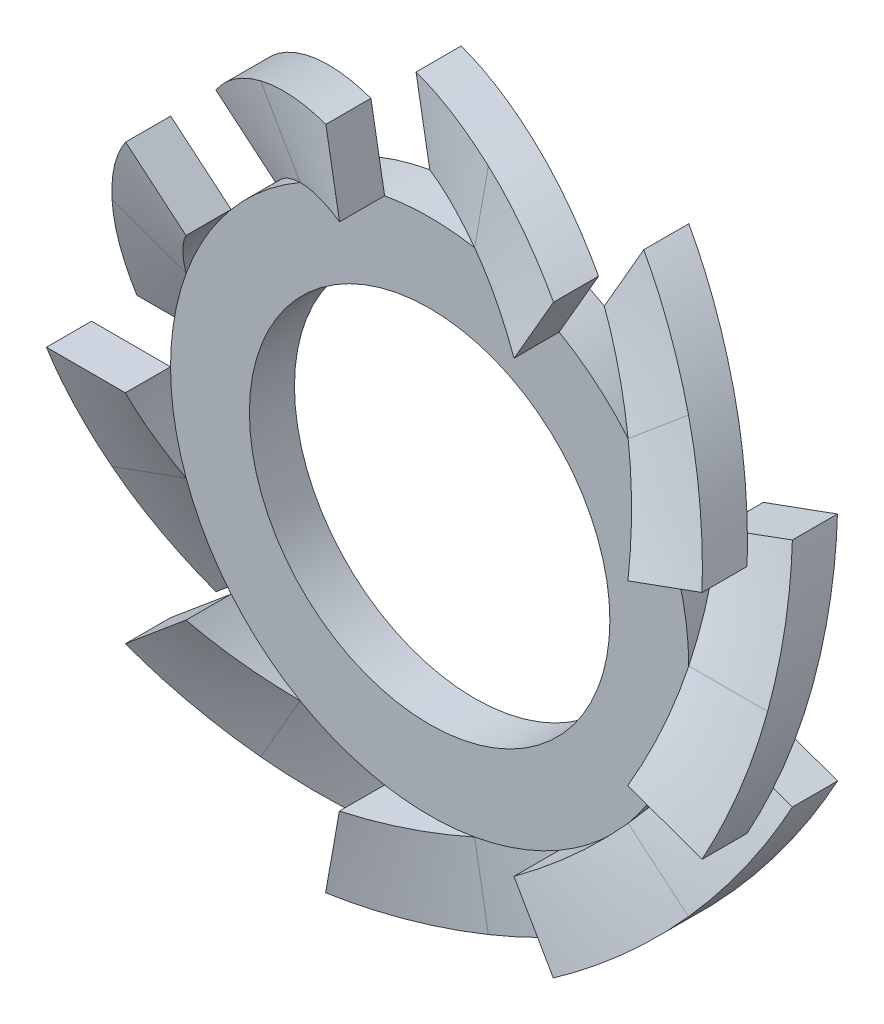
ISO-10303-21;
HEADER;
FILE_DESCRIPTION(('STEP AP214'),'2;1');
FILE_NAME('part.step','',(''),(''),'','','');
FILE_SCHEMA(('AUTOMOTIVE_DESIGN { 1 0 10303 214 1 1 1 1 }'));
ENDSEC;
DATA;
#1=APPLICATION_CONTEXT('core data for automotive mechanical design processes');
#2=APPLICATION_PROTOCOL_DEFINITION('international standard','automotive_design',2000,#1);
#3=PRODUCT_CONTEXT('',#1,'mechanical');
#4=PRODUCT('Part','Part','',(#3));
#5=PRODUCT_RELATED_PRODUCT_CATEGORY('part','',(#4));
#6=PRODUCT_DEFINITION_FORMATION('','',#4);
#7=PRODUCT_DEFINITION_CONTEXT('part definition',#1,'design');
#8=PRODUCT_DEFINITION('design','',#6,#7);
#9=PRODUCT_DEFINITION_SHAPE('','',#8);
#10=(LENGTH_UNIT() NAMED_UNIT(*) SI_UNIT(.MILLI.,.METRE.));
#11=(NAMED_UNIT(*) PLANE_ANGLE_UNIT() SI_UNIT($,.RADIAN.));
#12=(NAMED_UNIT(*) SI_UNIT($,.STERADIAN.) SOLID_ANGLE_UNIT());
#13=UNCERTAINTY_MEASURE_WITH_UNIT(LENGTH_MEASURE(1.E-05),#10,'distance_accuracy_value','');
#14=(GEOMETRIC_REPRESENTATION_CONTEXT(3) GLOBAL_UNCERTAINTY_ASSIGNED_CONTEXT((#13)) GLOBAL_UNIT_ASSIGNED_CONTEXT((#10,
#11,#12)) REPRESENTATION_CONTEXT('',''));
#15=CARTESIAN_POINT('',(0.,0.,0.));
#16=DIRECTION('',(0.,0.,1.));
#17=DIRECTION('',(1.,0.,0.));
#18=AXIS2_PLACEMENT_3D('',#15,#16,#17);
#19=CARTESIAN_POINT('',(0.,0.,0.2));
#20=DIRECTION('',(0.,0.,-1.));
#21=DIRECTION('',(-1.,0.,0.));
#22=AXIS2_PLACEMENT_3D('',#19,#20,#21);
#23=CYLINDRICAL_SURFACE('',#22,2.3);
#24=CARTESIAN_POINT('',(1.76190221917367,1.47841150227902,0.2));
#25=CARTESIAN_POINT('',(1.50093983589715,1.78941436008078,0.00113644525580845));
#26=CARTESIAN_POINT('',(1.14927200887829,1.99227855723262,-0.201248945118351));
#27=(BOUNDED_CURVE() B_SPLINE_CURVE(2,(#24,#25,#26),.UNSPECIFIED.,.F.,
.F.) B_SPLINE_CURVE_WITH_KNOTS((3,3),(0.,0.055556),
.UNSPECIFIED.) CURVE() GEOMETRIC_REPRESENTATION_ITEM() RATIONAL_B_SPLINE_CURVE((1.,
0.980499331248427,0.991333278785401)) REPRESENTATION_ITEM(''));
#28=CARTESIAN_POINT('',(1.76190221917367,1.47841150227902,0.2));
#29=VERTEX_POINT('',#28);
#30=CARTESIAN_POINT('',(1.15019854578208,1.99174373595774,-0.200182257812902));
#31=VERTEX_POINT('',#30);
#32=EDGE_CURVE('E45',#29,#31,#27,.T.);
#33=ORIENTED_EDGE('',*,*,#32,.T.);
#34=CARTESIAN_POINT('',(0.,0.,-0.2));
#35=DIRECTION('',(0.,0.,1.));
#36=DIRECTION('',(1.,0.,0.));
#37=AXIS2_PLACEMENT_3D('',#34,#35,#36);
#38=CIRCLE('',#37,2.3);
#39=CARTESIAN_POINT('',(0.399390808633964,2.26505783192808,-0.2));
#40=VERTEX_POINT('',#39);
#41=EDGE_CURVE('E88',#31,#40,#38,.T.);
#42=ORIENTED_EDGE('',*,*,#41,.T.);
#43=CARTESIAN_POINT('',(0.399390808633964,2.26505783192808,-0.2));
#44=CARTESIAN_POINT('',(0.799208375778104,2.19455920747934,-0.00113644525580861));
#45=CARTESIAN_POINT('',(1.15072783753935,1.99143803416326,0.201248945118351));
#46=(BOUNDED_CURVE() B_SPLINE_CURVE(2,(#43,#44,#45),.UNSPECIFIED.,.F.,
.F.) B_SPLINE_CURVE_WITH_KNOTS((3,3),(0.,0.055556),
.UNSPECIFIED.) CURVE() GEOMETRIC_REPRESENTATION_ITEM() RATIONAL_B_SPLINE_CURVE((1.,
0.980499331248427,0.991333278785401)) REPRESENTATION_ITEM(''));
#47=CARTESIAN_POINT('',(1.14980140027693,1.99197302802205,0.200182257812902));
#48=VERTEX_POINT('',#47);
#49=EDGE_CURVE('E537',#40,#48,#46,.T.);
#50=ORIENTED_EDGE('',*,*,#49,.T.);
#51=CARTESIAN_POINT('',(0.,0.,0.2));
#52=DIRECTION('',(0.,0.,1.));
#53=DIRECTION('',(1.,0.,0.));
#54=AXIS2_PLACEMENT_3D('',#51,#52,#53);
#55=CIRCLE('',#54,2.3);
#56=EDGE_CURVE('E36',#29,#48,#55,.T.);
#57=ORIENTED_EDGE('',*,*,#56,.F.);
#58=EDGE_LOOP('',(#33,#42,#50,#57));
#59=FACE_BOUND('',#58,.T.);
#60=ADVANCED_FACE('F26',(#59),#23,.T.);
#61=CARTESIAN_POINT('',(0.399390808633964,2.26505783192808,0.2));
#62=CARTESIAN_POINT('',(-0.000426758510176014,2.33555645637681,0.00113644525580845));
#63=CARTESIAN_POINT('',(-0.400218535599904,2.26491172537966,-0.201248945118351));
#64=(BOUNDED_CURVE() B_SPLINE_CURVE(2,(#61,#62,#63),.UNSPECIFIED.,.F.,
.F.) B_SPLINE_CURVE_WITH_KNOTS((3,3),(0.,0.055556),
.UNSPECIFIED.) CURVE() GEOMETRIC_REPRESENTATION_ITEM() RATIONAL_B_SPLINE_CURVE((1.,
0.980499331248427,0.991333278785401)) REPRESENTATION_ITEM(''));
#65=CARTESIAN_POINT('',(0.399390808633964,2.26505783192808,0.2));
#66=VERTEX_POINT('',#65);
#67=CARTESIAN_POINT('',(-0.399164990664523,2.26509759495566,-0.200182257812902));
#68=VERTEX_POINT('',#67);
#69=EDGE_CURVE('E633',#66,#68,#64,.T.);
#70=ORIENTED_EDGE('',*,*,#69,.T.);
#71=CARTESIAN_POINT('',(-1.14999999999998,1.99185842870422,-0.2));
#72=VERTEX_POINT('',#71);
#73=EDGE_CURVE('E624',#68,#72,#38,.T.);
#74=ORIENTED_EDGE('',*,*,#73,.T.);
#75=CARTESIAN_POINT('',(-1.14999999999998,1.99185842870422,-0.2));
#76=CARTESIAN_POINT('',(-0.798406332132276,2.19485112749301,-0.00113644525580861));
#77=CARTESIAN_POINT('',(-0.398563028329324,2.26520363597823,0.201248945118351));
#78=(BOUNDED_CURVE() B_SPLINE_CURVE(2,(#75,#76,#77),.UNSPECIFIED.,.F.,
.F.) B_SPLINE_CURVE_WITH_KNOTS((3,3),(0.,0.055556),
.UNSPECIFIED.) CURVE() GEOMETRIC_REPRESENTATION_ITEM() RATIONAL_B_SPLINE_CURVE((1.,
0.980499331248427,0.991333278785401)) REPRESENTATION_ITEM(''));
#79=CARTESIAN_POINT('',(-0.399616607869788,2.26501796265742,0.200182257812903));
#80=VERTEX_POINT('',#79);
#81=EDGE_CURVE('E383',#72,#80,#78,.T.);
#82=ORIENTED_EDGE('',*,*,#81,.T.);
#83=EDGE_CURVE('E393',#66,#80,#55,.T.);
#84=ORIENTED_EDGE('',*,*,#83,.F.);
#85=EDGE_LOOP('',(#70,#74,#82,#84));
#86=FACE_BOUND('',#85,.T.);
#87=ADVANCED_FACE('F814',(#86),#23,.T.);
#88=CARTESIAN_POINT('',(-1.14999999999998,1.99185842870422,0.2));
#89=CARTESIAN_POINT('',(-1.50159366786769,1.78886572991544,0.00113644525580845));
#90=CARTESIAN_POINT('',(-1.76244237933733,1.4777675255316,-0.201248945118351));
#91=(BOUNDED_CURVE() B_SPLINE_CURVE(2,(#88,#89,#90),.UNSPECIFIED.,.F.,
.F.) B_SPLINE_CURVE_WITH_KNOTS((3,3),(0.,0.055556),
.UNSPECIFIED.) CURVE() GEOMETRIC_REPRESENTATION_ITEM() RATIONAL_B_SPLINE_CURVE((1.,
0.980499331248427,0.991333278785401)) REPRESENTATION_ITEM(''));
#92=CARTESIAN_POINT('',(-1.14999999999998,1.99185842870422,0.2));
#93=VERTEX_POINT('',#92);
#94=CARTESIAN_POINT('',(-1.76175479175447,1.47858711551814,-0.200182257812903));
#95=VERTEX_POINT('',#94);
#96=EDGE_CURVE('E353',#93,#95,#91,.T.);
#97=ORIENTED_EDGE('',*,*,#96,.T.);
#98=CARTESIAN_POINT('',(-2.16129302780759,0.786646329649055,-0.2));
#99=VERTEX_POINT('',#98);
#100=EDGE_CURVE('E620',#95,#99,#38,.T.);
#101=ORIENTED_EDGE('',*,*,#100,.T.);
#102=CARTESIAN_POINT('',(-2.16129302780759,0.786646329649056,-0.2));
#103=CARTESIAN_POINT('',(-2.02243784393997,1.16814781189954,-0.00113644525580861));
#104=CARTESIAN_POINT('',(-1.76136182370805,1.47905528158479,0.201248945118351));
#105=(BOUNDED_CURVE() B_SPLINE_CURVE(2,(#102,#103,#104),.UNSPECIFIED.,.F.,
.F.) B_SPLINE_CURVE_WITH_KNOTS((3,3),(0.,0.055556),
.UNSPECIFIED.) CURVE() GEOMETRIC_REPRESENTATION_ITEM() RATIONAL_B_SPLINE_CURVE((1.,
0.980499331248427,0.991333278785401)) REPRESENTATION_ITEM(''));
#106=CARTESIAN_POINT('',(-1.76204956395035,1.47823581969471,0.200182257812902));
#107=VERTEX_POINT('',#106);
#108=EDGE_CURVE('E389',#99,#107,#105,.T.);
#109=ORIENTED_EDGE('',*,*,#108,.T.);
#110=EDGE_CURVE('E386',#93,#107,#55,.T.);
#111=ORIENTED_EDGE('',*,*,#110,.F.);
#112=EDGE_LOOP('',(#97,#101,#109,#111));
#113=FACE_BOUND('',#112,.T.);
#114=ADVANCED_FACE('F387',(#113),#23,.T.);
#115=CARTESIAN_POINT('',(-2.16129302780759,0.786646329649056,0.2));
#116=CARTESIAN_POINT('',(-2.3001482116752,0.405144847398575,0.00113644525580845));
#117=CARTESIAN_POINT('',(-2.2999998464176,-0.000840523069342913,-0.201248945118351));
#118=(BOUNDED_CURVE() B_SPLINE_CURVE(2,(#115,#116,#117),.UNSPECIFIED.,.F.,
.F.) B_SPLINE_CURVE_WITH_KNOTS((3,3),(0.,0.055556),
.UNSPECIFIED.) CURVE() GEOMETRIC_REPRESENTATION_ITEM() RATIONAL_B_SPLINE_CURVE((1.,
0.980499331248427,0.991333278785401)) REPRESENTATION_ITEM(''));
#119=CARTESIAN_POINT('',(-2.16129302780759,0.786646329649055,0.2));
#120=VERTEX_POINT('',#119);
#121=CARTESIAN_POINT('',(-2.29999994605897,0.000229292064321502,-0.200182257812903));
#122=VERTEX_POINT('',#121);
#123=EDGE_CURVE('E1228',#120,#122,#118,.T.);
#124=ORIENTED_EDGE('',*,*,#123,.T.);
#125=CARTESIAN_POINT('',(-2.1612930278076,-0.786646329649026,-0.2));
#126=VERTEX_POINT('',#125);
#127=EDGE_CURVE('E616',#122,#126,#38,.T.);
#128=ORIENTED_EDGE('',*,*,#127,.T.);
#129=CARTESIAN_POINT('',(-2.1612930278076,-0.786646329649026,-0.2));
#130=CARTESIAN_POINT('',(-2.30014821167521,-0.405144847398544,-0.00113644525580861));
#131=CARTESIAN_POINT('',(-2.2999998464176,0.000840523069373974,0.201248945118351));
#132=(BOUNDED_CURVE() B_SPLINE_CURVE(2,(#129,#130,#131),.UNSPECIFIED.,.F.,
.F.) B_SPLINE_CURVE_WITH_KNOTS((3,3),(0.,0.055556),
.UNSPECIFIED.) CURVE() GEOMETRIC_REPRESENTATION_ITEM() RATIONAL_B_SPLINE_CURVE((1.,
0.980499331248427,0.991333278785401)) REPRESENTATION_ITEM(''));
#133=CARTESIAN_POINT('',(-2.29999994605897,-0.000229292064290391,0.200182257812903));
#134=VERTEX_POINT('',#133);
#135=EDGE_CURVE('E1864',#126,#134,#132,.T.);
#136=ORIENTED_EDGE('',*,*,#135,.T.);
#137=EDGE_CURVE('E394',#120,#134,#55,.T.);
#138=ORIENTED_EDGE('',*,*,#137,.F.);
#139=EDGE_LOOP('',(#124,#128,#136,#138));
#140=FACE_BOUND('',#139,.T.);
#141=ADVANCED_FACE('F1759',(#140),#23,.T.);
#142=CARTESIAN_POINT('',(-2.1612930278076,-0.786646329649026,0.2));
#143=CARTESIAN_POINT('',(-2.02243784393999,-1.16814781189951,0.00113644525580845));
#144=CARTESIAN_POINT('',(-1.76136182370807,-1.47905528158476,-0.201248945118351));
#145=(BOUNDED_CURVE() B_SPLINE_CURVE(2,(#142,#143,#144),.UNSPECIFIED.,.F.,
.F.) B_SPLINE_CURVE_WITH_KNOTS((3,3),(0.,0.055556),
.UNSPECIFIED.) CURVE() GEOMETRIC_REPRESENTATION_ITEM() RATIONAL_B_SPLINE_CURVE((1.,
0.980499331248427,0.991333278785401)) REPRESENTATION_ITEM(''));
#146=CARTESIAN_POINT('',(-2.1612930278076,-0.786646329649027,0.2));
#147=VERTEX_POINT('',#146);
#148=CARTESIAN_POINT('',(-1.76204956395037,-1.47823581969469,-0.200182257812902));
#149=VERTEX_POINT('',#148);
#150=EDGE_CURVE('E1157',#147,#149,#145,.T.);
#151=ORIENTED_EDGE('',*,*,#150,.T.);
#152=CARTESIAN_POINT('',(-1.15000000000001,-1.99185842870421,-0.2));
#153=VERTEX_POINT('',#152);
#154=EDGE_CURVE('E611',#149,#153,#38,.T.);
#155=ORIENTED_EDGE('',*,*,#154,.T.);
#156=CARTESIAN_POINT('',(-1.15000000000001,-1.99185842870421,-0.2));
#157=CARTESIAN_POINT('',(-1.50159366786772,-1.78886572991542,-0.00113644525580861));
#158=CARTESIAN_POINT('',(-1.76244237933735,-1.47776752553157,0.201248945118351));
#159=(BOUNDED_CURVE() B_SPLINE_CURVE(2,(#156,#157,#158),.UNSPECIFIED.,.F.,
.F.) B_SPLINE_CURVE_WITH_KNOTS((3,3),(0.,0.055556),
.UNSPECIFIED.) CURVE() GEOMETRIC_REPRESENTATION_ITEM() RATIONAL_B_SPLINE_CURVE((1.,
0.980499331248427,0.991333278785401)) REPRESENTATION_ITEM(''));
#160=CARTESIAN_POINT('',(-1.76175479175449,-1.47858711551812,0.200182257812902));
#161=VERTEX_POINT('',#160);
#162=EDGE_CURVE('E1917',#153,#161,#159,.T.);
#163=ORIENTED_EDGE('',*,*,#162,.T.);
#164=EDGE_CURVE('E482',#147,#161,#55,.T.);
#165=ORIENTED_EDGE('',*,*,#164,.F.);
#166=EDGE_LOOP('',(#151,#155,#163,#165));
#167=FACE_BOUND('',#166,.T.);
#168=ADVANCED_FACE('F1014',(#167),#23,.T.);
#169=CARTESIAN_POINT('',(-1.15000000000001,-1.99185842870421,0.2));
#170=CARTESIAN_POINT('',(-0.798406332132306,-2.194851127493,0.00113644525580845));
#171=CARTESIAN_POINT('',(-0.398563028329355,-2.26520363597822,-0.201248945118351));
#172=(BOUNDED_CURVE() B_SPLINE_CURVE(2,(#169,#170,#171),.UNSPECIFIED.,.F.,
.F.) B_SPLINE_CURVE_WITH_KNOTS((3,3),(0.,0.055556),
.UNSPECIFIED.) CURVE() GEOMETRIC_REPRESENTATION_ITEM() RATIONAL_B_SPLINE_CURVE((1.,
0.980499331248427,0.991333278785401)) REPRESENTATION_ITEM(''));
#173=CARTESIAN_POINT('',(-1.15000000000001,-1.99185842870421,0.2));
#174=VERTEX_POINT('',#173);
#175=CARTESIAN_POINT('',(-0.39961660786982,-2.26501796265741,-0.200182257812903));
#176=VERTEX_POINT('',#175);
#177=EDGE_CURVE('E1086',#174,#176,#172,.T.);
#178=ORIENTED_EDGE('',*,*,#177,.T.);
#179=CARTESIAN_POINT('',(0.399390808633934,-2.26505783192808,-0.2));
#180=VERTEX_POINT('',#179);
#181=EDGE_CURVE('E606',#176,#180,#38,.T.);
#182=ORIENTED_EDGE('',*,*,#181,.T.);
#183=CARTESIAN_POINT('',(0.399390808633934,-2.26505783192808,-0.2));
#184=CARTESIAN_POINT('',(-0.000426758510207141,-2.33555645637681,-0.00113644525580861));
#185=CARTESIAN_POINT('',(-0.400218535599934,-2.26491172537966,0.201248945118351));
#186=(BOUNDED_CURVE() B_SPLINE_CURVE(2,(#183,#184,#185),.UNSPECIFIED.,.F.,
.F.) B_SPLINE_CURVE_WITH_KNOTS((3,3),(0.,0.055556),
.UNSPECIFIED.) CURVE() GEOMETRIC_REPRESENTATION_ITEM() RATIONAL_B_SPLINE_CURVE((1.,
0.980499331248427,0.991333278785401)) REPRESENTATION_ITEM(''));
#187=CARTESIAN_POINT('',(-0.399164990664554,-2.26509759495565,0.200182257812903));
#188=VERTEX_POINT('',#187);
#189=EDGE_CURVE('E1975',#180,#188,#186,.T.);
#190=ORIENTED_EDGE('',*,*,#189,.T.);
#191=EDGE_CURVE('E477',#174,#188,#55,.T.);
#192=ORIENTED_EDGE('',*,*,#191,.F.);
#193=EDGE_LOOP('',(#178,#182,#190,#192));
#194=FACE_BOUND('',#193,.T.);
#195=ADVANCED_FACE('F1010',(#194),#23,.T.);
#196=CARTESIAN_POINT('',(0.399390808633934,-2.26505783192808,0.2));
#197=CARTESIAN_POINT('',(0.799208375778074,-2.19455920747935,0.00113644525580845));
#198=CARTESIAN_POINT('',(1.15072783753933,-1.99143803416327,-0.201248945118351));
#199=(BOUNDED_CURVE() B_SPLINE_CURVE(2,(#196,#197,#198),.UNSPECIFIED.,.F.,
.F.) B_SPLINE_CURVE_WITH_KNOTS((3,3),(0.,0.055556),
.UNSPECIFIED.) CURVE() GEOMETRIC_REPRESENTATION_ITEM() RATIONAL_B_SPLINE_CURVE((1.,
0.980499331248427,0.991333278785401)) REPRESENTATION_ITEM(''));
#200=CARTESIAN_POINT('',(0.399390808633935,-2.26505783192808,0.2));
#201=VERTEX_POINT('',#200);
#202=CARTESIAN_POINT('',(1.1498014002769,-1.99197302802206,-0.200182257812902));
#203=VERTEX_POINT('',#202);
#204=EDGE_CURVE('E1016',#201,#203,#199,.T.);
#205=ORIENTED_EDGE('',*,*,#204,.T.);
#206=CARTESIAN_POINT('',(1.76190221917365,-1.47841150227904,-0.2));
#207=VERTEX_POINT('',#206);
#208=EDGE_CURVE('E601',#203,#207,#38,.T.);
#209=ORIENTED_EDGE('',*,*,#208,.T.);
#210=CARTESIAN_POINT('',(1.76190221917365,-1.47841150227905,-0.2));
#211=CARTESIAN_POINT('',(1.50093983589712,-1.7894143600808,-0.00113644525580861));
#212=CARTESIAN_POINT('',(1.14927200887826,-1.99227855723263,0.201248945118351));
#213=(BOUNDED_CURVE() B_SPLINE_CURVE(2,(#210,#211,#212),.UNSPECIFIED.,.F.,
.F.) B_SPLINE_CURVE_WITH_KNOTS((3,3),(0.,0.055556),
.UNSPECIFIED.) CURVE() GEOMETRIC_REPRESENTATION_ITEM() RATIONAL_B_SPLINE_CURVE((1.,
0.980499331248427,0.991333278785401)) REPRESENTATION_ITEM(''));
#214=CARTESIAN_POINT('',(1.15019854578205,-1.99174373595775,0.200182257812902));
#215=VERTEX_POINT('',#214);
#216=EDGE_CURVE('E2262',#207,#215,#213,.T.);
#217=ORIENTED_EDGE('',*,*,#216,.T.);
#218=EDGE_CURVE('E472',#201,#215,#55,.T.);
#219=ORIENTED_EDGE('',*,*,#218,.F.);
#220=EDGE_LOOP('',(#205,#209,#217,#219));
#221=FACE_BOUND('',#220,.T.);
#222=ADVANCED_FACE('F1006',(#221),#23,.T.);
#223=CARTESIAN_POINT('',(1.76190221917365,-1.47841150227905,0.2));
#224=CARTESIAN_POINT('',(2.02286460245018,-1.1674086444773,0.00113644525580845));
#225=CARTESIAN_POINT('',(2.16158035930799,-0.785856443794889,-0.201248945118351));
#226=(BOUNDED_CURVE() B_SPLINE_CURVE(2,(#223,#224,#225),.UNSPECIFIED.,.F.,
.F.) B_SPLINE_CURVE_WITH_KNOTS((3,3),(0.,0.055556),
.UNSPECIFIED.) CURVE() GEOMETRIC_REPRESENTATION_ITEM() RATIONAL_B_SPLINE_CURVE((1.,
0.980499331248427,0.991333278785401)) REPRESENTATION_ITEM(''));
#227=CARTESIAN_POINT('',(1.76190221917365,-1.47841150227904,0.2));
#228=VERTEX_POINT('',#227);
#229=CARTESIAN_POINT('',(2.1612145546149,-0.786861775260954,-0.200182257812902));
#230=VERTEX_POINT('',#229);
#231=EDGE_CURVE('E881',#228,#230,#226,.T.);
#232=ORIENTED_EDGE('',*,*,#231,.T.);
#233=CARTESIAN_POINT('',(2.3,0.,-0.2));
#234=VERTEX_POINT('',#233);
#235=EDGE_CURVE('E454',#230,#234,#38,.T.);
#236=ORIENTED_EDGE('',*,*,#235,.T.);
#237=CARTESIAN_POINT('',(2.3,0.,-0.2));
#238=CARTESIAN_POINT('',(2.3,-0.405985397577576,-0.00113644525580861));
#239=CARTESIAN_POINT('',(2.16100540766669,-0.787436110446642,0.201248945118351));
#240=(BOUNDED_CURVE() B_SPLINE_CURVE(2,(#237,#238,#239),.UNSPECIFIED.,.F.,
.F.) B_SPLINE_CURVE_WITH_KNOTS((3,3),(0.,0.055556),
.UNSPECIFIED.) CURVE() GEOMETRIC_REPRESENTATION_ITEM() RATIONAL_B_SPLINE_CURVE((1.,
0.980499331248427,0.991333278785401)) REPRESENTATION_ITEM(''));
#241=CARTESIAN_POINT('',(2.1613713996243,-0.786430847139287,0.200182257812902));
#242=VERTEX_POINT('',#241);
#243=EDGE_CURVE('E880',#234,#242,#240,.T.);
#244=ORIENTED_EDGE('',*,*,#243,.T.);
#245=EDGE_CURVE('E467',#228,#242,#55,.T.);
#246=ORIENTED_EDGE('',*,*,#245,.F.);
#247=EDGE_LOOP('',(#232,#236,#244,#246));
#248=FACE_BOUND('',#247,.T.);
#249=ADVANCED_FACE('F877',(#248),#23,.T.);
#250=CARTESIAN_POINT('',(2.1613713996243,0.786430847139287,-0.200182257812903));
#251=VERTEX_POINT('',#250);
#252=CARTESIAN_POINT('',(1.76190221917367,1.47841150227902,-0.2));
#253=VERTEX_POINT('',#252);
#254=EDGE_CURVE('E561',#251,#253,#38,.T.);
#255=ORIENTED_EDGE('',*,*,#254,.T.);
#256=CARTESIAN_POINT('',(1.76190221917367,1.47841150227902,-0.2));
#257=CARTESIAN_POINT('',(2.0228646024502,1.16740864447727,-0.00113644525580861));
#258=CARTESIAN_POINT('',(2.161580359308,0.78585644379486,0.201248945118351));
#259=(BOUNDED_CURVE() B_SPLINE_CURVE(2,(#256,#257,#258),.UNSPECIFIED.,.F.,
.F.) B_SPLINE_CURVE_WITH_KNOTS((3,3),(0.,0.055556),
.UNSPECIFIED.) CURVE() GEOMETRIC_REPRESENTATION_ITEM() RATIONAL_B_SPLINE_CURVE((1.,
0.980499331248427,0.991333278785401)) REPRESENTATION_ITEM(''));
#260=CARTESIAN_POINT('',(2.16121455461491,0.786861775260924,0.200182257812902));
#261=VERTEX_POINT('',#260);
#262=EDGE_CURVE('E918',#253,#261,#259,.T.);
#263=ORIENTED_EDGE('',*,*,#262,.T.);
#264=CARTESIAN_POINT('',(2.3,0.,0.2));
#265=VERTEX_POINT('',#264);
#266=EDGE_CURVE('E11',#265,#261,#55,.T.);
#267=ORIENTED_EDGE('',*,*,#266,.F.);
#268=CARTESIAN_POINT('',(2.3,0.,0.2));
#269=CARTESIAN_POINT('',(2.3,0.405985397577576,0.00113644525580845));
#270=CARTESIAN_POINT('',(2.16100540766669,0.787436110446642,-0.201248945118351));
#271=(BOUNDED_CURVE() B_SPLINE_CURVE(2,(#268,#269,#270),.UNSPECIFIED.,.F.,
.F.) B_SPLINE_CURVE_WITH_KNOTS((3,3),(0.,0.055556),
.UNSPECIFIED.) CURVE() GEOMETRIC_REPRESENTATION_ITEM() RATIONAL_B_SPLINE_CURVE((1.,
0.980499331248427,0.991333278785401)) REPRESENTATION_ITEM(''));
#272=EDGE_CURVE('E919',#265,#251,#271,.T.);
#273=ORIENTED_EDGE('',*,*,#272,.T.);
#274=EDGE_LOOP('',(#255,#263,#267,#273));
#275=FACE_BOUND('',#274,.T.);
#276=ADVANCED_FACE('F28',(#275),#23,.T.);
#277=CARTESIAN_POINT('',(0.,0.,0.2));
#278=DIRECTION('',(0.,0.,1.));
#279=DIRECTION('',(1.,0.,0.));
#280=AXIS2_PLACEMENT_3D('',#277,#278,#279);
#281=PLANE('',#280);
#282=ORIENTED_EDGE('',*,*,#266,.T.);
#283=CARTESIAN_POINT('',(0.,0.,0.2));
#284=DIRECTION('',(0.,0.,1.));
#285=DIRECTION('',(1.,0.,0.));
#286=AXIS2_PLACEMENT_3D('',#283,#284,#285);
#287=CIRCLE('',#286,2.29999999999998);
#288=EDGE_CURVE('E556',#29,#261,#287,.F.);
#289=ORIENTED_EDGE('',*,*,#288,.F.);
#290=ORIENTED_EDGE('',*,*,#56,.T.);
#291=CARTESIAN_POINT('',(0.,0.,0.2));
#292=DIRECTION('',(0.,0.,1.));
#293=DIRECTION('',(1.,0.,0.));
#294=AXIS2_PLACEMENT_3D('',#291,#292,#293);
#295=CIRCLE('',#294,2.29999999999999);
#296=EDGE_CURVE('E499',#66,#48,#295,.F.);
#297=ORIENTED_EDGE('',*,*,#296,.F.);
#298=ORIENTED_EDGE('',*,*,#83,.T.);
#299=CARTESIAN_POINT('',(0.,0.,0.2));
#300=DIRECTION('',(0.,0.,1.));
#301=DIRECTION('',(1.,0.,0.));
#302=AXIS2_PLACEMENT_3D('',#299,#300,#301);
#303=CIRCLE('',#302,2.29999999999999);
#304=EDGE_CURVE('E380',#93,#80,#303,.F.);
#305=ORIENTED_EDGE('',*,*,#304,.F.);
#306=ORIENTED_EDGE('',*,*,#110,.T.);
#307=CARTESIAN_POINT('',(0.,0.,0.2));
#308=DIRECTION('',(0.,0.,1.));
#309=DIRECTION('',(1.,0.,0.));
#310=AXIS2_PLACEMENT_3D('',#307,#308,#309);
#311=CIRCLE('',#310,2.29999999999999);
#312=EDGE_CURVE('E414',#120,#107,#311,.F.);
#313=ORIENTED_EDGE('',*,*,#312,.F.);
#314=ORIENTED_EDGE('',*,*,#137,.T.);
#315=CARTESIAN_POINT('',(0.,0.,0.2));
#316=DIRECTION('',(0.,0.,1.));
#317=DIRECTION('',(1.,0.,0.));
#318=AXIS2_PLACEMENT_3D('',#315,#316,#317);
#319=CIRCLE('',#318,2.29999999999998);
#320=EDGE_CURVE('E420',#147,#134,#319,.F.);
#321=ORIENTED_EDGE('',*,*,#320,.F.);
#322=ORIENTED_EDGE('',*,*,#164,.T.);
#323=CARTESIAN_POINT('',(0.,0.,0.2));
#324=DIRECTION('',(0.,0.,1.));
#325=DIRECTION('',(1.,0.,0.));
#326=AXIS2_PLACEMENT_3D('',#323,#324,#325);
#327=CIRCLE('',#326,2.29999999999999);
#328=EDGE_CURVE('E427',#174,#161,#327,.F.);
#329=ORIENTED_EDGE('',*,*,#328,.F.);
#330=ORIENTED_EDGE('',*,*,#191,.T.);
#331=CARTESIAN_POINT('',(0.,0.,0.2));
#332=DIRECTION('',(0.,0.,1.));
#333=DIRECTION('',(1.,0.,0.));
#334=AXIS2_PLACEMENT_3D('',#331,#332,#333);
#335=CIRCLE('',#334,2.29999999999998);
#336=EDGE_CURVE('E434',#201,#188,#335,.F.);
#337=ORIENTED_EDGE('',*,*,#336,.F.);
#338=ORIENTED_EDGE('',*,*,#218,.T.);
#339=CARTESIAN_POINT('',(0.,0.,0.2));
#340=DIRECTION('',(0.,0.,1.));
#341=DIRECTION('',(1.,0.,0.));
#342=AXIS2_PLACEMENT_3D('',#339,#340,#341);
#343=CIRCLE('',#342,2.29999999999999);
#344=EDGE_CURVE('E441',#228,#215,#343,.F.);
#345=ORIENTED_EDGE('',*,*,#344,.F.);
#346=ORIENTED_EDGE('',*,*,#245,.T.);
#347=EDGE_CURVE('E458',#242,#265,#55,.T.);
#348=ORIENTED_EDGE('',*,*,#347,.T.);
#349=EDGE_LOOP('',(#282,#289,#290,#297,#298,#305,#306,#313,#314,#321,#322,#329,#330,#337,#338,
#345,#346,#348));
#350=FACE_BOUND('',#349,.T.);
#351=CARTESIAN_POINT('',(0.,0.,0.2));
#352=DIRECTION('',(0.,0.,1.));
#353=DIRECTION('',(1.,0.,0.));
#354=AXIS2_PLACEMENT_3D('',#351,#352,#353);
#355=CIRCLE('',#354,1.6);
#356=CARTESIAN_POINT('',(1.6,0.,0.2));
#357=VERTEX_POINT('',#356);
#358=EDGE_CURVE('E451',#357,#357,#355,.T.);
#359=ORIENTED_EDGE('',*,*,#358,.F.);
#360=EDGE_LOOP('',(#359));
#361=FACE_BOUND('',#360,.T.);
#362=ADVANCED_FACE('F396',(#350,#361),#281,.T.);
#363=CARTESIAN_POINT('',(0.,0.,-0.2));
#364=DIRECTION('',(0.,0.,1.));
#365=DIRECTION('',(1.,0.,0.));
#366=AXIS2_PLACEMENT_3D('',#363,#364,#365);
#367=PLANE('',#366);
#368=EDGE_CURVE('E565',#234,#251,#38,.T.);
#369=ORIENTED_EDGE('',*,*,#368,.F.);
#370=ORIENTED_EDGE('',*,*,#235,.F.);
#371=EDGE_CURVE('E576',#207,#230,#38,.T.);
#372=ORIENTED_EDGE('',*,*,#371,.F.);
#373=ORIENTED_EDGE('',*,*,#208,.F.);
#374=EDGE_CURVE('E579',#180,#203,#38,.T.);
#375=ORIENTED_EDGE('',*,*,#374,.F.);
#376=ORIENTED_EDGE('',*,*,#181,.F.);
#377=EDGE_CURVE('E582',#153,#176,#38,.T.);
#378=ORIENTED_EDGE('',*,*,#377,.F.);
#379=ORIENTED_EDGE('',*,*,#154,.F.);
#380=EDGE_CURVE('E585',#126,#149,#38,.T.);
#381=ORIENTED_EDGE('',*,*,#380,.F.);
#382=ORIENTED_EDGE('',*,*,#127,.F.);
#383=EDGE_CURVE('E588',#99,#122,#38,.T.);
#384=ORIENTED_EDGE('',*,*,#383,.F.);
#385=ORIENTED_EDGE('',*,*,#100,.F.);
#386=EDGE_CURVE('E591',#72,#95,#38,.T.);
#387=ORIENTED_EDGE('',*,*,#386,.F.);
#388=ORIENTED_EDGE('',*,*,#73,.F.);
#389=EDGE_CURVE('E493',#40,#68,#38,.T.);
#390=ORIENTED_EDGE('',*,*,#389,.F.);
#391=ORIENTED_EDGE('',*,*,#41,.F.);
#392=EDGE_CURVE('E559',#253,#31,#38,.T.);
#393=ORIENTED_EDGE('',*,*,#392,.F.);
#394=ORIENTED_EDGE('',*,*,#254,.F.);
#395=EDGE_LOOP('',(#369,#370,#372,#373,#375,#376,#378,#379,#381,#382,#384,#385,#387,#388,#390,
#391,#393,#394));
#396=FACE_BOUND('',#395,.T.);
#397=CARTESIAN_POINT('',(0.,0.,-0.2));
#398=DIRECTION('',(0.,0.,1.));
#399=DIRECTION('',(1.,0.,0.));
#400=AXIS2_PLACEMENT_3D('',#397,#398,#399);
#401=CIRCLE('',#400,1.6);
#402=CARTESIAN_POINT('',(1.6,0.,-0.2));
#403=VERTEX_POINT('',#402);
#404=EDGE_CURVE('E448',#403,#403,#401,.T.);
#405=ORIENTED_EDGE('',*,*,#404,.T.);
#406=EDGE_LOOP('',(#405));
#407=FACE_BOUND('',#406,.T.);
#408=ADVANCED_FACE('F820',(#396,#407),#367,.F.);
#409=CARTESIAN_POINT('',(0.,0.,0.2));
#410=DIRECTION('',(0.,0.,-1.));
#411=DIRECTION('',(-1.,0.,0.));
#412=AXIS2_PLACEMENT_3D('',#409,#410,#411);
#413=CYLINDRICAL_SURFACE('',#412,1.6);
#414=ORIENTED_EDGE('',*,*,#358,.T.);
#415=EDGE_LOOP('',(#414));
#416=FACE_BOUND('',#415,.T.);
#417=ORIENTED_EDGE('',*,*,#404,.F.);
#418=EDGE_LOOP('',(#417));
#419=FACE_BOUND('',#418,.T.);
#420=ADVANCED_FACE('F1783',(#416,#419),#413,.F.);
#421=CARTESIAN_POINT('',(2.48985405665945,-0.907263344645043,0.201248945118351));
#422=DIRECTION('',(0.342363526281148,0.939567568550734,0.));
#423=DIRECTION('',(-0.939567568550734,0.342363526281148,0.));
#424=AXIS2_PLACEMENT_3D('',#421,#422,#423);
#425=PLANE('',#424);
#426=DIRECTION('',(0.939567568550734,-0.342363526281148,0.));
#427=VECTOR('',#426,1.);
#428=CARTESIAN_POINT('',(2.16100540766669,-0.787436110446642,0.201248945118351));
#429=LINE('',#428,#427);
#430=CARTESIAN_POINT('',(2.8187027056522,-1.02709057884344,0.201248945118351));
#431=VERTEX_POINT('',#430);
#432=EDGE_CURVE('E452',#242,#431,#429,.T.);
#433=ORIENTED_EDGE('',*,*,#432,.T.);
#434=DIRECTION('',(0.,0.,1.));
#435=VECTOR('',#434,1.);
#436=CARTESIAN_POINT('',(2.8187027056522,-1.02709057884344,0.401248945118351));
#437=LINE('',#436,#435);
#438=CARTESIAN_POINT('',(2.8187027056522,-1.02709057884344,0.601248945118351));
#439=VERTEX_POINT('',#438);
#440=EDGE_CURVE('E1845',#431,#439,#437,.T.);
#441=ORIENTED_EDGE('',*,*,#440,.T.);
#442=DIRECTION('',(-0.939567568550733,0.342363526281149,0.));
#443=VECTOR('',#442,1.);
#444=CARTESIAN_POINT('',(2.48985405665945,-0.907263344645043,0.601248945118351));
#445=LINE('',#444,#443);
#446=CARTESIAN_POINT('',(2.16100540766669,-0.787436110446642,0.601248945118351));
#447=VERTEX_POINT('',#446);
#448=EDGE_CURVE('E1847',#439,#447,#445,.T.);
#449=ORIENTED_EDGE('',*,*,#448,.T.);
#450=DIRECTION('',(0.,0.,-1.));
#451=VECTOR('',#450,1.);
#452=CARTESIAN_POINT('',(2.16100540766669,-0.787436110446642,0.401248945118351));
#453=LINE('',#452,#451);
#454=EDGE_CURVE('E909',#447,#242,#453,.T.);
#455=ORIENTED_EDGE('',*,*,#454,.T.);
#456=EDGE_LOOP('',(#433,#441,#449,#455));
#457=FACE_BOUND('',#456,.T.);
#458=ADVANCED_FACE('F991',(#457),#425,.F.);
#459=CARTESIAN_POINT('',(2.3,0.,-0.2));
#460=CARTESIAN_POINT('',(2.3,-0.405985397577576,-0.00113644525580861));
#461=CARTESIAN_POINT('',(2.16100540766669,-0.787436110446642,0.201248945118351));
#462=CARTESIAN_POINT('',(2.53333333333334,0.,-0.2));
#463=CARTESIAN_POINT('',(2.53333333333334,-0.447172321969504,-0.00113644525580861));
#464=CARTESIAN_POINT('',(2.38023784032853,-0.867320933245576,0.201248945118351));
#465=CARTESIAN_POINT('',(2.76666666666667,0.,-0.2));
#466=CARTESIAN_POINT('',(2.76666666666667,-0.488359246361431,-0.00113644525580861));
#467=CARTESIAN_POINT('',(2.59947027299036,-0.94720575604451,0.201248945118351));
#468=CARTESIAN_POINT('',(3.,0.,-0.2));
#469=CARTESIAN_POINT('',(3.,-0.529546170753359,-0.00113644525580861));
#470=CARTESIAN_POINT('',(2.8187027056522,-1.02709057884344,0.201248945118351));
#471=(BOUNDED_SURFACE() B_SPLINE_SURFACE(3,2,((#459,#460,#461),(#462,#463,#464),(#465,#466,
#467),(#468,#469,#470)),.UNSPECIFIED.,.F.,.F.,.F.) B_SPLINE_SURFACE_WITH_KNOTS((4,4),(3,3),(0.,
0.318181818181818),(0.,0.055556),
.UNSPECIFIED.) GEOMETRIC_REPRESENTATION_ITEM() RATIONAL_B_SPLINE_SURFACE(((1.,0.980499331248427,
0.991333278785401),(1.,0.980499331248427,0.991333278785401),(1.,0.980499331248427,
0.991333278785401),(1.,0.980499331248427,0.991333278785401))) REPRESENTATION_ITEM('') SURFACE());
#472=DIRECTION('',(1.,0.,0.));
#473=VECTOR('',#472,1.);
#474=CARTESIAN_POINT('',(2.65,0.,-0.2));
#475=LINE('',#474,#473);
#476=CARTESIAN_POINT('',(3.,0.,-0.2));
#477=VERTEX_POINT('',#476);
#478=EDGE_CURVE('E885',#234,#477,#475,.T.);
#479=CARTESIAN_POINT('',(3.,0.,-0.2));
#480=CARTESIAN_POINT('',(3.,-0.529546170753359,-0.00113644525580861));
#481=CARTESIAN_POINT('',(2.8187027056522,-1.02709057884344,0.201248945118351));
#482=(BOUNDED_CURVE() B_SPLINE_CURVE(2,(#479,#480,#481),.UNSPECIFIED.,.F.,
.F.) B_SPLINE_CURVE_WITH_KNOTS((3,3),(0.,0.055556),
.UNSPECIFIED.) CURVE() GEOMETRIC_REPRESENTATION_ITEM() RATIONAL_B_SPLINE_CURVE((1.,
0.980499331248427,0.991333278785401)) REPRESENTATION_ITEM(''));
#483=EDGE_CURVE('E896',#477,#431,#482,.T.);
#484=ORIENTED_EDGE('',*,*,#478,.T.);
#485=ORIENTED_EDGE('',*,*,#483,.T.);
#486=ORIENTED_EDGE('',*,*,#432,.F.);
#487=ORIENTED_EDGE('',*,*,#243,.F.);
#488=EDGE_LOOP('',(#484,#485,#486,#487));
#489=FACE_BOUND('',#488,.T.);
#490=ADVANCED_FACE('F905',(#489),#471,.T.);
#491=CARTESIAN_POINT('',(0.,0.,-0.199999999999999));
#492=DIRECTION('',(0.,0.,1.));
#493=DIRECTION('',(1.,0.,0.));
#494=AXIS2_PLACEMENT_3D('',#491,#492,#493);
#495=CYLINDRICAL_SURFACE('',#494,3.);
#496=ORIENTED_EDGE('',*,*,#483,.F.);
#497=CARTESIAN_POINT('',(3.,0.,-0.2));
#498=CARTESIAN_POINT('',(3.,0.529546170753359,-0.398863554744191));
#499=CARTESIAN_POINT('',(2.8187027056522,1.02709057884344,-0.601248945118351));
#500=(BOUNDED_CURVE() B_SPLINE_CURVE(2,(#497,#498,#499),.UNSPECIFIED.,.F.,
.F.) B_SPLINE_CURVE_WITH_KNOTS((3,3),(0.,0.055556),
.UNSPECIFIED.) CURVE() GEOMETRIC_REPRESENTATION_ITEM() RATIONAL_B_SPLINE_CURVE((1.,
0.980499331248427,0.991333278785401)) REPRESENTATION_ITEM(''));
#501=CARTESIAN_POINT('',(2.8187027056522,1.02709057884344,-0.601248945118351));
#502=VERTEX_POINT('',#501);
#503=EDGE_CURVE('E892',#477,#502,#500,.T.);
#504=ORIENTED_EDGE('',*,*,#503,.T.);
#505=DIRECTION('',(0.,0.,1.));
#506=VECTOR('',#505,1.);
#507=CARTESIAN_POINT('',(2.8187027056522,1.02709057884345,-0.201248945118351));
#508=LINE('',#507,#506);
#509=CARTESIAN_POINT('',(2.8187027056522,1.02709057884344,-0.201248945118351));
#510=VERTEX_POINT('',#509);
#511=EDGE_CURVE('E444',#502,#510,#508,.T.);
#512=ORIENTED_EDGE('',*,*,#511,.T.);
#513=CARTESIAN_POINT('',(3.,0.,0.2));
#514=CARTESIAN_POINT('',(3.,0.529546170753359,0.00113644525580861));
#515=CARTESIAN_POINT('',(2.8187027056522,1.02709057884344,-0.201248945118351));
#516=(BOUNDED_CURVE() B_SPLINE_CURVE(2,(#513,#514,#515),.UNSPECIFIED.,.F.,
.F.) B_SPLINE_CURVE_WITH_KNOTS((3,3),(0.,0.055556),
.UNSPECIFIED.) CURVE() GEOMETRIC_REPRESENTATION_ITEM() RATIONAL_B_SPLINE_CURVE((1.,
0.980499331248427,0.991333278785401)) REPRESENTATION_ITEM(''));
#517=CARTESIAN_POINT('',(3.,0.,0.2));
#518=VERTEX_POINT('',#517);
#519=EDGE_CURVE('E953',#518,#510,#516,.T.);
#520=ORIENTED_EDGE('',*,*,#519,.F.);
#521=CARTESIAN_POINT('',(3.,0.,0.2));
#522=CARTESIAN_POINT('',(3.,-0.529546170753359,0.398863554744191));
#523=CARTESIAN_POINT('',(2.8187027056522,-1.02709057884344,0.601248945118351));
#524=(BOUNDED_CURVE() B_SPLINE_CURVE(2,(#521,#522,#523),.UNSPECIFIED.,.F.,
.F.) B_SPLINE_CURVE_WITH_KNOTS((3,3),(0.,0.055556),
.UNSPECIFIED.) CURVE() GEOMETRIC_REPRESENTATION_ITEM() RATIONAL_B_SPLINE_CURVE((1.,
0.980499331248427,0.991333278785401)) REPRESENTATION_ITEM(''));
#525=EDGE_CURVE('E2733',#518,#439,#524,.T.);
#526=ORIENTED_EDGE('',*,*,#525,.T.);
#527=ORIENTED_EDGE('',*,*,#440,.F.);
#528=EDGE_LOOP('',(#496,#504,#512,#520,#526,#527));
#529=FACE_BOUND('',#528,.T.);
#530=ADVANCED_FACE('F972',(#529),#495,.T.);
#531=CARTESIAN_POINT('',(3.,0.,0.2));
#532=CARTESIAN_POINT('',(3.,-0.529546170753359,0.398863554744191));
#533=CARTESIAN_POINT('',(2.8187027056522,-1.02709057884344,0.601248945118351));
#534=CARTESIAN_POINT('',(2.76666666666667,0.,0.2));
#535=CARTESIAN_POINT('',(2.76666666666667,-0.488359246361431,0.398863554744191));
#536=CARTESIAN_POINT('',(2.59947027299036,-0.94720575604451,0.601248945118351));
#537=CARTESIAN_POINT('',(2.53333333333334,0.,0.2));
#538=CARTESIAN_POINT('',(2.53333333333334,-0.447172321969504,0.398863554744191));
#539=CARTESIAN_POINT('',(2.38023784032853,-0.867320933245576,0.601248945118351));
#540=CARTESIAN_POINT('',(2.3,0.,0.2));
#541=CARTESIAN_POINT('',(2.3,-0.405985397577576,0.398863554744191));
#542=CARTESIAN_POINT('',(2.16100540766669,-0.787436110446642,0.601248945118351));
#543=(BOUNDED_SURFACE() B_SPLINE_SURFACE(3,2,((#531,#532,#533),(#534,#535,#536),(#537,#538,
#539),(#540,#541,#542)),.UNSPECIFIED.,.F.,.F.,.F.) B_SPLINE_SURFACE_WITH_KNOTS((4,4),(3,3),(0.5,
0.818181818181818),(0.,0.055556),
.UNSPECIFIED.) GEOMETRIC_REPRESENTATION_ITEM() RATIONAL_B_SPLINE_SURFACE(((1.,0.980499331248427,
0.991333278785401),(1.,0.980499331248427,0.991333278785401),(1.,0.980499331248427,
0.991333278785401),(1.,0.980499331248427,0.991333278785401))) REPRESENTATION_ITEM('') SURFACE());
#544=DIRECTION('',(-1.,0.,0.));
#545=VECTOR('',#544,1.);
#546=CARTESIAN_POINT('',(2.65,0.,0.2));
#547=LINE('',#546,#545);
#548=EDGE_CURVE('E978',#518,#265,#547,.T.);
#549=CARTESIAN_POINT('',(2.3,0.,0.2));
#550=CARTESIAN_POINT('',(2.3,-0.405985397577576,0.398863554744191));
#551=CARTESIAN_POINT('',(2.16100540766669,-0.787436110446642,0.601248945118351));
#552=(BOUNDED_CURVE() B_SPLINE_CURVE(2,(#549,#550,#551),.UNSPECIFIED.,.F.,
.F.) B_SPLINE_CURVE_WITH_KNOTS((3,3),(0.,0.055556),
.UNSPECIFIED.) CURVE() GEOMETRIC_REPRESENTATION_ITEM() RATIONAL_B_SPLINE_CURVE((1.,
0.980499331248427,0.991333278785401)) REPRESENTATION_ITEM(''));
#553=EDGE_CURVE('E908',#265,#447,#552,.T.);
#554=ORIENTED_EDGE('',*,*,#548,.T.);
#555=ORIENTED_EDGE('',*,*,#553,.T.);
#556=ORIENTED_EDGE('',*,*,#448,.F.);
#557=ORIENTED_EDGE('',*,*,#525,.F.);
#558=EDGE_LOOP('',(#554,#555,#556,#557));
#559=FACE_BOUND('',#558,.T.);
#560=ADVANCED_FACE('F1780',(#559),#543,.T.);
#561=CARTESIAN_POINT('',(0.,0.,0.2));
#562=DIRECTION('',(0.,0.,-1.));
#563=DIRECTION('',(-1.,0.,0.));
#564=AXIS2_PLACEMENT_3D('',#561,#562,#563);
#565=CYLINDRICAL_SURFACE('',#564,2.29999999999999);
#566=ORIENTED_EDGE('',*,*,#553,.F.);
#567=ORIENTED_EDGE('',*,*,#347,.F.);
#568=ORIENTED_EDGE('',*,*,#454,.F.);
#569=EDGE_LOOP('',(#566,#567,#568));
#570=FACE_BOUND('',#569,.T.);
#571=ADVANCED_FACE('F989',(#570),#565,.F.);
#572=CARTESIAN_POINT('',(0.,0.,0.199999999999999));
#573=DIRECTION('',(0.,0.,-1.));
#574=DIRECTION('',(-1.,0.,0.));
#575=AXIS2_PLACEMENT_3D('',#572,#573,#574);
#576=CYLINDRICAL_SURFACE('',#575,2.29999999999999);
#577=CARTESIAN_POINT('',(2.3,0.,-0.2));
#578=CARTESIAN_POINT('',(2.3,0.405985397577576,-0.398863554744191));
#579=CARTESIAN_POINT('',(2.16100540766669,0.787436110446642,-0.601248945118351));
#580=(BOUNDED_CURVE() B_SPLINE_CURVE(2,(#577,#578,#579),.UNSPECIFIED.,.F.,
.F.) B_SPLINE_CURVE_WITH_KNOTS((3,3),(0.,0.055556),
.UNSPECIFIED.) CURVE() GEOMETRIC_REPRESENTATION_ITEM() RATIONAL_B_SPLINE_CURVE((1.,
0.980499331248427,0.991333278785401)) REPRESENTATION_ITEM(''));
#581=CARTESIAN_POINT('',(2.16100540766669,0.787436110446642,-0.601248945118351));
#582=VERTEX_POINT('',#581);
#583=EDGE_CURVE('E889',#234,#582,#580,.T.);
#584=ORIENTED_EDGE('',*,*,#583,.F.);
#585=ORIENTED_EDGE('',*,*,#368,.T.);
#586=DIRECTION('',(0.,0.,-1.));
#587=VECTOR('',#586,1.);
#588=CARTESIAN_POINT('',(2.16100540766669,0.787436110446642,-0.601248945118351));
#589=LINE('',#588,#587);
#590=EDGE_CURVE('E901',#251,#582,#589,.T.);
#591=ORIENTED_EDGE('',*,*,#590,.T.);
#592=EDGE_LOOP('',(#584,#585,#591));
#593=FACE_BOUND('',#592,.T.);
#594=ADVANCED_FACE('F899',(#593),#576,.F.);
#595=CARTESIAN_POINT('',(2.48985405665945,0.907263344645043,-0.201248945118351));
#596=DIRECTION('',(-0.342363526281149,0.939567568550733,0.));
#597=DIRECTION('',(-0.939567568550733,-0.342363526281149,0.));
#598=AXIS2_PLACEMENT_3D('',#595,#596,#597);
#599=PLANE('',#598);
#600=DIRECTION('',(-0.939567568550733,-0.342363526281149,0.));
#601=VECTOR('',#600,1.);
#602=CARTESIAN_POINT('',(2.16100540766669,0.787436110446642,-0.201248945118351));
#603=LINE('',#602,#601);
#604=EDGE_CURVE('E924',#510,#251,#603,.T.);
#605=ORIENTED_EDGE('',*,*,#604,.F.);
#606=ORIENTED_EDGE('',*,*,#511,.F.);
#607=DIRECTION('',(0.939567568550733,0.342363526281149,0.));
#608=VECTOR('',#607,1.);
#609=CARTESIAN_POINT('',(2.8187027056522,1.02709057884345,-0.601248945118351));
#610=LINE('',#609,#608);
#611=EDGE_CURVE('E902',#582,#502,#610,.T.);
#612=ORIENTED_EDGE('',*,*,#611,.F.);
#613=ORIENTED_EDGE('',*,*,#590,.F.);
#614=EDGE_LOOP('',(#605,#606,#612,#613));
#615=FACE_BOUND('',#614,.T.);
#616=ADVANCED_FACE('F980',(#615),#599,.T.);
#617=CARTESIAN_POINT('',(3.,0.,0.2));
#618=CARTESIAN_POINT('',(3.,0.529546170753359,0.00113644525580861));
#619=CARTESIAN_POINT('',(2.8187027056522,1.02709057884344,-0.201248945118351));
#620=CARTESIAN_POINT('',(2.76666666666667,0.,0.2));
#621=CARTESIAN_POINT('',(2.76666666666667,0.488359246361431,0.00113644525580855));
#622=CARTESIAN_POINT('',(2.59947027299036,0.94720575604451,-0.201248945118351));
#623=CARTESIAN_POINT('',(2.53333333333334,0.,0.2));
#624=CARTESIAN_POINT('',(2.53333333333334,0.447172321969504,0.00113644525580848));
#625=CARTESIAN_POINT('',(2.38023784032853,0.867320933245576,-0.201248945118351));
#626=CARTESIAN_POINT('',(2.3,0.,0.2));
#627=CARTESIAN_POINT('',(2.3,0.405985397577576,0.00113644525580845));
#628=CARTESIAN_POINT('',(2.16100540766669,0.787436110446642,-0.201248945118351));
#629=(BOUNDED_SURFACE() B_SPLINE_SURFACE(3,2,((#617,#618,#619),(#620,#621,#622),(#623,#624,
#625),(#626,#627,#628)),.UNSPECIFIED.,.F.,.F.,.F.) B_SPLINE_SURFACE_WITH_KNOTS((4,4),(3,3),(0.,
0.318181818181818),(0.,0.055556),
.UNSPECIFIED.) GEOMETRIC_REPRESENTATION_ITEM() RATIONAL_B_SPLINE_SURFACE(((1.,0.980499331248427,
0.991333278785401),(1.,0.980499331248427,0.991333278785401),(1.,0.980499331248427,
0.991333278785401),(1.,0.980499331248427,0.991333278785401))) REPRESENTATION_ITEM('') SURFACE());
#630=ORIENTED_EDGE('',*,*,#548,.F.);
#631=ORIENTED_EDGE('',*,*,#519,.T.);
#632=ORIENTED_EDGE('',*,*,#604,.T.);
#633=ORIENTED_EDGE('',*,*,#272,.F.);
#634=EDGE_LOOP('',(#630,#631,#632,#633));
#635=FACE_BOUND('',#634,.T.);
#636=ADVANCED_FACE('F976',(#635),#629,.F.);
#637=CARTESIAN_POINT('',(2.3,0.,-0.2));
#638=CARTESIAN_POINT('',(2.3,0.405985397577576,-0.398863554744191));
#639=CARTESIAN_POINT('',(2.16100540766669,0.787436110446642,-0.601248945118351));
#640=CARTESIAN_POINT('',(2.53333333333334,0.,-0.2));
#641=CARTESIAN_POINT('',(2.53333333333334,0.447172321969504,-0.398863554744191));
#642=CARTESIAN_POINT('',(2.38023784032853,0.867320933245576,-0.601248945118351));
#643=CARTESIAN_POINT('',(2.76666666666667,0.,-0.2));
#644=CARTESIAN_POINT('',(2.76666666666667,0.488359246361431,-0.398863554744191));
#645=CARTESIAN_POINT('',(2.59947027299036,0.94720575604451,-0.601248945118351));
#646=CARTESIAN_POINT('',(3.,0.,-0.2));
#647=CARTESIAN_POINT('',(3.,0.529546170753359,-0.398863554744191));
#648=CARTESIAN_POINT('',(2.8187027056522,1.02709057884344,-0.601248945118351));
#649=(BOUNDED_SURFACE() B_SPLINE_SURFACE(3,2,((#637,#638,#639),(#640,#641,#642),(#643,#644,
#645),(#646,#647,#648)),.UNSPECIFIED.,.F.,.F.,.F.) B_SPLINE_SURFACE_WITH_KNOTS((4,4),(3,3),(0.5,
0.818181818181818),(0.,0.055556),
.UNSPECIFIED.) GEOMETRIC_REPRESENTATION_ITEM() RATIONAL_B_SPLINE_SURFACE(((1.,0.980499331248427,
0.991333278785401),(1.,0.980499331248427,0.991333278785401),(1.,0.980499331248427,
0.991333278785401),(1.,0.980499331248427,0.991333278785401))) REPRESENTATION_ITEM('') SURFACE());
#650=ORIENTED_EDGE('',*,*,#478,.F.);
#651=ORIENTED_EDGE('',*,*,#583,.T.);
#652=ORIENTED_EDGE('',*,*,#611,.T.);
#653=ORIENTED_EDGE('',*,*,#503,.F.);
#654=EDGE_LOOP('',(#650,#651,#652,#653));
#655=FACE_BOUND('',#654,.T.);
#656=ADVANCED_FACE('F887',(#655),#649,.F.);
#657=CARTESIAN_POINT('',(1.32416122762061,-2.29545138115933,0.201248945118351));
#658=DIRECTION('',(0.866208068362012,0.499683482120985,0.));
#659=DIRECTION('',(-0.499683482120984,0.866208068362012,0.));
#660=AXIS2_PLACEMENT_3D('',#657,#658,#659);
#661=PLANE('',#660);
#662=DIRECTION('',(0.499683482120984,-0.866208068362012,0.));
#663=VECTOR('',#662,1.);
#664=CARTESIAN_POINT('',(1.14927200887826,-1.99227855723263,0.201248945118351));
#665=LINE('',#664,#663);
#666=CARTESIAN_POINT('',(1.49905044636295,-2.59862420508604,0.201248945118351));
#667=VERTEX_POINT('',#666);
#668=EDGE_CURVE('E445',#215,#667,#665,.T.);
#669=ORIENTED_EDGE('',*,*,#668,.T.);
#670=DIRECTION('',(0.,0.,1.));
#671=VECTOR('',#670,1.);
#672=CARTESIAN_POINT('',(1.49905044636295,-2.59862420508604,0.401248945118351));
#673=LINE('',#672,#671);
#674=CARTESIAN_POINT('',(1.49905044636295,-2.59862420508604,0.601248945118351));
#675=VERTEX_POINT('',#674);
#676=EDGE_CURVE('E2299',#667,#675,#673,.T.);
#677=ORIENTED_EDGE('',*,*,#676,.T.);
#678=DIRECTION('',(-0.499683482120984,0.866208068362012,0.));
#679=VECTOR('',#678,1.);
#680=CARTESIAN_POINT('',(1.32416122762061,-2.29545138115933,0.601248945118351));
#681=LINE('',#680,#679);
#682=CARTESIAN_POINT('',(1.14927200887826,-1.99227855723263,0.601248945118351));
#683=VERTEX_POINT('',#682);
#684=EDGE_CURVE('E2201',#675,#683,#681,.T.);
#685=ORIENTED_EDGE('',*,*,#684,.T.);
#686=DIRECTION('',(0.,0.,-1.));
#687=VECTOR('',#686,1.);
#688=CARTESIAN_POINT('',(1.14927200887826,-1.99227855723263,0.401248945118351));
#689=LINE('',#688,#687);
#690=EDGE_CURVE('E437',#683,#215,#689,.T.);
#691=ORIENTED_EDGE('',*,*,#690,.T.);
#692=EDGE_LOOP('',(#669,#677,#685,#691));
#693=FACE_BOUND('',#692,.T.);
#694=ADVANCED_FACE('F1589',(#693),#661,.F.);
#695=CARTESIAN_POINT('',(1.76190221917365,-1.47841150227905,-0.2));
#696=CARTESIAN_POINT('',(1.50093983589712,-1.7894143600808,-0.00113644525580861));
#697=CARTESIAN_POINT('',(1.14927200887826,-1.99227855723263,0.201248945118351));
#698=CARTESIAN_POINT('',(1.94064592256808,-1.62839527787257,-0.2));
#699=CARTESIAN_POINT('',(1.65320909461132,-1.97094915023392,-0.00113644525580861));
#700=CARTESIAN_POINT('',(1.26586482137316,-2.19439377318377,0.201248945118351));
#701=CARTESIAN_POINT('',(2.1193896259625,-1.7783790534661,-0.2));
#702=CARTESIAN_POINT('',(1.80547835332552,-2.15248394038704,-0.00113644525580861));
#703=CARTESIAN_POINT('',(1.38245763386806,-2.3965089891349,0.201248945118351));
#704=CARTESIAN_POINT('',(2.29813332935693,-1.92836282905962,-0.2));
#705=CARTESIAN_POINT('',(1.95774761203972,-2.33401873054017,-0.00113644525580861));
#706=CARTESIAN_POINT('',(1.49905044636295,-2.59862420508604,0.201248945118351));
#707=(BOUNDED_SURFACE() B_SPLINE_SURFACE(3,2,((#695,#696,#697),(#698,#699,#700),(#701,#702,
#703),(#704,#705,#706)),.UNSPECIFIED.,.F.,.F.,.F.) B_SPLINE_SURFACE_WITH_KNOTS((4,4),(3,3),(0.,
0.318181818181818),(0.,0.055556),
.UNSPECIFIED.) GEOMETRIC_REPRESENTATION_ITEM() RATIONAL_B_SPLINE_SURFACE(((1.,0.980499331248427,
0.991333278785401),(1.,0.980499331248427,0.991333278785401),(1.,0.980499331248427,
0.991333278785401),(1.,0.980499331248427,0.991333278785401))) REPRESENTATION_ITEM('') SURFACE());
#708=DIRECTION('',(0.766044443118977,-0.64278760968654,0.));
#709=VECTOR('',#708,1.);
#710=CARTESIAN_POINT('',(2.03001777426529,-1.70338716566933,-0.2));
#711=LINE('',#710,#709);
#712=CARTESIAN_POINT('',(2.29813332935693,-1.92836282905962,-0.2));
#713=VERTEX_POINT('',#712);
#714=EDGE_CURVE('E2231',#207,#713,#711,.T.);
#715=CARTESIAN_POINT('',(2.29813332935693,-1.92836282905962,-0.2));
#716=CARTESIAN_POINT('',(1.95774761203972,-2.33401873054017,-0.00113644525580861));
#717=CARTESIAN_POINT('',(1.49905044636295,-2.59862420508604,0.201248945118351));
#718=(BOUNDED_CURVE() B_SPLINE_CURVE(2,(#715,#716,#717),.UNSPECIFIED.,.F.,
.F.) B_SPLINE_CURVE_WITH_KNOTS((3,3),(0.,0.055556),
.UNSPECIFIED.) CURVE() GEOMETRIC_REPRESENTATION_ITEM() RATIONAL_B_SPLINE_CURVE((1.,
0.980499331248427,0.991333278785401)) REPRESENTATION_ITEM(''));
#719=EDGE_CURVE('E2234',#713,#667,#718,.T.);
#720=ORIENTED_EDGE('',*,*,#714,.T.);
#721=ORIENTED_EDGE('',*,*,#719,.T.);
#722=ORIENTED_EDGE('',*,*,#668,.F.);
#723=ORIENTED_EDGE('',*,*,#216,.F.);
#724=EDGE_LOOP('',(#720,#721,#722,#723));
#725=FACE_BOUND('',#724,.T.);
#726=ADVANCED_FACE('F1596',(#725),#707,.T.);
#727=CARTESIAN_POINT('',(0.,0.,-0.199999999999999));
#728=DIRECTION('',(0.,0.,1.));
#729=DIRECTION('',(1.,0.,0.));
#730=AXIS2_PLACEMENT_3D('',#727,#728,#729);
#731=CYLINDRICAL_SURFACE('',#730,2.99999999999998);
#732=ORIENTED_EDGE('',*,*,#719,.F.);
#733=CARTESIAN_POINT('',(2.29813332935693,-1.92836282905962,-0.2));
#734=CARTESIAN_POINT('',(2.63851904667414,-1.52270692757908,-0.398863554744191));
#735=CARTESIAN_POINT('',(2.81945264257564,-1.02503014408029,-0.601248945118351));
#736=(BOUNDED_CURVE() B_SPLINE_CURVE(2,(#733,#734,#735),.UNSPECIFIED.,.F.,
.F.) B_SPLINE_CURVE_WITH_KNOTS((3,3),(0.,0.055556),
.UNSPECIFIED.) CURVE() GEOMETRIC_REPRESENTATION_ITEM() RATIONAL_B_SPLINE_CURVE((1.,
0.980499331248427,0.991333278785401)) REPRESENTATION_ITEM(''));
#737=CARTESIAN_POINT('',(2.81945264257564,-1.02503014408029,-0.601248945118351));
#738=VERTEX_POINT('',#737);
#739=EDGE_CURVE('E2228',#713,#738,#736,.T.);
#740=ORIENTED_EDGE('',*,*,#739,.T.);
#741=DIRECTION('',(0.,0.,1.));
#742=VECTOR('',#741,1.);
#743=CARTESIAN_POINT('',(2.81945264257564,-1.02503014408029,-0.201248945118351));
#744=LINE('',#743,#742);
#745=CARTESIAN_POINT('',(2.81945264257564,-1.02503014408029,-0.201248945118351));
#746=VERTEX_POINT('',#745);
#747=EDGE_CURVE('E1025',#738,#746,#744,.T.);
#748=ORIENTED_EDGE('',*,*,#747,.T.);
#749=CARTESIAN_POINT('',(2.29813332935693,-1.92836282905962,0.2));
#750=CARTESIAN_POINT('',(2.63851904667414,-1.52270692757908,0.00113644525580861));
#751=CARTESIAN_POINT('',(2.81945264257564,-1.02503014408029,-0.201248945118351));
#752=(BOUNDED_CURVE() B_SPLINE_CURVE(2,(#749,#750,#751),.UNSPECIFIED.,.F.,
.F.) B_SPLINE_CURVE_WITH_KNOTS((3,3),(0.,0.055556),
.UNSPECIFIED.) CURVE() GEOMETRIC_REPRESENTATION_ITEM() RATIONAL_B_SPLINE_CURVE((1.,
0.980499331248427,0.991333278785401)) REPRESENTATION_ITEM(''));
#753=CARTESIAN_POINT('',(2.29813332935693,-1.92836282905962,0.2));
#754=VERTEX_POINT('',#753);
#755=EDGE_CURVE('E2239',#754,#746,#752,.T.);
#756=ORIENTED_EDGE('',*,*,#755,.F.);
#757=CARTESIAN_POINT('',(2.29813332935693,-1.92836282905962,0.2));
#758=CARTESIAN_POINT('',(1.95774761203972,-2.33401873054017,0.398863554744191));
#759=CARTESIAN_POINT('',(1.49905044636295,-2.59862420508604,0.601248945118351));
#760=(BOUNDED_CURVE() B_SPLINE_CURVE(2,(#757,#758,#759),.UNSPECIFIED.,.F.,
.F.) B_SPLINE_CURVE_WITH_KNOTS((3,3),(0.,0.055556),
.UNSPECIFIED.) CURVE() GEOMETRIC_REPRESENTATION_ITEM() RATIONAL_B_SPLINE_CURVE((1.,
0.980499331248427,0.991333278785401)) REPRESENTATION_ITEM(''));
#761=EDGE_CURVE('E2290',#754,#675,#760,.T.);
#762=ORIENTED_EDGE('',*,*,#761,.T.);
#763=ORIENTED_EDGE('',*,*,#676,.F.);
#764=EDGE_LOOP('',(#732,#740,#748,#756,#762,#763));
#765=FACE_BOUND('',#764,.T.);
#766=ADVANCED_FACE('F1594',(#765),#731,.T.);
#767=CARTESIAN_POINT('',(2.29813332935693,-1.92836282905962,0.2));
#768=CARTESIAN_POINT('',(1.95774761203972,-2.33401873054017,0.398863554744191));
#769=CARTESIAN_POINT('',(1.49905044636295,-2.59862420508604,0.601248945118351));
#770=CARTESIAN_POINT('',(2.1193896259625,-1.7783790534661,0.2));
#771=CARTESIAN_POINT('',(1.80547835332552,-2.15248394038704,0.398863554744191));
#772=CARTESIAN_POINT('',(1.38245763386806,-2.3965089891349,0.601248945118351));
#773=CARTESIAN_POINT('',(1.94064592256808,-1.62839527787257,0.2));
#774=CARTESIAN_POINT('',(1.65320909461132,-1.97094915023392,0.398863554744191));
#775=CARTESIAN_POINT('',(1.26586482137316,-2.19439377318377,0.601248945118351));
#776=CARTESIAN_POINT('',(1.76190221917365,-1.47841150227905,0.2));
#777=CARTESIAN_POINT('',(1.50093983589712,-1.7894143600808,0.398863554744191));
#778=CARTESIAN_POINT('',(1.14927200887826,-1.99227855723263,0.601248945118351));
#779=(BOUNDED_SURFACE() B_SPLINE_SURFACE(3,2,((#767,#768,#769),(#770,#771,#772),(#773,#774,
#775),(#776,#777,#778)),.UNSPECIFIED.,.F.,.F.,.F.) B_SPLINE_SURFACE_WITH_KNOTS((4,4),(3,3),(0.5,
0.818181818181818),(0.,0.055556),
.UNSPECIFIED.) GEOMETRIC_REPRESENTATION_ITEM() RATIONAL_B_SPLINE_SURFACE(((1.,0.980499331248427,
0.991333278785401),(1.,0.980499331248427,0.991333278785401),(1.,0.980499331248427,
0.991333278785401),(1.,0.980499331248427,0.991333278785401))) REPRESENTATION_ITEM('') SURFACE());
#780=DIRECTION('',(-0.766044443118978,0.64278760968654,0.));
#781=VECTOR('',#780,1.);
#782=CARTESIAN_POINT('',(2.03001777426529,-1.70338716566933,0.2));
#783=LINE('',#782,#781);
#784=EDGE_CURVE('E2198',#754,#228,#783,.T.);
#785=CARTESIAN_POINT('',(1.76190221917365,-1.47841150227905,0.2));
#786=CARTESIAN_POINT('',(1.50093983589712,-1.7894143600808,0.398863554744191));
#787=CARTESIAN_POINT('',(1.14927200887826,-1.99227855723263,0.601248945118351));
#788=(BOUNDED_CURVE() B_SPLINE_CURVE(2,(#785,#786,#787),.UNSPECIFIED.,.F.,
.F.) B_SPLINE_CURVE_WITH_KNOTS((3,3),(0.,0.055556),
.UNSPECIFIED.) CURVE() GEOMETRIC_REPRESENTATION_ITEM() RATIONAL_B_SPLINE_CURVE((1.,
0.980499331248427,0.991333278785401)) REPRESENTATION_ITEM(''));
#789=EDGE_CURVE('E2202',#228,#683,#788,.T.);
#790=ORIENTED_EDGE('',*,*,#784,.T.);
#791=ORIENTED_EDGE('',*,*,#789,.T.);
#792=ORIENTED_EDGE('',*,*,#684,.F.);
#793=ORIENTED_EDGE('',*,*,#761,.F.);
#794=EDGE_LOOP('',(#790,#791,#792,#793));
#795=FACE_BOUND('',#794,.T.);
#796=ADVANCED_FACE('F994',(#795),#779,.T.);
#797=CARTESIAN_POINT('',(0.,0.,0.2));
#798=DIRECTION('',(0.,0.,-1.));
#799=DIRECTION('',(-1.,0.,0.));
#800=AXIS2_PLACEMENT_3D('',#797,#798,#799);
#801=CYLINDRICAL_SURFACE('',#800,2.29999999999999);
#802=ORIENTED_EDGE('',*,*,#789,.F.);
#803=ORIENTED_EDGE('',*,*,#344,.T.);
#804=ORIENTED_EDGE('',*,*,#690,.F.);
#805=EDGE_LOOP('',(#802,#803,#804));
#806=FACE_BOUND('',#805,.T.);
#807=ADVANCED_FACE('F983',(#806),#801,.F.);
#808=CARTESIAN_POINT('',(-0.461121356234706,-2.60957220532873,0.201248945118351));
#809=DIRECTION('',(0.984744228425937,-0.174008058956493,0.));
#810=DIRECTION('',(0.174008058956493,0.984744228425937,0.));
#811=AXIS2_PLACEMENT_3D('',#808,#809,#810);
#812=PLANE('',#811);
#813=DIRECTION('',(-0.174008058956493,-0.984744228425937,0.));
#814=VECTOR('',#813,1.);
#815=CARTESIAN_POINT('',(-0.400218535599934,-2.26491172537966,0.201248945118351));
#816=LINE('',#815,#814);
#817=CARTESIAN_POINT('',(-0.522024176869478,-2.95423268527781,0.201248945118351));
#818=VERTEX_POINT('',#817);
#819=EDGE_CURVE('E438',#188,#818,#816,.T.);
#820=ORIENTED_EDGE('',*,*,#819,.T.);
#821=DIRECTION('',(0.,0.,1.));
#822=VECTOR('',#821,1.);
#823=CARTESIAN_POINT('',(-0.522024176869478,-2.95423268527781,0.401248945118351));
#824=LINE('',#823,#822);
#825=CARTESIAN_POINT('',(-0.522024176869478,-2.95423268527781,0.601248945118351));
#826=VERTEX_POINT('',#825);
#827=EDGE_CURVE('E2015',#818,#826,#824,.T.);
#828=ORIENTED_EDGE('',*,*,#827,.T.);
#829=DIRECTION('',(0.174008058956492,0.984744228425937,0.));
#830=VECTOR('',#829,1.);
#831=CARTESIAN_POINT('',(-0.461121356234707,-2.60957220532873,0.601248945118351));
#832=LINE('',#831,#830);
#833=CARTESIAN_POINT('',(-0.400218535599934,-2.26491172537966,0.601248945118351));
#834=VERTEX_POINT('',#833);
#835=EDGE_CURVE('E2002',#826,#834,#832,.T.);
#836=ORIENTED_EDGE('',*,*,#835,.T.);
#837=DIRECTION('',(0.,0.,-1.));
#838=VECTOR('',#837,1.);
#839=CARTESIAN_POINT('',(-0.400218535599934,-2.26491172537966,0.401248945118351));
#840=LINE('',#839,#838);
#841=EDGE_CURVE('E430',#834,#188,#840,.T.);
#842=ORIENTED_EDGE('',*,*,#841,.T.);
#843=EDGE_LOOP('',(#820,#828,#836,#842));
#844=FACE_BOUND('',#843,.T.);
#845=ADVANCED_FACE('F993',(#844),#812,.F.);
#846=CARTESIAN_POINT('',(0.399390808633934,-2.26505783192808,-0.2));
#847=CARTESIAN_POINT('',(-0.000426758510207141,-2.33555645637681,-0.00113644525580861));
#848=CARTESIAN_POINT('',(-0.400218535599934,-2.26491172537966,0.201248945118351));
#849=CARTESIAN_POINT('',(0.439908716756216,-2.49484630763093,-0.2));
#850=CARTESIAN_POINT('',(-0.000470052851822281,-2.57249696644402,-0.00113644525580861));
#851=CARTESIAN_POINT('',(-0.440820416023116,-2.49468537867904,0.201248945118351));
#852=CARTESIAN_POINT('',(0.480426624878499,-2.72463478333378,-0.2));
#853=CARTESIAN_POINT('',(-0.000513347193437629,-2.80943747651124,-0.00113644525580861));
#854=CARTESIAN_POINT('',(-0.481422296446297,-2.72445903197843,0.201248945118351));
#855=CARTESIAN_POINT('',(0.520944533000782,-2.95442325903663,-0.2));
#856=CARTESIAN_POINT('',(-0.000556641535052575,-3.04637798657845,-0.00113644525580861));
#857=CARTESIAN_POINT('',(-0.522024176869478,-2.95423268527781,0.201248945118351));
#858=(BOUNDED_SURFACE() B_SPLINE_SURFACE(3,2,((#846,#847,#848),(#849,#850,#851),(#852,#853,
#854),(#855,#856,#857)),.UNSPECIFIED.,.F.,.F.,.F.) B_SPLINE_SURFACE_WITH_KNOTS((4,4),(3,3),(0.,
0.318181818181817),(0.,0.055556),
.UNSPECIFIED.) GEOMETRIC_REPRESENTATION_ITEM() RATIONAL_B_SPLINE_SURFACE(((1.,0.980499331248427,
0.991333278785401),(1.,0.980499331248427,0.991333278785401),(1.,0.980499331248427,
0.991333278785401),(1.,0.980499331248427,0.991333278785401))) REPRESENTATION_ITEM('') SURFACE());
#859=DIRECTION('',(0.173648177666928,-0.984807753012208,0.));
#860=VECTOR('',#859,1.);
#861=CARTESIAN_POINT('',(0.460167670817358,-2.60974054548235,-0.2));
#862=LINE('',#861,#860);
#863=CARTESIAN_POINT('',(0.520944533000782,-2.95442325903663,-0.2));
#864=VERTEX_POINT('',#863);
#865=EDGE_CURVE('E1056',#180,#864,#862,.T.);
#866=CARTESIAN_POINT('',(0.520944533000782,-2.95442325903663,-0.2));
#867=CARTESIAN_POINT('',(-0.000556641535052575,-3.04637798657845,-0.00113644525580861));
#868=CARTESIAN_POINT('',(-0.522024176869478,-2.95423268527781,0.201248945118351));
#869=(BOUNDED_CURVE() B_SPLINE_CURVE(2,(#866,#867,#868),.UNSPECIFIED.,.F.,
.F.) B_SPLINE_CURVE_WITH_KNOTS((3,3),(0.,0.055556),
.UNSPECIFIED.) CURVE() GEOMETRIC_REPRESENTATION_ITEM() RATIONAL_B_SPLINE_CURVE((1.,
0.980499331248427,0.991333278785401)) REPRESENTATION_ITEM(''));
#870=EDGE_CURVE('E1059',#864,#818,#869,.T.);
#871=ORIENTED_EDGE('',*,*,#865,.T.);
#872=ORIENTED_EDGE('',*,*,#870,.T.);
#873=ORIENTED_EDGE('',*,*,#819,.F.);
#874=ORIENTED_EDGE('',*,*,#189,.F.);
#875=EDGE_LOOP('',(#871,#872,#873,#874));
#876=FACE_BOUND('',#875,.T.);
#877=ADVANCED_FACE('F1565',(#876),#858,.T.);
#878=CARTESIAN_POINT('',(0.,0.,-0.2));
#879=DIRECTION('',(0.,0.,1.));
#880=DIRECTION('',(1.,0.,0.));
#881=AXIS2_PLACEMENT_3D('',#878,#879,#880);
#882=CYLINDRICAL_SURFACE('',#881,2.99999999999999);
#883=ORIENTED_EDGE('',*,*,#870,.F.);
#884=CARTESIAN_POINT('',(0.520944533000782,-2.95442325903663,-0.2));
#885=CARTESIAN_POINT('',(1.04244570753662,-2.86246853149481,-0.398863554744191));
#886=CARTESIAN_POINT('',(1.50094935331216,-2.59752787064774,-0.601248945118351));
#887=(BOUNDED_CURVE() B_SPLINE_CURVE(2,(#884,#885,#886),.UNSPECIFIED.,.F.,
.F.) B_SPLINE_CURVE_WITH_KNOTS((3,3),(0.,0.055556),
.UNSPECIFIED.) CURVE() GEOMETRIC_REPRESENTATION_ITEM() RATIONAL_B_SPLINE_CURVE((1.,
0.980499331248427,0.991333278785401)) REPRESENTATION_ITEM(''));
#888=CARTESIAN_POINT('',(1.50094935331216,-2.59752787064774,-0.601248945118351));
#889=VERTEX_POINT('',#888);
#890=EDGE_CURVE('E1053',#864,#889,#887,.T.);
#891=ORIENTED_EDGE('',*,*,#890,.T.);
#892=DIRECTION('',(0.,0.,1.));
#893=VECTOR('',#892,1.);
#894=CARTESIAN_POINT('',(1.50094935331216,-2.59752787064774,-0.201248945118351));
#895=LINE('',#894,#893);
#896=CARTESIAN_POINT('',(1.50094935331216,-2.59752787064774,-0.201248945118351));
#897=VERTEX_POINT('',#896);
#898=EDGE_CURVE('E1074',#889,#897,#895,.T.);
#899=ORIENTED_EDGE('',*,*,#898,.T.);
#900=CARTESIAN_POINT('',(0.520944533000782,-2.95442325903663,0.2));
#901=CARTESIAN_POINT('',(1.04244570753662,-2.86246853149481,0.00113644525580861));
#902=CARTESIAN_POINT('',(1.50094935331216,-2.59752787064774,-0.201248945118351));
#903=(BOUNDED_CURVE() B_SPLINE_CURVE(2,(#900,#901,#902),.UNSPECIFIED.,.F.,
.F.) B_SPLINE_CURVE_WITH_KNOTS((3,3),(0.,0.055556),
.UNSPECIFIED.) CURVE() GEOMETRIC_REPRESENTATION_ITEM() RATIONAL_B_SPLINE_CURVE((1.,
0.980499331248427,0.991333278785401)) REPRESENTATION_ITEM(''));
#904=CARTESIAN_POINT('',(0.520944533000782,-2.95442325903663,0.2));
#905=VERTEX_POINT('',#904);
#906=EDGE_CURVE('E1064',#905,#897,#903,.T.);
#907=ORIENTED_EDGE('',*,*,#906,.F.);
#908=CARTESIAN_POINT('',(0.520944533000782,-2.95442325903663,0.2));
#909=CARTESIAN_POINT('',(-0.000556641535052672,-3.04637798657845,0.398863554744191));
#910=CARTESIAN_POINT('',(-0.522024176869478,-2.95423268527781,0.601248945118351));
#911=(BOUNDED_CURVE() B_SPLINE_CURVE(2,(#908,#909,#910),.UNSPECIFIED.,.F.,
.F.) B_SPLINE_CURVE_WITH_KNOTS((3,3),(0.,0.055556),
.UNSPECIFIED.) CURVE() GEOMETRIC_REPRESENTATION_ITEM() RATIONAL_B_SPLINE_CURVE((1.,
0.980499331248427,0.991333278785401)) REPRESENTATION_ITEM(''));
#912=EDGE_CURVE('E2005',#905,#826,#911,.T.);
#913=ORIENTED_EDGE('',*,*,#912,.T.);
#914=ORIENTED_EDGE('',*,*,#827,.F.);
#915=EDGE_LOOP('',(#883,#891,#899,#907,#913,#914));
#916=FACE_BOUND('',#915,.T.);
#917=ADVANCED_FACE('F1563',(#916),#882,.T.);
#918=CARTESIAN_POINT('',(0.520944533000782,-2.95442325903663,0.2));
#919=CARTESIAN_POINT('',(-0.000556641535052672,-3.04637798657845,0.398863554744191));
#920=CARTESIAN_POINT('',(-0.522024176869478,-2.95423268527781,0.601248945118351));
#921=CARTESIAN_POINT('',(0.480426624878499,-2.72463478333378,0.2));
#922=CARTESIAN_POINT('',(-0.000513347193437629,-2.80943747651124,0.398863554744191));
#923=CARTESIAN_POINT('',(-0.481422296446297,-2.72445903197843,0.601248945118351));
#924=CARTESIAN_POINT('',(0.439908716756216,-2.49484630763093,0.2));
#925=CARTESIAN_POINT('',(-0.000470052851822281,-2.57249696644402,0.398863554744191));
#926=CARTESIAN_POINT('',(-0.440820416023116,-2.49468537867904,0.601248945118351));
#927=CARTESIAN_POINT('',(0.399390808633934,-2.26505783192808,0.2));
#928=CARTESIAN_POINT('',(-0.000426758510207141,-2.33555645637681,0.398863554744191));
#929=CARTESIAN_POINT('',(-0.400218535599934,-2.26491172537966,0.601248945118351));
#930=(BOUNDED_SURFACE() B_SPLINE_SURFACE(3,2,((#918,#919,#920),(#921,#922,#923),(#924,#925,
#926),(#927,#928,#929)),.UNSPECIFIED.,.F.,.F.,.F.) B_SPLINE_SURFACE_WITH_KNOTS((4,4),(3,3),(0.5,
0.818181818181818),(0.,0.055556),
.UNSPECIFIED.) GEOMETRIC_REPRESENTATION_ITEM() RATIONAL_B_SPLINE_SURFACE(((1.,0.980499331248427,
0.991333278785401),(1.,0.980499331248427,0.991333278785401),(1.,0.980499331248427,
0.991333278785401),(1.,0.980499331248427,0.991333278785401))) REPRESENTATION_ITEM('') SURFACE());
#931=DIRECTION('',(-0.173648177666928,0.984807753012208,0.));
#932=VECTOR('',#931,1.);
#933=CARTESIAN_POINT('',(0.460167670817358,-2.60974054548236,0.2));
#934=LINE('',#933,#932);
#935=EDGE_CURVE('E1980',#905,#201,#934,.T.);
#936=CARTESIAN_POINT('',(0.399390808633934,-2.26505783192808,0.2));
#937=CARTESIAN_POINT('',(-0.000426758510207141,-2.33555645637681,0.398863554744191));
#938=CARTESIAN_POINT('',(-0.400218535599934,-2.26491172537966,0.601248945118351));
#939=(BOUNDED_CURVE() B_SPLINE_CURVE(2,(#936,#937,#938),.UNSPECIFIED.,.F.,
.F.) B_SPLINE_CURVE_WITH_KNOTS((3,3),(0.,0.055556),
.UNSPECIFIED.) CURVE() GEOMETRIC_REPRESENTATION_ITEM() RATIONAL_B_SPLINE_CURVE((1.,
0.980499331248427,0.991333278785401)) REPRESENTATION_ITEM(''));
#940=EDGE_CURVE('E1977',#201,#834,#939,.T.);
#941=ORIENTED_EDGE('',*,*,#935,.T.);
#942=ORIENTED_EDGE('',*,*,#940,.T.);
#943=ORIENTED_EDGE('',*,*,#835,.F.);
#944=ORIENTED_EDGE('',*,*,#912,.F.);
#945=EDGE_LOOP('',(#941,#942,#943,#944));
#946=FACE_BOUND('',#945,.T.);
#947=ADVANCED_FACE('F1558',(#946),#930,.T.);
#948=CARTESIAN_POINT('',(0.,0.,0.2));
#949=DIRECTION('',(0.,0.,-1.));
#950=DIRECTION('',(-1.,0.,0.));
#951=AXIS2_PLACEMENT_3D('',#948,#949,#950);
#952=CYLINDRICAL_SURFACE('',#951,2.29999999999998);
#953=ORIENTED_EDGE('',*,*,#940,.F.);
#954=ORIENTED_EDGE('',*,*,#336,.T.);
#955=ORIENTED_EDGE('',*,*,#841,.F.);
#956=EDGE_LOOP('',(#953,#954,#955));
#957=FACE_BOUND('',#956,.T.);
#958=ADVANCED_FACE('F1551',(#957),#952,.F.);
#959=CARTESIAN_POINT('',(-2.03064013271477,-1.70264519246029,0.201248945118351));
#960=DIRECTION('',(0.642507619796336,-0.766279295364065,0.));
#961=DIRECTION('',(0.766279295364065,0.642507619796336,0.));
#962=AXIS2_PLACEMENT_3D('',#959,#960,#961);
#963=PLANE('',#962);
#964=DIRECTION('',(-0.766279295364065,-0.642507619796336,0.));
#965=VECTOR('',#964,1.);
#966=CARTESIAN_POINT('',(-1.76244237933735,-1.47776752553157,0.201248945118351));
#967=LINE('',#966,#965);
#968=CARTESIAN_POINT('',(-2.29883788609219,-1.927522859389,0.201248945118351));
#969=VERTEX_POINT('',#968);
#970=EDGE_CURVE('E431',#161,#969,#967,.T.);
#971=ORIENTED_EDGE('',*,*,#970,.T.);
#972=DIRECTION('',(0.,0.,1.));
#973=VECTOR('',#972,1.);
#974=CARTESIAN_POINT('',(-2.2988378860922,-1.927522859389,0.401248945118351));
#975=LINE('',#974,#973);
#976=CARTESIAN_POINT('',(-2.29883788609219,-1.927522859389,0.601248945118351));
#977=VERTEX_POINT('',#976);
#978=EDGE_CURVE('E1954',#969,#977,#975,.T.);
#979=ORIENTED_EDGE('',*,*,#978,.T.);
#980=DIRECTION('',(0.766279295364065,0.642507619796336,0.));
#981=VECTOR('',#980,1.);
#982=CARTESIAN_POINT('',(-2.03064013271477,-1.70264519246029,0.601248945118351));
#983=LINE('',#982,#981);
#984=CARTESIAN_POINT('',(-1.76244237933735,-1.47776752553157,0.601248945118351));
#985=VERTEX_POINT('',#984);
#986=EDGE_CURVE('E1098',#977,#985,#983,.T.);
#987=ORIENTED_EDGE('',*,*,#986,.T.);
#988=DIRECTION('',(0.,0.,-1.));
#989=VECTOR('',#988,1.);
#990=CARTESIAN_POINT('',(-1.76244237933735,-1.47776752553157,0.401248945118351));
#991=LINE('',#990,#989);
#992=EDGE_CURVE('E423',#985,#161,#991,.T.);
#993=ORIENTED_EDGE('',*,*,#992,.T.);
#994=EDGE_LOOP('',(#971,#979,#987,#993));
#995=FACE_BOUND('',#994,.T.);
#996=ADVANCED_FACE('F1525',(#995),#963,.F.);
#997=CARTESIAN_POINT('',(-1.15000000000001,-1.99185842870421,-0.2));
#998=CARTESIAN_POINT('',(-1.50159366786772,-1.78886572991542,-0.00113644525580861));
#999=CARTESIAN_POINT('',(-1.76244237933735,-1.47776752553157,0.201248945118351));
#1000=CARTESIAN_POINT('',(-1.26666666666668,-2.19393102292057,-0.2));
#1001=CARTESIAN_POINT('',(-1.65392925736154,-1.97034486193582,-0.00113644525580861));
#1002=CARTESIAN_POINT('',(-1.94124088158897,-1.62768597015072,0.201248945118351));
#1003=CARTESIAN_POINT('',(-1.38333333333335,-2.39600361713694,-0.2));
#1004=CARTESIAN_POINT('',(-1.80626484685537,-2.15182399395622,-0.00113644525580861));
#1005=CARTESIAN_POINT('',(-2.12003938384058,-1.77760441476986,0.201248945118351));
#1006=CARTESIAN_POINT('',(-1.50000000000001,-2.59807621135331,-0.2));
#1007=CARTESIAN_POINT('',(-1.95860043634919,-2.33330312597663,-0.00113644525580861));
#1008=CARTESIAN_POINT('',(-2.2988378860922,-1.927522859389,0.201248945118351));
#1009=(BOUNDED_SURFACE() B_SPLINE_SURFACE(3,2,((#997,#998,#999),(#1000,#1001,#1002),(#1003,
#1004,#1005),(#1006,#1007,#1008)),.UNSPECIFIED.,.F.,.F.,.F.) B_SPLINE_SURFACE_WITH_KNOTS((4,4),
(3,3),(0.,0.318181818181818),(0.,0.055556),
.UNSPECIFIED.) GEOMETRIC_REPRESENTATION_ITEM() RATIONAL_B_SPLINE_SURFACE(((1.,0.980499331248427,
0.991333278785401),(1.,0.980499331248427,0.991333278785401),(1.,0.980499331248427,
0.991333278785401),(1.,0.980499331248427,0.991333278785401))) REPRESENTATION_ITEM('') SURFACE());
#1010=DIRECTION('',(-0.500000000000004,-0.866025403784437,0.));
#1011=VECTOR('',#1010,1.);
#1012=CARTESIAN_POINT('',(-1.32500000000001,-2.29496732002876,-0.2));
#1013=LINE('',#1012,#1011);
#1014=CARTESIAN_POINT('',(-1.50000000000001,-2.59807621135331,-0.2));
#1015=VERTEX_POINT('',#1014);
#1016=EDGE_CURVE('E1128',#153,#1015,#1013,.T.);
#1017=CARTESIAN_POINT('',(-1.50000000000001,-2.59807621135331,-0.2));
#1018=CARTESIAN_POINT('',(-1.95860043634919,-2.33330312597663,-0.00113644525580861));
#1019=CARTESIAN_POINT('',(-2.2988378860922,-1.927522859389,0.201248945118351));
#1020=(BOUNDED_CURVE() B_SPLINE_CURVE(2,(#1017,#1018,#1019),.UNSPECIFIED.,.F.,
.F.) B_SPLINE_CURVE_WITH_KNOTS((3,3),(0.,0.055556),
.UNSPECIFIED.) CURVE() GEOMETRIC_REPRESENTATION_ITEM() RATIONAL_B_SPLINE_CURVE((1.,
0.980499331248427,0.991333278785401)) REPRESENTATION_ITEM(''));
#1021=EDGE_CURVE('E1131',#1015,#969,#1020,.T.);
#1022=ORIENTED_EDGE('',*,*,#1016,.T.);
#1023=ORIENTED_EDGE('',*,*,#1021,.T.);
#1024=ORIENTED_EDGE('',*,*,#970,.F.);
#1025=ORIENTED_EDGE('',*,*,#162,.F.);
#1026=EDGE_LOOP('',(#1022,#1023,#1024,#1025));
#1027=FACE_BOUND('',#1026,.T.);
#1028=ADVANCED_FACE('F1533',(#1027),#1009,.T.);
#1029=CARTESIAN_POINT('',(0.,0.,-0.199999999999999));
#1030=DIRECTION('',(0.,0.,1.));
#1031=DIRECTION('',(1.,0.,0.));
#1032=AXIS2_PLACEMENT_3D('',#1029,#1030,#1031);
#1033=CYLINDRICAL_SURFACE('',#1032,2.99999999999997);
#1034=ORIENTED_EDGE('',*,*,#1021,.F.);
#1035=CARTESIAN_POINT('',(-1.50000000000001,-2.59807621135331,-0.2));
#1036=CARTESIAN_POINT('',(-1.04139956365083,-2.86284929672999,-0.398863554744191));
#1037=CARTESIAN_POINT('',(-0.519864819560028,-2.95461343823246,-0.601248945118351));
#1038=(BOUNDED_CURVE() B_SPLINE_CURVE(2,(#1035,#1036,#1037),.UNSPECIFIED.,.F.,
.F.) B_SPLINE_CURVE_WITH_KNOTS((3,3),(0.,0.055556),
.UNSPECIFIED.) CURVE() GEOMETRIC_REPRESENTATION_ITEM() RATIONAL_B_SPLINE_CURVE((1.,
0.980499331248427,0.991333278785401)) REPRESENTATION_ITEM(''));
#1039=CARTESIAN_POINT('',(-0.519864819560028,-2.95461343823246,-0.601248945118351));
#1040=VERTEX_POINT('',#1039);
#1041=EDGE_CURVE('E1125',#1015,#1040,#1038,.T.);
#1042=ORIENTED_EDGE('',*,*,#1041,.T.);
#1043=DIRECTION('',(0.,0.,1.));
#1044=VECTOR('',#1043,1.);
#1045=CARTESIAN_POINT('',(-0.519864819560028,-2.95461343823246,-0.201248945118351));
#1046=LINE('',#1045,#1044);
#1047=CARTESIAN_POINT('',(-0.519864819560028,-2.95461343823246,-0.201248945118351));
#1048=VERTEX_POINT('',#1047);
#1049=EDGE_CURVE('E1145',#1040,#1048,#1046,.T.);
#1050=ORIENTED_EDGE('',*,*,#1049,.T.);
#1051=CARTESIAN_POINT('',(-1.50000000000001,-2.59807621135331,0.2));
#1052=CARTESIAN_POINT('',(-1.04139956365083,-2.86284929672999,0.00113644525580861));
#1053=CARTESIAN_POINT('',(-0.519864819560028,-2.95461343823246,-0.201248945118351));
#1054=(BOUNDED_CURVE() B_SPLINE_CURVE(2,(#1051,#1052,#1053),.UNSPECIFIED.,.F.,
.F.) B_SPLINE_CURVE_WITH_KNOTS((3,3),(0.,0.055556),
.UNSPECIFIED.) CURVE() GEOMETRIC_REPRESENTATION_ITEM() RATIONAL_B_SPLINE_CURVE((1.,
0.980499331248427,0.991333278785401)) REPRESENTATION_ITEM(''));
#1055=CARTESIAN_POINT('',(-1.50000000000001,-2.59807621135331,0.2));
#1056=VERTEX_POINT('',#1055);
#1057=EDGE_CURVE('E1136',#1056,#1048,#1054,.T.);
#1058=ORIENTED_EDGE('',*,*,#1057,.F.);
#1059=CARTESIAN_POINT('',(-1.50000000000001,-2.59807621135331,0.2));
#1060=CARTESIAN_POINT('',(-1.95860043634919,-2.33330312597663,0.398863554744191));
#1061=CARTESIAN_POINT('',(-2.2988378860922,-1.927522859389,0.601248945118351));
#1062=(BOUNDED_CURVE() B_SPLINE_CURVE(2,(#1059,#1060,#1061),.UNSPECIFIED.,.F.,
.F.) B_SPLINE_CURVE_WITH_KNOTS((3,3),(0.,0.055556),
.UNSPECIFIED.) CURVE() GEOMETRIC_REPRESENTATION_ITEM() RATIONAL_B_SPLINE_CURVE((1.,
0.980499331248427,0.991333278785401)) REPRESENTATION_ITEM(''));
#1063=EDGE_CURVE('E1944',#1056,#977,#1062,.T.);
#1064=ORIENTED_EDGE('',*,*,#1063,.T.);
#1065=ORIENTED_EDGE('',*,*,#978,.F.);
#1066=EDGE_LOOP('',(#1034,#1042,#1050,#1058,#1064,#1065));
#1067=FACE_BOUND('',#1066,.T.);
#1068=ADVANCED_FACE('F1531',(#1067),#1033,.T.);
#1069=CARTESIAN_POINT('',(-1.50000000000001,-2.59807621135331,0.2));
#1070=CARTESIAN_POINT('',(-1.95860043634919,-2.33330312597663,0.398863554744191));
#1071=CARTESIAN_POINT('',(-2.2988378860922,-1.927522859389,0.601248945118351));
#1072=CARTESIAN_POINT('',(-1.38333333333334,-2.39600361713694,0.2));
#1073=CARTESIAN_POINT('',(-1.80626484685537,-2.15182399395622,0.398863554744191));
#1074=CARTESIAN_POINT('',(-2.12003938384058,-1.77760441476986,0.601248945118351));
#1075=CARTESIAN_POINT('',(-1.26666666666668,-2.19393102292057,0.2));
#1076=CARTESIAN_POINT('',(-1.65392925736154,-1.97034486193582,0.398863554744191));
#1077=CARTESIAN_POINT('',(-1.94124088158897,-1.62768597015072,0.601248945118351));
#1078=CARTESIAN_POINT('',(-1.15000000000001,-1.99185842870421,0.2));
#1079=CARTESIAN_POINT('',(-1.50159366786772,-1.78886572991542,0.398863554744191));
#1080=CARTESIAN_POINT('',(-1.76244237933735,-1.47776752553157,0.601248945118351));
#1081=(BOUNDED_SURFACE() B_SPLINE_SURFACE(3,2,((#1069,#1070,#1071),(#1072,#1073,#1074),(#1075,
#1076,#1077),(#1078,#1079,#1080)),.UNSPECIFIED.,.F.,.F.,.F.) B_SPLINE_SURFACE_WITH_KNOTS((4,4),
(3,3),(0.5,0.818181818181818),(0.,0.055556),
.UNSPECIFIED.) GEOMETRIC_REPRESENTATION_ITEM() RATIONAL_B_SPLINE_SURFACE(((1.,0.980499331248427,
0.991333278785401),(1.,0.980499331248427,0.991333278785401),(1.,0.980499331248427,
0.991333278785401),(1.,0.980499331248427,0.991333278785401))) REPRESENTATION_ITEM('') SURFACE());
#1082=DIRECTION('',(0.500000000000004,0.866025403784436,0.));
#1083=VECTOR('',#1082,1.);
#1084=CARTESIAN_POINT('',(-1.32500000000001,-2.29496732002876,0.2));
#1085=LINE('',#1084,#1083);
#1086=EDGE_CURVE('E1095',#1056,#174,#1085,.T.);
#1087=CARTESIAN_POINT('',(-1.15000000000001,-1.99185842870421,0.2));
#1088=CARTESIAN_POINT('',(-1.50159366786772,-1.78886572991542,0.398863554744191));
#1089=CARTESIAN_POINT('',(-1.76244237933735,-1.47776752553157,0.601248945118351));
#1090=(BOUNDED_CURVE() B_SPLINE_CURVE(2,(#1087,#1088,#1089),.UNSPECIFIED.,.F.,
.F.) B_SPLINE_CURVE_WITH_KNOTS((3,3),(0.,0.055556),
.UNSPECIFIED.) CURVE() GEOMETRIC_REPRESENTATION_ITEM() RATIONAL_B_SPLINE_CURVE((1.,
0.980499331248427,0.991333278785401)) REPRESENTATION_ITEM(''));
#1091=EDGE_CURVE('E1099',#174,#985,#1090,.T.);
#1092=ORIENTED_EDGE('',*,*,#1086,.T.);
#1093=ORIENTED_EDGE('',*,*,#1091,.T.);
#1094=ORIENTED_EDGE('',*,*,#986,.F.);
#1095=ORIENTED_EDGE('',*,*,#1063,.F.);
#1096=EDGE_LOOP('',(#1092,#1093,#1094,#1095));
#1097=FACE_BOUND('',#1096,.T.);
#1098=ADVANCED_FACE('F1526',(#1097),#1081,.T.);
#1099=CARTESIAN_POINT('',(0.,0.,0.2));
#1100=DIRECTION('',(0.,0.,-1.));
#1101=DIRECTION('',(-1.,0.,0.));
#1102=AXIS2_PLACEMENT_3D('',#1099,#1100,#1101);
#1103=CYLINDRICAL_SURFACE('',#1102,2.29999999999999);
#1104=ORIENTED_EDGE('',*,*,#1091,.F.);
#1105=ORIENTED_EDGE('',*,*,#328,.T.);
#1106=ORIENTED_EDGE('',*,*,#992,.F.);
#1107=EDGE_LOOP('',(#1104,#1105,#1106));
#1108=FACE_BOUND('',#1107,.T.);
#1109=ADVANCED_FACE('F1518',(#1108),#1103,.F.);
#1110=CARTESIAN_POINT('',(-2.64999982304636,0.000968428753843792,0.201248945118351));
#1111=DIRECTION('',(-0.000365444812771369,-0.999999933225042,0.));
#1112=DIRECTION('',(0.999999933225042,-0.000365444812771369,0.));
#1113=AXIS2_PLACEMENT_3D('',#1110,#1111,#1112);
#1114=PLANE('',#1113);
#1115=DIRECTION('',(-0.999999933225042,0.000365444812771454,0.));
#1116=VECTOR('',#1115,1.);
#1117=CARTESIAN_POINT('',(-2.2999998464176,0.000840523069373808,0.201248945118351));
#1118=LINE('',#1117,#1116);
#1119=CARTESIAN_POINT('',(-2.99999979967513,0.00109633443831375,0.201248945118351));
#1120=VERTEX_POINT('',#1119);
#1121=EDGE_CURVE('E424',#134,#1120,#1118,.T.);
#1122=ORIENTED_EDGE('',*,*,#1121,.T.);
#1123=DIRECTION('',(0.,0.,1.));
#1124=VECTOR('',#1123,1.);
#1125=CARTESIAN_POINT('',(-2.99999979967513,0.00109633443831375,0.401248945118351));
#1126=LINE('',#1125,#1124);
#1127=CARTESIAN_POINT('',(-2.99999979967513,0.00109633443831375,0.601248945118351));
#1128=VERTEX_POINT('',#1127);
#1129=EDGE_CURVE('E1900',#1120,#1128,#1126,.T.);
#1130=ORIENTED_EDGE('',*,*,#1129,.T.);
#1131=DIRECTION('',(0.999999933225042,-0.000365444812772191,0.));
#1132=VECTOR('',#1131,1.);
#1133=CARTESIAN_POINT('',(-2.64999982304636,0.000968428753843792,0.601248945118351));
#1134=LINE('',#1133,#1132);
#1135=CARTESIAN_POINT('',(-2.2999998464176,0.000840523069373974,0.601248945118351));
#1136=VERTEX_POINT('',#1135);
#1137=EDGE_CURVE('E1169',#1128,#1136,#1134,.T.);
#1138=ORIENTED_EDGE('',*,*,#1137,.T.);
#1139=DIRECTION('',(0.,0.,-1.));
#1140=VECTOR('',#1139,1.);
#1141=CARTESIAN_POINT('',(-2.2999998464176,0.000840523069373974,0.401248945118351));
#1142=LINE('',#1141,#1140);
#1143=EDGE_CURVE('E416',#1136,#134,#1142,.T.);
#1144=ORIENTED_EDGE('',*,*,#1143,.T.);
#1145=EDGE_LOOP('',(#1122,#1130,#1138,#1144));
#1146=FACE_BOUND('',#1145,.T.);
#1147=ADVANCED_FACE('F1419',(#1146),#1114,.F.);
#1148=CARTESIAN_POINT('',(-2.1612930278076,-0.786646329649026,-0.2));
#1149=CARTESIAN_POINT('',(-2.30014821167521,-0.405144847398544,-0.00113644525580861));
#1150=CARTESIAN_POINT('',(-2.2999998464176,0.000840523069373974,0.201248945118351));
#1151=CARTESIAN_POINT('',(-2.38055463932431,-0.866451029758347,-0.2));
#1152=CARTESIAN_POINT('',(-2.53349658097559,-0.446246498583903,-0.00113644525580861));
#1153=CARTESIAN_POINT('',(-2.53333316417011,0.000925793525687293,0.201248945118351));
#1154=CARTESIAN_POINT('',(-2.59981625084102,-0.946255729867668,-0.2));
#1155=CARTESIAN_POINT('',(-2.76684495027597,-0.487348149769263,-0.00113644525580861));
#1156=CARTESIAN_POINT('',(-2.76666648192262,0.00101106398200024,0.201248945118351));
#1157=CARTESIAN_POINT('',(-2.81907786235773,-1.02606042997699,-0.2));
#1158=CARTESIAN_POINT('',(-3.00019331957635,-0.528449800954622,-0.00113644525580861));
#1159=CARTESIAN_POINT('',(-2.99999979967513,0.00109633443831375,0.201248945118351));
#1160=(BOUNDED_SURFACE() B_SPLINE_SURFACE(3,2,((#1148,#1149,#1150),(#1151,#1152,#1153),(#1154,
#1155,#1156),(#1157,#1158,#1159)),.UNSPECIFIED.,.F.,.F.,.F.) B_SPLINE_SURFACE_WITH_KNOTS((4,4),
(3,3),(0.,0.318181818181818),(0.,0.055556),
.UNSPECIFIED.) GEOMETRIC_REPRESENTATION_ITEM() RATIONAL_B_SPLINE_SURFACE(((1.,0.980499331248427,
0.991333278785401),(1.,0.980499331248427,0.991333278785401),(1.,0.980499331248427,
0.991333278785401),(1.,0.980499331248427,0.991333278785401))) REPRESENTATION_ITEM('') SURFACE());
#1161=DIRECTION('',(-0.93969262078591,-0.342020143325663,0.));
#1162=VECTOR('',#1161,1.);
#1163=CARTESIAN_POINT('',(-2.49018544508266,-0.906353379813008,-0.2));
#1164=LINE('',#1163,#1162);
#1165=CARTESIAN_POINT('',(-2.81907786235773,-1.02606042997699,-0.2));
#1166=VERTEX_POINT('',#1165);
#1167=EDGE_CURVE('E1199',#126,#1166,#1164,.T.);
#1168=CARTESIAN_POINT('',(-2.81907786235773,-1.02606042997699,-0.2));
#1169=CARTESIAN_POINT('',(-3.00019331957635,-0.528449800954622,-0.00113644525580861));
#1170=CARTESIAN_POINT('',(-2.99999979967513,0.00109633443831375,0.201248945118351));
#1171=(BOUNDED_CURVE() B_SPLINE_CURVE(2,(#1168,#1169,#1170),.UNSPECIFIED.,.F.,
.F.) B_SPLINE_CURVE_WITH_KNOTS((3,3),(0.,0.055556),
.UNSPECIFIED.) CURVE() GEOMETRIC_REPRESENTATION_ITEM() RATIONAL_B_SPLINE_CURVE((1.,
0.980499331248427,0.991333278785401)) REPRESENTATION_ITEM(''));
#1172=EDGE_CURVE('E1202',#1166,#1120,#1171,.T.);
#1173=ORIENTED_EDGE('',*,*,#1167,.T.);
#1174=ORIENTED_EDGE('',*,*,#1172,.T.);
#1175=ORIENTED_EDGE('',*,*,#1121,.F.);
#1176=ORIENTED_EDGE('',*,*,#135,.F.);
#1177=EDGE_LOOP('',(#1173,#1174,#1175,#1176));
#1178=FACE_BOUND('',#1177,.T.);
#1179=ADVANCED_FACE('F1500',(#1178),#1160,.T.);
#1180=CARTESIAN_POINT('',(0.,0.,-0.199999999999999));
#1181=DIRECTION('',(0.,0.,1.));
#1182=DIRECTION('',(1.,0.,0.));
#1183=AXIS2_PLACEMENT_3D('',#1180,#1181,#1182);
#1184=CYLINDRICAL_SURFACE('',#1183,2.99999999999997);
#1185=ORIENTED_EDGE('',*,*,#1172,.F.);
#1186=CARTESIAN_POINT('',(-2.81907786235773,-1.02606042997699,-0.2));
#1187=CARTESIAN_POINT('',(-2.63796240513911,-1.52367105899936,-0.398863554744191));
#1188=CARTESIAN_POINT('',(-2.29742846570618,-1.92920254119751,-0.601248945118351));
#1189=(BOUNDED_CURVE() B_SPLINE_CURVE(2,(#1186,#1187,#1188),.UNSPECIFIED.,.F.,
.F.) B_SPLINE_CURVE_WITH_KNOTS((3,3),(0.,0.055556),
.UNSPECIFIED.) CURVE() GEOMETRIC_REPRESENTATION_ITEM() RATIONAL_B_SPLINE_CURVE((1.,
0.980499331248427,0.991333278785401)) REPRESENTATION_ITEM(''));
#1190=CARTESIAN_POINT('',(-2.29742846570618,-1.92920254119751,-0.601248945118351));
#1191=VERTEX_POINT('',#1190);
#1192=EDGE_CURVE('E1196',#1166,#1191,#1189,.T.);
#1193=ORIENTED_EDGE('',*,*,#1192,.T.);
#1194=DIRECTION('',(0.,0.,1.));
#1195=VECTOR('',#1194,1.);
#1196=CARTESIAN_POINT('',(-2.29742846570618,-1.92920254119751,-0.201248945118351));
#1197=LINE('',#1196,#1195);
#1198=CARTESIAN_POINT('',(-2.29742846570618,-1.92920254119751,-0.201248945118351));
#1199=VERTEX_POINT('',#1198);
#1200=EDGE_CURVE('E1216',#1191,#1199,#1197,.T.);
#1201=ORIENTED_EDGE('',*,*,#1200,.T.);
#1202=CARTESIAN_POINT('',(-2.81907786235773,-1.02606042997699,0.2));
#1203=CARTESIAN_POINT('',(-2.63796240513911,-1.52367105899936,0.00113644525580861));
#1204=CARTESIAN_POINT('',(-2.29742846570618,-1.92920254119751,-0.201248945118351));
#1205=(BOUNDED_CURVE() B_SPLINE_CURVE(2,(#1202,#1203,#1204),.UNSPECIFIED.,.F.,
.F.) B_SPLINE_CURVE_WITH_KNOTS((3,3),(0.,0.055556),
.UNSPECIFIED.) CURVE() GEOMETRIC_REPRESENTATION_ITEM() RATIONAL_B_SPLINE_CURVE((1.,
0.980499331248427,0.991333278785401)) REPRESENTATION_ITEM(''));
#1206=CARTESIAN_POINT('',(-2.81907786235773,-1.02606042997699,0.2));
#1207=VERTEX_POINT('',#1206);
#1208=EDGE_CURVE('E1207',#1207,#1199,#1205,.T.);
#1209=ORIENTED_EDGE('',*,*,#1208,.F.);
#1210=CARTESIAN_POINT('',(-2.81907786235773,-1.02606042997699,0.2));
#1211=CARTESIAN_POINT('',(-3.00019331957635,-0.528449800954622,0.398863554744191));
#1212=CARTESIAN_POINT('',(-2.99999979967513,0.00109633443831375,0.601248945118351));
#1213=(BOUNDED_CURVE() B_SPLINE_CURVE(2,(#1210,#1211,#1212),.UNSPECIFIED.,.F.,
.F.) B_SPLINE_CURVE_WITH_KNOTS((3,3),(0.,0.055556),
.UNSPECIFIED.) CURVE() GEOMETRIC_REPRESENTATION_ITEM() RATIONAL_B_SPLINE_CURVE((1.,
0.980499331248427,0.991333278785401)) REPRESENTATION_ITEM(''));
#1214=EDGE_CURVE('E1890',#1207,#1128,#1213,.T.);
#1215=ORIENTED_EDGE('',*,*,#1214,.T.);
#1216=ORIENTED_EDGE('',*,*,#1129,.F.);
#1217=EDGE_LOOP('',(#1185,#1193,#1201,#1209,#1215,#1216));
#1218=FACE_BOUND('',#1217,.T.);
#1219=ADVANCED_FACE('F1498',(#1218),#1184,.T.);
#1220=CARTESIAN_POINT('',(-2.81907786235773,-1.02606042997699,0.2));
#1221=CARTESIAN_POINT('',(-3.00019331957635,-0.528449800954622,0.398863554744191));
#1222=CARTESIAN_POINT('',(-2.99999979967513,0.00109633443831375,0.601248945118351));
#1223=CARTESIAN_POINT('',(-2.59981625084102,-0.946255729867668,0.2));
#1224=CARTESIAN_POINT('',(-2.76684495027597,-0.487348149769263,0.398863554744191));
#1225=CARTESIAN_POINT('',(-2.76666648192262,0.00101106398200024,0.601248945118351));
#1226=CARTESIAN_POINT('',(-2.38055463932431,-0.866451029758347,0.2));
#1227=CARTESIAN_POINT('',(-2.53349658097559,-0.446246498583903,0.398863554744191));
#1228=CARTESIAN_POINT('',(-2.53333316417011,0.000925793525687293,0.601248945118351));
#1229=CARTESIAN_POINT('',(-2.1612930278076,-0.786646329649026,0.2));
#1230=CARTESIAN_POINT('',(-2.30014821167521,-0.405144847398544,0.398863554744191));
#1231=CARTESIAN_POINT('',(-2.2999998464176,0.000840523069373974,0.601248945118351));
#1232=(BOUNDED_SURFACE() B_SPLINE_SURFACE(3,2,((#1220,#1221,#1222),(#1223,#1224,#1225),(#1226,
#1227,#1228),(#1229,#1230,#1231)),.UNSPECIFIED.,.F.,.F.,.F.) B_SPLINE_SURFACE_WITH_KNOTS((4,4),
(3,3),(0.5,0.818181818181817),(0.,0.055556),
.UNSPECIFIED.) GEOMETRIC_REPRESENTATION_ITEM() RATIONAL_B_SPLINE_SURFACE(((1.,0.980499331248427,
0.991333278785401),(1.,0.980499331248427,0.991333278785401),(1.,0.980499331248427,
0.991333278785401),(1.,0.980499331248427,0.991333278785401))) REPRESENTATION_ITEM('') SURFACE());
#1233=DIRECTION('',(0.939692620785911,0.342020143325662,0.));
#1234=VECTOR('',#1233,1.);
#1235=CARTESIAN_POINT('',(-2.49018544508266,-0.906353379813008,0.2));
#1236=LINE('',#1235,#1234);
#1237=EDGE_CURVE('E1166',#1207,#147,#1236,.T.);
#1238=CARTESIAN_POINT('',(-2.1612930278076,-0.786646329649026,0.2));
#1239=CARTESIAN_POINT('',(-2.30014821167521,-0.405144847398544,0.398863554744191));
#1240=CARTESIAN_POINT('',(-2.2999998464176,0.000840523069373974,0.601248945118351));
#1241=(BOUNDED_CURVE() B_SPLINE_CURVE(2,(#1238,#1239,#1240),.UNSPECIFIED.,.F.,
.F.) B_SPLINE_CURVE_WITH_KNOTS((3,3),(0.,0.055556),
.UNSPECIFIED.) CURVE() GEOMETRIC_REPRESENTATION_ITEM() RATIONAL_B_SPLINE_CURVE((1.,
0.980499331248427,0.991333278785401)) REPRESENTATION_ITEM(''));
#1242=EDGE_CURVE('E1170',#147,#1136,#1241,.T.);
#1243=ORIENTED_EDGE('',*,*,#1237,.T.);
#1244=ORIENTED_EDGE('',*,*,#1242,.T.);
#1245=ORIENTED_EDGE('',*,*,#1137,.F.);
#1246=ORIENTED_EDGE('',*,*,#1214,.F.);
#1247=EDGE_LOOP('',(#1243,#1244,#1245,#1246));
#1248=FACE_BOUND('',#1247,.T.);
#1249=ADVANCED_FACE('F1493',(#1248),#1232,.T.);
#1250=CARTESIAN_POINT('',(0.,0.,0.2));
#1251=DIRECTION('',(0.,0.,-1.));
#1252=DIRECTION('',(-1.,0.,0.));
#1253=AXIS2_PLACEMENT_3D('',#1250,#1251,#1252);
#1254=CYLINDRICAL_SURFACE('',#1253,2.29999999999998);
#1255=ORIENTED_EDGE('',*,*,#1242,.F.);
#1256=ORIENTED_EDGE('',*,*,#320,.T.);
#1257=ORIENTED_EDGE('',*,*,#1143,.F.);
#1258=EDGE_LOOP('',(#1255,#1256,#1257));
#1259=FACE_BOUND('',#1258,.T.);
#1260=ADVANCED_FACE('F1489',(#1259),#1254,.F.);
#1261=CARTESIAN_POINT('',(-2.0293951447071,1.70412891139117,0.201248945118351));
#1262=DIRECTION('',(-0.643067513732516,-0.765809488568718,0.));
#1263=DIRECTION('',(0.765809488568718,-0.643067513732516,0.));
#1264=AXIS2_PLACEMENT_3D('',#1261,#1262,#1263);
#1265=PLANE('',#1264);
#1266=DIRECTION('',(-0.765809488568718,0.643067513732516,0.));
#1267=VECTOR('',#1266,1.);
#1268=CARTESIAN_POINT('',(-1.76136182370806,1.47905528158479,0.201248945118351));
#1269=LINE('',#1268,#1267);
#1270=CARTESIAN_POINT('',(-2.29742846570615,1.92920254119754,0.201248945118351));
#1271=VERTEX_POINT('',#1270);
#1272=EDGE_CURVE('E417',#107,#1271,#1269,.T.);
#1273=ORIENTED_EDGE('',*,*,#1272,.T.);
#1274=DIRECTION('',(0.,0.,1.));
#1275=VECTOR('',#1274,1.);
#1276=CARTESIAN_POINT('',(-2.29742846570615,1.92920254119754,0.401248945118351));
#1277=LINE('',#1276,#1275);
#1278=CARTESIAN_POINT('',(-2.29742846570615,1.92920254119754,0.601248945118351));
#1279=VERTEX_POINT('',#1278);
#1280=EDGE_CURVE('E2666',#1271,#1279,#1277,.T.);
#1281=ORIENTED_EDGE('',*,*,#1280,.T.);
#1282=DIRECTION('',(0.765809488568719,-0.643067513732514,0.));
#1283=VECTOR('',#1282,1.);
#1284=CARTESIAN_POINT('',(-2.0293951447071,1.70412891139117,0.601248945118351));
#1285=LINE('',#1284,#1283);
#1286=CARTESIAN_POINT('',(-1.76136182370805,1.47905528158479,0.601248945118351));
#1287=VERTEX_POINT('',#1286);
#1288=EDGE_CURVE('E1240',#1279,#1287,#1285,.T.);
#1289=ORIENTED_EDGE('',*,*,#1288,.T.);
#1290=DIRECTION('',(0.,0.,-1.));
#1291=VECTOR('',#1290,1.);
#1292=CARTESIAN_POINT('',(-1.76136182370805,1.47905528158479,0.401248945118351));
#1293=LINE('',#1292,#1291);
#1294=EDGE_CURVE('E400',#1287,#107,#1293,.T.);
#1295=ORIENTED_EDGE('',*,*,#1294,.T.);
#1296=EDGE_LOOP('',(#1273,#1281,#1289,#1295));
#1297=FACE_BOUND('',#1296,.T.);
#1298=ADVANCED_FACE('F1461',(#1297),#1265,.F.);
#1299=CARTESIAN_POINT('',(-2.16129302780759,0.786646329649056,-0.2));
#1300=CARTESIAN_POINT('',(-2.02243784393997,1.16814781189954,-0.00113644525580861));
#1301=CARTESIAN_POINT('',(-1.76136182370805,1.47905528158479,0.201248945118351));
#1302=CARTESIAN_POINT('',(-2.3805546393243,0.86645102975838,-0.2));
#1303=CARTESIAN_POINT('',(-2.22761269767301,1.28665556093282,-0.00113644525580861));
#1304=CARTESIAN_POINT('',(-1.94005070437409,1.62910436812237,0.201248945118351));
#1305=CARTESIAN_POINT('',(-2.59981625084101,0.946255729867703,-0.2));
#1306=CARTESIAN_POINT('',(-2.43278755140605,1.40516330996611,-0.00113644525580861));
#1307=CARTESIAN_POINT('',(-2.11873958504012,1.77915345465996,0.201248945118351));
#1308=CARTESIAN_POINT('',(-2.81907786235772,1.02606042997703,-0.2));
#1309=CARTESIAN_POINT('',(-2.63796240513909,1.52367105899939,-0.00113644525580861));
#1310=CARTESIAN_POINT('',(-2.29742846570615,1.92920254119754,0.201248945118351));
#1311=(BOUNDED_SURFACE() B_SPLINE_SURFACE(3,2,((#1299,#1300,#1301),(#1302,#1303,#1304),(#1305,
#1306,#1307),(#1308,#1309,#1310)),.UNSPECIFIED.,.F.,.F.,.F.) B_SPLINE_SURFACE_WITH_KNOTS((4,4),
(3,3),(0.,0.318181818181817),(0.,0.055556),
.UNSPECIFIED.) GEOMETRIC_REPRESENTATION_ITEM() RATIONAL_B_SPLINE_SURFACE(((1.,0.980499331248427,
0.991333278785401),(1.,0.980499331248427,0.991333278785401),(1.,0.980499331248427,
0.991333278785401),(1.,0.980499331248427,0.991333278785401))) REPRESENTATION_ITEM('') SURFACE());
#1312=DIRECTION('',(-0.939692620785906,0.342020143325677,0.));
#1313=VECTOR('',#1312,1.);
#1314=CARTESIAN_POINT('',(-2.49018544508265,0.906353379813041,-0.2));
#1315=LINE('',#1314,#1313);
#1316=CARTESIAN_POINT('',(-2.81907786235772,1.02606042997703,-0.2));
#1317=VERTEX_POINT('',#1316);
#1318=EDGE_CURVE('E1270',#99,#1317,#1315,.T.);
#1319=CARTESIAN_POINT('',(-2.81907786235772,1.02606042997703,-0.2));
#1320=CARTESIAN_POINT('',(-2.63796240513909,1.52367105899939,-0.00113644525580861));
#1321=CARTESIAN_POINT('',(-2.29742846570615,1.92920254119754,0.201248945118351));
#1322=(BOUNDED_CURVE() B_SPLINE_CURVE(2,(#1319,#1320,#1321),.UNSPECIFIED.,.F.,
.F.) B_SPLINE_CURVE_WITH_KNOTS((3,3),(0.,0.055556),
.UNSPECIFIED.) CURVE() GEOMETRIC_REPRESENTATION_ITEM() RATIONAL_B_SPLINE_CURVE((1.,
0.980499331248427,0.991333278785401)) REPRESENTATION_ITEM(''));
#1323=EDGE_CURVE('E1273',#1317,#1271,#1322,.T.);
#1324=ORIENTED_EDGE('',*,*,#1318,.T.);
#1325=ORIENTED_EDGE('',*,*,#1323,.T.);
#1326=ORIENTED_EDGE('',*,*,#1272,.F.);
#1327=ORIENTED_EDGE('',*,*,#108,.F.);
#1328=EDGE_LOOP('',(#1324,#1325,#1326,#1327));
#1329=FACE_BOUND('',#1328,.T.);
#1330=ADVANCED_FACE('F1471',(#1329),#1311,.T.);
#1331=CARTESIAN_POINT('',(0.,0.,-0.2));
#1332=DIRECTION('',(0.,0.,1.));
#1333=DIRECTION('',(0.,-1.,0.));
#1334=AXIS2_PLACEMENT_3D('',#1331,#1332,#1333);
#1335=CYLINDRICAL_SURFACE('',#1334,2.99999999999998);
#1336=ORIENTED_EDGE('',*,*,#1323,.F.);
#1337=CARTESIAN_POINT('',(-2.81907786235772,1.02606042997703,-0.2));
#1338=CARTESIAN_POINT('',(-3.00019331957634,0.528449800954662,-0.398863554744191));
#1339=CARTESIAN_POINT('',(-2.99999979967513,-0.00109633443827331,-0.601248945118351));
#1340=(BOUNDED_CURVE() B_SPLINE_CURVE(2,(#1337,#1338,#1339),.UNSPECIFIED.,.F.,
.F.) B_SPLINE_CURVE_WITH_KNOTS((3,3),(0.,0.055556),
.UNSPECIFIED.) CURVE() GEOMETRIC_REPRESENTATION_ITEM() RATIONAL_B_SPLINE_CURVE((1.,
0.980499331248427,0.991333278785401)) REPRESENTATION_ITEM(''));
#1341=CARTESIAN_POINT('',(-2.99999979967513,-0.00109633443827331,-0.601248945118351));
#1342=VERTEX_POINT('',#1341);
#1343=EDGE_CURVE('E1267',#1317,#1342,#1340,.T.);
#1344=ORIENTED_EDGE('',*,*,#1343,.T.);
#1345=DIRECTION('',(0.,0.,1.));
#1346=VECTOR('',#1345,1.);
#1347=CARTESIAN_POINT('',(-2.99999979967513,-0.00109633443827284,-0.201248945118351));
#1348=LINE('',#1347,#1346);
#1349=CARTESIAN_POINT('',(-2.99999979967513,-0.00109633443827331,-0.201248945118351));
#1350=VERTEX_POINT('',#1349);
#1351=EDGE_CURVE('E1287',#1342,#1350,#1348,.T.);
#1352=ORIENTED_EDGE('',*,*,#1351,.T.);
#1353=CARTESIAN_POINT('',(-2.81907786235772,1.02606042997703,0.2));
#1354=CARTESIAN_POINT('',(-3.00019331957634,0.528449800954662,0.00113644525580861));
#1355=CARTESIAN_POINT('',(-2.99999979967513,-0.00109633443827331,-0.201248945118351));
#1356=(BOUNDED_CURVE() B_SPLINE_CURVE(2,(#1353,#1354,#1355),.UNSPECIFIED.,.F.,
.F.) B_SPLINE_CURVE_WITH_KNOTS((3,3),(0.,0.055556),
.UNSPECIFIED.) CURVE() GEOMETRIC_REPRESENTATION_ITEM() RATIONAL_B_SPLINE_CURVE((1.,
0.980499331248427,0.991333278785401)) REPRESENTATION_ITEM(''));
#1357=CARTESIAN_POINT('',(-2.81907786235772,1.02606042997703,0.2));
#1358=VERTEX_POINT('',#1357);
#1359=EDGE_CURVE('E1278',#1358,#1350,#1356,.T.);
#1360=ORIENTED_EDGE('',*,*,#1359,.F.);
#1361=CARTESIAN_POINT('',(-2.81907786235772,1.02606042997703,0.2));
#1362=CARTESIAN_POINT('',(-2.63796240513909,1.52367105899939,0.398863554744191));
#1363=CARTESIAN_POINT('',(-2.29742846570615,1.92920254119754,0.601248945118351));
#1364=(BOUNDED_CURVE() B_SPLINE_CURVE(2,(#1361,#1362,#1363),.UNSPECIFIED.,.F.,
.F.) B_SPLINE_CURVE_WITH_KNOTS((3,3),(0.,0.055556),
.UNSPECIFIED.) CURVE() GEOMETRIC_REPRESENTATION_ITEM() RATIONAL_B_SPLINE_CURVE((1.,
0.980499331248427,0.991333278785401)) REPRESENTATION_ITEM(''));
#1365=EDGE_CURVE('E2656',#1358,#1279,#1364,.T.);
#1366=ORIENTED_EDGE('',*,*,#1365,.T.);
#1367=ORIENTED_EDGE('',*,*,#1280,.F.);
#1368=EDGE_LOOP('',(#1336,#1344,#1352,#1360,#1366,#1367));
#1369=FACE_BOUND('',#1368,.T.);
#1370=ADVANCED_FACE('F1469',(#1369),#1335,.T.);
#1371=CARTESIAN_POINT('',(-2.81907786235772,1.02606042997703,0.2));
#1372=CARTESIAN_POINT('',(-2.63796240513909,1.52367105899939,0.398863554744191));
#1373=CARTESIAN_POINT('',(-2.29742846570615,1.92920254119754,0.601248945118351));
#1374=CARTESIAN_POINT('',(-2.59981625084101,0.946255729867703,0.2));
#1375=CARTESIAN_POINT('',(-2.43278755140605,1.40516330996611,0.398863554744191));
#1376=CARTESIAN_POINT('',(-2.11873958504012,1.77915345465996,0.601248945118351));
#1377=CARTESIAN_POINT('',(-2.3805546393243,0.866451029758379,0.2));
#1378=CARTESIAN_POINT('',(-2.22761269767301,1.28665556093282,0.398863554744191));
#1379=CARTESIAN_POINT('',(-1.94005070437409,1.62910436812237,0.601248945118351));
#1380=CARTESIAN_POINT('',(-2.16129302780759,0.786646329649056,0.2));
#1381=CARTESIAN_POINT('',(-2.02243784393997,1.16814781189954,0.398863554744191));
#1382=CARTESIAN_POINT('',(-1.76136182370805,1.47905528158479,0.601248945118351));
#1383=(BOUNDED_SURFACE() B_SPLINE_SURFACE(3,2,((#1371,#1372,#1373),(#1374,#1375,#1376),(#1377,
#1378,#1379),(#1380,#1381,#1382)),.UNSPECIFIED.,.F.,.F.,.F.) B_SPLINE_SURFACE_WITH_KNOTS((4,4),
(3,3),(0.5,0.818181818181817),(0.,0.055556),
.UNSPECIFIED.) GEOMETRIC_REPRESENTATION_ITEM() RATIONAL_B_SPLINE_SURFACE(((1.,0.980499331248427,
0.991333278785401),(1.,0.980499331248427,0.991333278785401),(1.,0.980499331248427,
0.991333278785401),(1.,0.980499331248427,0.991333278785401))) REPRESENTATION_ITEM('') SURFACE());
#1384=DIRECTION('',(0.939692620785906,-0.342020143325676,0.));
#1385=VECTOR('',#1384,1.);
#1386=CARTESIAN_POINT('',(-2.49018544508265,0.906353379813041,0.2));
#1387=LINE('',#1386,#1385);
#1388=EDGE_CURVE('E1237',#1358,#120,#1387,.T.);
#1389=CARTESIAN_POINT('',(-2.16129302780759,0.786646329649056,0.2));
#1390=CARTESIAN_POINT('',(-2.02243784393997,1.16814781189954,0.398863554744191));
#1391=CARTESIAN_POINT('',(-1.76136182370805,1.47905528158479,0.601248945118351));
#1392=(BOUNDED_CURVE() B_SPLINE_CURVE(2,(#1389,#1390,#1391),.UNSPECIFIED.,.F.,
.F.) B_SPLINE_CURVE_WITH_KNOTS((3,3),(0.,0.055556),
.UNSPECIFIED.) CURVE() GEOMETRIC_REPRESENTATION_ITEM() RATIONAL_B_SPLINE_CURVE((1.,
0.980499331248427,0.991333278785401)) REPRESENTATION_ITEM(''));
#1393=EDGE_CURVE('E1241',#120,#1287,#1392,.T.);
#1394=ORIENTED_EDGE('',*,*,#1388,.T.);
#1395=ORIENTED_EDGE('',*,*,#1393,.T.);
#1396=ORIENTED_EDGE('',*,*,#1288,.F.);
#1397=ORIENTED_EDGE('',*,*,#1365,.F.);
#1398=EDGE_LOOP('',(#1394,#1395,#1396,#1397));
#1399=FACE_BOUND('',#1398,.T.);
#1400=ADVANCED_FACE('F1416',(#1399),#1383,.T.);
#1401=CARTESIAN_POINT('',(0.,0.,0.2));
#1402=DIRECTION('',(0.,0.,-1.));
#1403=DIRECTION('',(-1.,0.,0.));
#1404=AXIS2_PLACEMENT_3D('',#1401,#1402,#1403);
#1405=CYLINDRICAL_SURFACE('',#1404,2.29999999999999);
#1406=ORIENTED_EDGE('',*,*,#1393,.F.);
#1407=ORIENTED_EDGE('',*,*,#312,.T.);
#1408=ORIENTED_EDGE('',*,*,#1294,.F.);
#1409=EDGE_LOOP('',(#1406,#1407,#1408));
#1410=FACE_BOUND('',#1409,.T.);
#1411=ADVANCED_FACE('F1408',(#1410),#1405,.F.);
#1412=CARTESIAN_POINT('',(-0.459213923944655,2.60990853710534,0.201248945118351));
#1413=DIRECTION('',(-0.984871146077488,-0.173288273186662,0.));
#1414=DIRECTION('',(0.173288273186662,-0.984871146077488,0.));
#1415=AXIS2_PLACEMENT_3D('',#1412,#1413,#1414);
#1416=PLANE('',#1415);
#1417=DIRECTION('',(-0.173288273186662,0.984871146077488,0.));
#1418=VECTOR('',#1417,1.);
#1419=CARTESIAN_POINT('',(-0.398563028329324,2.26520363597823,0.201248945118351));
#1420=LINE('',#1419,#1418);
#1421=CARTESIAN_POINT('',(-0.519864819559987,2.95461343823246,0.201248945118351));
#1422=VERTEX_POINT('',#1421);
#1423=EDGE_CURVE('E401',#80,#1422,#1420,.T.);
#1424=ORIENTED_EDGE('',*,*,#1423,.T.);
#1425=DIRECTION('',(0.,0.,1.));
#1426=VECTOR('',#1425,1.);
#1427=CARTESIAN_POINT('',(-0.519864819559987,2.95461343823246,0.401248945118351));
#1428=LINE('',#1427,#1426);
#1429=CARTESIAN_POINT('',(-0.519864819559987,2.95461343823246,0.601248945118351));
#1430=VERTEX_POINT('',#1429);
#1431=EDGE_CURVE('E1391',#1422,#1430,#1428,.T.);
#1432=ORIENTED_EDGE('',*,*,#1431,.T.);
#1433=DIRECTION('',(0.173288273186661,-0.984871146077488,0.));
#1434=VECTOR('',#1433,1.);
#1435=CARTESIAN_POINT('',(-0.459213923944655,2.60990853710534,0.601248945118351));
#1436=LINE('',#1435,#1434);
#1437=CARTESIAN_POINT('',(-0.398563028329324,2.26520363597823,0.601248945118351));
#1438=VERTEX_POINT('',#1437);
#1439=EDGE_CURVE('E374',#1430,#1438,#1436,.T.);
#1440=ORIENTED_EDGE('',*,*,#1439,.T.);
#1441=DIRECTION('',(0.,0.,-1.));
#1442=VECTOR('',#1441,1.);
#1443=CARTESIAN_POINT('',(-0.398563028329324,2.26520363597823,0.401248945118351));
#1444=LINE('',#1443,#1442);
#1445=EDGE_CURVE('E382',#1438,#80,#1444,.T.);
#1446=ORIENTED_EDGE('',*,*,#1445,.T.);
#1447=EDGE_LOOP('',(#1424,#1432,#1440,#1446));
#1448=FACE_BOUND('',#1447,.T.);
#1449=ADVANCED_FACE('F1406',(#1448),#1416,.F.);
#1450=CARTESIAN_POINT('',(-1.14999999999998,1.99185842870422,-0.2));
#1451=CARTESIAN_POINT('',(-0.798406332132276,2.19485112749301,-0.00113644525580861));
#1452=CARTESIAN_POINT('',(-0.398563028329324,2.26520363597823,0.201248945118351));
#1453=CARTESIAN_POINT('',(-1.26666666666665,2.19393102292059,-0.2));
#1454=CARTESIAN_POINT('',(-0.879404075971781,2.41751718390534,-0.00113644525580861));
#1455=CARTESIAN_POINT('',(-0.438996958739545,2.49500690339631,0.201248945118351));
#1456=CARTESIAN_POINT('',(-1.38333333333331,2.39600361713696,-0.2));
#1457=CARTESIAN_POINT('',(-0.960401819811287,2.64018324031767,-0.00113644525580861));
#1458=CARTESIAN_POINT('',(-0.479430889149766,2.72481017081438,0.201248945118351));
#1459=CARTESIAN_POINT('',(-1.49999999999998,2.59807621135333,-0.2));
#1460=CARTESIAN_POINT('',(-1.04139956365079,2.86284929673,-0.00113644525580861));
#1461=CARTESIAN_POINT('',(-0.519864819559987,2.95461343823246,0.201248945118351));
#1462=(BOUNDED_SURFACE() B_SPLINE_SURFACE(3,2,((#1450,#1451,#1452),(#1453,#1454,#1455),(#1456,
#1457,#1458),(#1459,#1460,#1461)),.UNSPECIFIED.,.F.,.F.,.F.) B_SPLINE_SURFACE_WITH_KNOTS((4,4),
(3,3),(0.,0.318181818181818),(0.,0.055556),
.UNSPECIFIED.) GEOMETRIC_REPRESENTATION_ITEM() RATIONAL_B_SPLINE_SURFACE(((1.,0.980499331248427,
0.991333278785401),(1.,0.980499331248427,0.991333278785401),(1.,0.980499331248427,
0.991333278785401),(1.,0.980499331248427,0.991333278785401))) REPRESENTATION_ITEM('') SURFACE());
#1463=DIRECTION('',(-0.499999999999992,0.866025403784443,0.));
#1464=VECTOR('',#1463,1.);
#1465=CARTESIAN_POINT('',(-1.32499999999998,2.29496732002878,-0.2));
#1466=LINE('',#1465,#1464);
#1467=CARTESIAN_POINT('',(-1.49999999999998,2.59807621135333,-0.2));
#1468=VERTEX_POINT('',#1467);
#1469=EDGE_CURVE('E406',#72,#1468,#1466,.T.);
#1470=CARTESIAN_POINT('',(-1.49999999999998,2.59807621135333,-0.2));
#1471=CARTESIAN_POINT('',(-1.04139956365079,2.86284929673,-0.00113644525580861));
#1472=CARTESIAN_POINT('',(-0.519864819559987,2.95461343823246,0.201248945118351));
#1473=(BOUNDED_CURVE() B_SPLINE_CURVE(2,(#1470,#1471,#1472),.UNSPECIFIED.,.F.,
.F.) B_SPLINE_CURVE_WITH_KNOTS((3,3),(0.,0.055556),
.UNSPECIFIED.) CURVE() GEOMETRIC_REPRESENTATION_ITEM() RATIONAL_B_SPLINE_CURVE((1.,
0.980499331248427,0.991333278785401)) REPRESENTATION_ITEM(''));
#1474=EDGE_CURVE('E1330',#1468,#1422,#1473,.T.);
#1475=ORIENTED_EDGE('',*,*,#1469,.T.);
#1476=ORIENTED_EDGE('',*,*,#1474,.T.);
#1477=ORIENTED_EDGE('',*,*,#1423,.F.);
#1478=ORIENTED_EDGE('',*,*,#81,.F.);
#1479=EDGE_LOOP('',(#1475,#1476,#1477,#1478));
#1480=FACE_BOUND('',#1479,.T.);
#1481=ADVANCED_FACE('F1360',(#1480),#1462,.T.);
#1482=CARTESIAN_POINT('',(0.,0.,-0.199999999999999));
#1483=DIRECTION('',(0.,0.,1.));
#1484=DIRECTION('',(1.,0.,0.));
#1485=AXIS2_PLACEMENT_3D('',#1482,#1483,#1484);
#1486=CYLINDRICAL_SURFACE('',#1485,2.99999999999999);
#1487=ORIENTED_EDGE('',*,*,#1474,.F.);
#1488=CARTESIAN_POINT('',(-1.49999999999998,2.59807621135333,-0.2));
#1489=CARTESIAN_POINT('',(-1.95860043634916,2.33330312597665,-0.398863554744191));
#1490=CARTESIAN_POINT('',(-2.29883788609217,1.92752285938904,-0.601248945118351));
#1491=(BOUNDED_CURVE() B_SPLINE_CURVE(2,(#1488,#1489,#1490),.UNSPECIFIED.,.F.,
.F.) B_SPLINE_CURVE_WITH_KNOTS((3,3),(0.,0.055556),
.UNSPECIFIED.) CURVE() GEOMETRIC_REPRESENTATION_ITEM() RATIONAL_B_SPLINE_CURVE((1.,
0.980499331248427,0.991333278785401)) REPRESENTATION_ITEM(''));
#1492=CARTESIAN_POINT('',(-2.29883788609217,1.92752285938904,-0.601248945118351));
#1493=VERTEX_POINT('',#1492);
#1494=EDGE_CURVE('E1325',#1468,#1493,#1491,.T.);
#1495=ORIENTED_EDGE('',*,*,#1494,.T.);
#1496=DIRECTION('',(0.,0.,1.));
#1497=VECTOR('',#1496,1.);
#1498=CARTESIAN_POINT('',(-2.29883788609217,1.92752285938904,-0.201248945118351));
#1499=LINE('',#1498,#1497);
#1500=CARTESIAN_POINT('',(-2.29883788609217,1.92752285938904,-0.201248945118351));
#1501=VERTEX_POINT('',#1500);
#1502=EDGE_CURVE('E632',#1493,#1501,#1499,.T.);
#1503=ORIENTED_EDGE('',*,*,#1502,.T.);
#1504=CARTESIAN_POINT('',(-1.49999999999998,2.59807621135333,0.2));
#1505=CARTESIAN_POINT('',(-1.95860043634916,2.33330312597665,0.00113644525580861));
#1506=CARTESIAN_POINT('',(-2.29883788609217,1.92752285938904,-0.201248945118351));
#1507=(BOUNDED_CURVE() B_SPLINE_CURVE(2,(#1504,#1505,#1506),.UNSPECIFIED.,.F.,
.F.) B_SPLINE_CURVE_WITH_KNOTS((3,3),(0.,0.055556),
.UNSPECIFIED.) CURVE() GEOMETRIC_REPRESENTATION_ITEM() RATIONAL_B_SPLINE_CURVE((1.,
0.980499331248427,0.991333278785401)) REPRESENTATION_ITEM(''));
#1508=CARTESIAN_POINT('',(-1.49999999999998,2.59807621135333,0.2));
#1509=VERTEX_POINT('',#1508);
#1510=EDGE_CURVE('E1335',#1509,#1501,#1507,.T.);
#1511=ORIENTED_EDGE('',*,*,#1510,.F.);
#1512=CARTESIAN_POINT('',(-1.49999999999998,2.59807621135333,0.2));
#1513=CARTESIAN_POINT('',(-1.04139956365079,2.86284929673,0.398863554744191));
#1514=CARTESIAN_POINT('',(-0.519864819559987,2.95461343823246,0.601248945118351));
#1515=(BOUNDED_CURVE() B_SPLINE_CURVE(2,(#1512,#1513,#1514),.UNSPECIFIED.,.F.,
.F.) B_SPLINE_CURVE_WITH_KNOTS((3,3),(0.,0.055556),
.UNSPECIFIED.) CURVE() GEOMETRIC_REPRESENTATION_ITEM() RATIONAL_B_SPLINE_CURVE((1.,
0.980499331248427,0.991333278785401)) REPRESENTATION_ITEM(''));
#1516=EDGE_CURVE('E373',#1509,#1430,#1515,.T.);
#1517=ORIENTED_EDGE('',*,*,#1516,.T.);
#1518=ORIENTED_EDGE('',*,*,#1431,.F.);
#1519=EDGE_LOOP('',(#1487,#1495,#1503,#1511,#1517,#1518));
#1520=FACE_BOUND('',#1519,.T.);
#1521=ADVANCED_FACE('F1352',(#1520),#1486,.T.);
#1522=CARTESIAN_POINT('',(-1.49999999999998,2.59807621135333,0.2));
#1523=CARTESIAN_POINT('',(-1.04139956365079,2.86284929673,0.398863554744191));
#1524=CARTESIAN_POINT('',(-0.519864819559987,2.95461343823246,0.601248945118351));
#1525=CARTESIAN_POINT('',(-1.38333333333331,2.39600361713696,0.2));
#1526=CARTESIAN_POINT('',(-0.960401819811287,2.64018324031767,0.398863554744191));
#1527=CARTESIAN_POINT('',(-0.479430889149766,2.72481017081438,0.601248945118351));
#1528=CARTESIAN_POINT('',(-1.26666666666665,2.19393102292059,0.2));
#1529=CARTESIAN_POINT('',(-0.879404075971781,2.41751718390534,0.398863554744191));
#1530=CARTESIAN_POINT('',(-0.438996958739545,2.49500690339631,0.601248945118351));
#1531=CARTESIAN_POINT('',(-1.14999999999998,1.99185842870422,0.2));
#1532=CARTESIAN_POINT('',(-0.798406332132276,2.19485112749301,0.398863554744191));
#1533=CARTESIAN_POINT('',(-0.398563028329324,2.26520363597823,0.601248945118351));
#1534=(BOUNDED_SURFACE() B_SPLINE_SURFACE(3,2,((#1522,#1523,#1524),(#1525,#1526,#1527),(#1528,
#1529,#1530),(#1531,#1532,#1533)),.UNSPECIFIED.,.F.,.F.,.F.) B_SPLINE_SURFACE_WITH_KNOTS((4,4),
(3,3),(0.5,0.818181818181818),(0.,0.055556),
.UNSPECIFIED.) GEOMETRIC_REPRESENTATION_ITEM() RATIONAL_B_SPLINE_SURFACE(((1.,0.980499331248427,
0.991333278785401),(1.,0.980499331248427,0.991333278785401),(1.,0.980499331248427,
0.991333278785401),(1.,0.980499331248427,0.991333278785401))) REPRESENTATION_ITEM('') SURFACE());
#1535=DIRECTION('',(0.499999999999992,-0.866025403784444,0.));
#1536=VECTOR('',#1535,1.);
#1537=CARTESIAN_POINT('',(-1.32499999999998,2.29496732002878,0.2));
#1538=LINE('',#1537,#1536);
#1539=EDGE_CURVE('E357',#1509,#93,#1538,.T.);
#1540=CARTESIAN_POINT('',(-1.14999999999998,1.99185842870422,0.2));
#1541=CARTESIAN_POINT('',(-0.798406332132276,2.19485112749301,0.398863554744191));
#1542=CARTESIAN_POINT('',(-0.398563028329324,2.26520363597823,0.601248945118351));
#1543=(BOUNDED_CURVE() B_SPLINE_CURVE(2,(#1540,#1541,#1542),.UNSPECIFIED.,.F.,
.F.) B_SPLINE_CURVE_WITH_KNOTS((3,3),(0.,0.055556),
.UNSPECIFIED.) CURVE() GEOMETRIC_REPRESENTATION_ITEM() RATIONAL_B_SPLINE_CURVE((1.,
0.980499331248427,0.991333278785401)) REPRESENTATION_ITEM(''));
#1544=EDGE_CURVE('E370',#93,#1438,#1543,.T.);
#1545=ORIENTED_EDGE('',*,*,#1539,.T.);
#1546=ORIENTED_EDGE('',*,*,#1544,.T.);
#1547=ORIENTED_EDGE('',*,*,#1439,.F.);
#1548=ORIENTED_EDGE('',*,*,#1516,.F.);
#1549=EDGE_LOOP('',(#1545,#1546,#1547,#1548));
#1550=FACE_BOUND('',#1549,.T.);
#1551=ADVANCED_FACE('F369',(#1550),#1534,.T.);
#1552=CARTESIAN_POINT('',(0.,0.,0.2));
#1553=DIRECTION('',(0.,0.,-1.));
#1554=DIRECTION('',(-1.,0.,0.));
#1555=AXIS2_PLACEMENT_3D('',#1552,#1553,#1554);
#1556=CYLINDRICAL_SURFACE('',#1555,2.29999999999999);
#1557=ORIENTED_EDGE('',*,*,#1544,.F.);
#1558=ORIENTED_EDGE('',*,*,#304,.T.);
#1559=ORIENTED_EDGE('',*,*,#1445,.F.);
#1560=EDGE_LOOP('',(#1557,#1558,#1559));
#1561=FACE_BOUND('',#1560,.T.);
#1562=ADVANCED_FACE('F378',(#1561),#1556,.F.);
#1563=CARTESIAN_POINT('',(1.32583859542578,2.29448295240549,0.201248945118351));
#1564=DIRECTION('',(-0.865842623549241,0.500316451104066,0.));
#1565=DIRECTION('',(-0.500316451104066,-0.865842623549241,0.));
#1566=AXIS2_PLACEMENT_3D('',#1563,#1564,#1565);
#1567=PLANE('',#1566);
#1568=DIRECTION('',(0.500316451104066,0.865842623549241,0.));
#1569=VECTOR('',#1568,1.);
#1570=CARTESIAN_POINT('',(1.15072783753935,1.99143803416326,0.201248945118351));
#1571=LINE('',#1570,#1569);
#1572=CARTESIAN_POINT('',(1.5009493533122,2.59752787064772,0.201248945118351));
#1573=VERTEX_POINT('',#1572);
#1574=EDGE_CURVE('E496',#48,#1573,#1571,.T.);
#1575=ORIENTED_EDGE('',*,*,#1574,.T.);
#1576=DIRECTION('',(0.,0.,1.));
#1577=VECTOR('',#1576,1.);
#1578=CARTESIAN_POINT('',(1.5009493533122,2.59752787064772,0.401248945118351));
#1579=LINE('',#1578,#1577);
#1580=CARTESIAN_POINT('',(1.5009493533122,2.59752787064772,0.601248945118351));
#1581=VERTEX_POINT('',#1580);
#1582=EDGE_CURVE('E506',#1573,#1581,#1579,.T.);
#1583=ORIENTED_EDGE('',*,*,#1582,.T.);
#1584=DIRECTION('',(-0.500316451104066,-0.865842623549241,0.));
#1585=VECTOR('',#1584,1.);
#1586=CARTESIAN_POINT('',(1.32583859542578,2.29448295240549,0.601248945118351));
#1587=LINE('',#1586,#1585);
#1588=CARTESIAN_POINT('',(1.15072783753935,1.99143803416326,0.601248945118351));
#1589=VERTEX_POINT('',#1588);
#1590=EDGE_CURVE('E521',#1581,#1589,#1587,.T.);
#1591=ORIENTED_EDGE('',*,*,#1590,.T.);
#1592=DIRECTION('',(0.,0.,-1.));
#1593=VECTOR('',#1592,1.);
#1594=CARTESIAN_POINT('',(1.15072783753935,1.99143803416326,0.401248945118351));
#1595=LINE('',#1594,#1593);
#1596=EDGE_CURVE('E546',#1589,#48,#1595,.T.);
#1597=ORIENTED_EDGE('',*,*,#1596,.T.);
#1598=EDGE_LOOP('',(#1575,#1583,#1591,#1597));
#1599=FACE_BOUND('',#1598,.T.);
#1600=ADVANCED_FACE('F1459',(#1599),#1567,.F.);
#1601=CARTESIAN_POINT('',(0.399390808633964,2.26505783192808,-0.2));
#1602=CARTESIAN_POINT('',(0.799208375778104,2.19455920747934,-0.00113644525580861));
#1603=CARTESIAN_POINT('',(1.15072783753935,1.99143803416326,0.201248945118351));
#1604=CARTESIAN_POINT('',(0.43990871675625,2.49484630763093,-0.2));
#1605=CARTESIAN_POINT('',(0.880287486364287,2.41719564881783,-0.00113644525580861));
#1606=CARTESIAN_POINT('',(1.26746834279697,2.19346797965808,0.201248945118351));
#1607=CARTESIAN_POINT('',(0.480426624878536,2.72463478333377,-0.2));
#1608=CARTESIAN_POINT('',(0.961366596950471,2.63983209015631,-0.00113644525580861));
#1609=CARTESIAN_POINT('',(1.38420884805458,2.3954979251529,0.201248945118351));
#1610=CARTESIAN_POINT('',(0.520944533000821,2.95442325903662,-0.2));
#1611=CARTESIAN_POINT('',(1.04244570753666,2.86246853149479,-0.00113644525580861));
#1612=CARTESIAN_POINT('',(1.5009493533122,2.59752787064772,0.201248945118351));
#1613=(BOUNDED_SURFACE() B_SPLINE_SURFACE(3,2,((#1601,#1602,#1603),(#1604,#1605,#1606),(#1607,
#1608,#1609),(#1610,#1611,#1612)),.UNSPECIFIED.,.F.,.F.,.F.) B_SPLINE_SURFACE_WITH_KNOTS((4,4),
(3,3),(0.,0.318181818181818),(0.,0.055556),
.UNSPECIFIED.) GEOMETRIC_REPRESENTATION_ITEM() RATIONAL_B_SPLINE_SURFACE(((1.,0.980499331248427,
0.991333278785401),(1.,0.980499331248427,0.991333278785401),(1.,0.980499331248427,
0.991333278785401),(1.,0.980499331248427,0.991333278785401))) REPRESENTATION_ITEM('') SURFACE());
#1614=DIRECTION('',(0.17364817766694,0.984807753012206,0.));
#1615=VECTOR('',#1614,1.);
#1616=CARTESIAN_POINT('',(0.460167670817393,2.60974054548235,-0.2));
#1617=LINE('',#1616,#1615);
#1618=CARTESIAN_POINT('',(0.520944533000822,2.95442325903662,-0.2));
#1619=VERTEX_POINT('',#1618);
#1620=EDGE_CURVE('E500',#40,#1619,#1617,.T.);
#1621=CARTESIAN_POINT('',(0.520944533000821,2.95442325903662,-0.2));
#1622=CARTESIAN_POINT('',(1.04244570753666,2.86246853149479,-0.00113644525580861));
#1623=CARTESIAN_POINT('',(1.5009493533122,2.59752787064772,0.201248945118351));
#1624=(BOUNDED_CURVE() B_SPLINE_CURVE(2,(#1621,#1622,#1623),.UNSPECIFIED.,.F.,
.F.) B_SPLINE_CURVE_WITH_KNOTS((3,3),(0.,0.055556),
.UNSPECIFIED.) CURVE() GEOMETRIC_REPRESENTATION_ITEM() RATIONAL_B_SPLINE_CURVE((1.,
0.980499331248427,0.991333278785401)) REPRESENTATION_ITEM(''));
#1625=EDGE_CURVE('E503',#1619,#1573,#1624,.T.);
#1626=ORIENTED_EDGE('',*,*,#1620,.T.);
#1627=ORIENTED_EDGE('',*,*,#1625,.T.);
#1628=ORIENTED_EDGE('',*,*,#1574,.F.);
#1629=ORIENTED_EDGE('',*,*,#49,.F.);
#1630=EDGE_LOOP('',(#1626,#1627,#1628,#1629));
#1631=FACE_BOUND('',#1630,.T.);
#1632=ADVANCED_FACE('F2111',(#1631),#1613,.T.);
#1633=CARTESIAN_POINT('',(0.,0.,-0.199999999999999));
#1634=DIRECTION('',(0.,0.,1.));
#1635=DIRECTION('',(1.,0.,0.));
#1636=AXIS2_PLACEMENT_3D('',#1633,#1634,#1635);
#1637=CYLINDRICAL_SURFACE('',#1636,2.99999999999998);
#1638=ORIENTED_EDGE('',*,*,#1625,.F.);
#1639=CARTESIAN_POINT('',(0.520944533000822,2.95442325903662,-0.2));
#1640=CARTESIAN_POINT('',(-0.000556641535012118,3.04637798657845,-0.398863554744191));
#1641=CARTESIAN_POINT('',(-0.522024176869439,2.95423268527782,-0.601248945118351));
#1642=(BOUNDED_CURVE() B_SPLINE_CURVE(2,(#1639,#1640,#1641),.UNSPECIFIED.,.F.,
.F.) B_SPLINE_CURVE_WITH_KNOTS((3,3),(0.,0.055556),
.UNSPECIFIED.) CURVE() GEOMETRIC_REPRESENTATION_ITEM() RATIONAL_B_SPLINE_CURVE((1.,
0.980499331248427,0.991333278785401)) REPRESENTATION_ITEM(''));
#1643=CARTESIAN_POINT('',(-0.522024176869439,2.95423268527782,-0.601248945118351));
#1644=VERTEX_POINT('',#1643);
#1645=EDGE_CURVE('E664',#1619,#1644,#1642,.T.);
#1646=ORIENTED_EDGE('',*,*,#1645,.T.);
#1647=DIRECTION('',(0.,0.,1.));
#1648=VECTOR('',#1647,1.);
#1649=CARTESIAN_POINT('',(-0.522024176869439,2.95423268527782,-0.201248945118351));
#1650=LINE('',#1649,#1648);
#1651=CARTESIAN_POINT('',(-0.522024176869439,2.95423268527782,-0.201248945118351));
#1652=VERTEX_POINT('',#1651);
#1653=EDGE_CURVE('E683',#1644,#1652,#1650,.T.);
#1654=ORIENTED_EDGE('',*,*,#1653,.T.);
#1655=CARTESIAN_POINT('',(0.520944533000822,2.95442325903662,0.2));
#1656=CARTESIAN_POINT('',(-0.000556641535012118,3.04637798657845,0.00113644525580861));
#1657=CARTESIAN_POINT('',(-0.522024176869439,2.95423268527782,-0.201248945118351));
#1658=(BOUNDED_CURVE() B_SPLINE_CURVE(2,(#1655,#1656,#1657),.UNSPECIFIED.,.F.,
.F.) B_SPLINE_CURVE_WITH_KNOTS((3,3),(0.,0.055556),
.UNSPECIFIED.) CURVE() GEOMETRIC_REPRESENTATION_ITEM() RATIONAL_B_SPLINE_CURVE((1.,
0.980499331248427,0.991333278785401)) REPRESENTATION_ITEM(''));
#1659=CARTESIAN_POINT('',(0.520944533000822,2.95442325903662,0.2));
#1660=VERTEX_POINT('',#1659);
#1661=EDGE_CURVE('E673',#1660,#1652,#1658,.T.);
#1662=ORIENTED_EDGE('',*,*,#1661,.F.);
#1663=CARTESIAN_POINT('',(0.520944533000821,2.95442325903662,0.2));
#1664=CARTESIAN_POINT('',(1.04244570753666,2.86246853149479,0.398863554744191));
#1665=CARTESIAN_POINT('',(1.5009493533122,2.59752787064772,0.601248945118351));
#1666=(BOUNDED_CURVE() B_SPLINE_CURVE(2,(#1663,#1664,#1665),.UNSPECIFIED.,.F.,
.F.) B_SPLINE_CURVE_WITH_KNOTS((3,3),(0.,0.055556),
.UNSPECIFIED.) CURVE() GEOMETRIC_REPRESENTATION_ITEM() RATIONAL_B_SPLINE_CURVE((1.,
0.980499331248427,0.991333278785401)) REPRESENTATION_ITEM(''));
#1667=EDGE_CURVE('E516',#1660,#1581,#1666,.T.);
#1668=ORIENTED_EDGE('',*,*,#1667,.T.);
#1669=ORIENTED_EDGE('',*,*,#1582,.F.);
#1670=EDGE_LOOP('',(#1638,#1646,#1654,#1662,#1668,#1669));
#1671=FACE_BOUND('',#1670,.T.);
#1672=ADVANCED_FACE('F801',(#1671),#1637,.T.);
#1673=CARTESIAN_POINT('',(0.520944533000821,2.95442325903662,0.2));
#1674=CARTESIAN_POINT('',(1.04244570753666,2.86246853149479,0.398863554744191));
#1675=CARTESIAN_POINT('',(1.5009493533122,2.59752787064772,0.601248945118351));
#1676=CARTESIAN_POINT('',(0.480426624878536,2.72463478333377,0.2));
#1677=CARTESIAN_POINT('',(0.961366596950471,2.63983209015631,0.398863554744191));
#1678=CARTESIAN_POINT('',(1.38420884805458,2.3954979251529,0.601248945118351));
#1679=CARTESIAN_POINT('',(0.43990871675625,2.49484630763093,0.2));
#1680=CARTESIAN_POINT('',(0.880287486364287,2.41719564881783,0.398863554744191));
#1681=CARTESIAN_POINT('',(1.26746834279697,2.19346797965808,0.601248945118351));
#1682=CARTESIAN_POINT('',(0.399390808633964,2.26505783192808,0.2));
#1683=CARTESIAN_POINT('',(0.799208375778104,2.19455920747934,0.398863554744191));
#1684=CARTESIAN_POINT('',(1.15072783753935,1.99143803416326,0.601248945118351));
#1685=(BOUNDED_SURFACE() B_SPLINE_SURFACE(3,2,((#1673,#1674,#1675),(#1676,#1677,#1678),(#1679,
#1680,#1681),(#1682,#1683,#1684)),.UNSPECIFIED.,.F.,.F.,.F.) B_SPLINE_SURFACE_WITH_KNOTS((4,4),
(3,3),(0.5,0.818181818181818),(0.,0.055556),
.UNSPECIFIED.) GEOMETRIC_REPRESENTATION_ITEM() RATIONAL_B_SPLINE_SURFACE(((1.,0.980499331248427,
0.991333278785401),(1.,0.980499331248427,0.991333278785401),(1.,0.980499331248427,
0.991333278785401),(1.,0.980499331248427,0.991333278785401))) REPRESENTATION_ITEM('') SURFACE());
#1686=DIRECTION('',(-0.17364817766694,-0.984807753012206,0.));
#1687=VECTOR('',#1686,1.);
#1688=CARTESIAN_POINT('',(0.460167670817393,2.60974054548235,0.2));
#1689=LINE('',#1688,#1687);
#1690=EDGE_CURVE('E531',#1660,#66,#1689,.T.);
#1691=CARTESIAN_POINT('',(0.399390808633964,2.26505783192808,0.2));
#1692=CARTESIAN_POINT('',(0.799208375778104,2.19455920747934,0.398863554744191));
#1693=CARTESIAN_POINT('',(1.15072783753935,1.99143803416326,0.601248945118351));
#1694=(BOUNDED_CURVE() B_SPLINE_CURVE(2,(#1691,#1692,#1693),.UNSPECIFIED.,.F.,
.F.) B_SPLINE_CURVE_WITH_KNOTS((3,3),(0.,0.055556),
.UNSPECIFIED.) CURVE() GEOMETRIC_REPRESENTATION_ITEM() RATIONAL_B_SPLINE_CURVE((1.,
0.980499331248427,0.991333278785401)) REPRESENTATION_ITEM(''));
#1695=EDGE_CURVE('E534',#66,#1589,#1694,.T.);
#1696=ORIENTED_EDGE('',*,*,#1690,.T.);
#1697=ORIENTED_EDGE('',*,*,#1695,.T.);
#1698=ORIENTED_EDGE('',*,*,#1590,.F.);
#1699=ORIENTED_EDGE('',*,*,#1667,.F.);
#1700=EDGE_LOOP('',(#1696,#1697,#1698,#1699));
#1701=FACE_BOUND('',#1700,.T.);
#1702=ADVANCED_FACE('F1423',(#1701),#1685,.T.);
#1703=CARTESIAN_POINT('',(0.,0.,0.2));
#1704=DIRECTION('',(0.,0.,-1.));
#1705=DIRECTION('',(-1.,0.,0.));
#1706=AXIS2_PLACEMENT_3D('',#1703,#1704,#1705);
#1707=CYLINDRICAL_SURFACE('',#1706,2.29999999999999);
#1708=ORIENTED_EDGE('',*,*,#1695,.F.);
#1709=ORIENTED_EDGE('',*,*,#296,.T.);
#1710=ORIENTED_EDGE('',*,*,#1596,.F.);
#1711=EDGE_LOOP('',(#1708,#1709,#1710));
#1712=FACE_BOUND('',#1711,.T.);
#1713=ADVANCED_FACE('F1410',(#1712),#1707,.F.);
#1714=CARTESIAN_POINT('',(2.49051650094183,0.905443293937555,0.201248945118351));
#1715=DIRECTION('',(-0.341676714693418,0.939817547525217,0.));
#1716=DIRECTION('',(-0.939817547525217,-0.341676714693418,0.));
#1717=AXIS2_PLACEMENT_3D('',#1714,#1715,#1716);
#1718=PLANE('',#1717);
#1719=DIRECTION('',(0.939817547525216,0.341676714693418,0.));
#1720=VECTOR('',#1719,1.);
#1721=CARTESIAN_POINT('',(2.161580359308,0.785856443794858,0.201248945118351));
#1722=LINE('',#1721,#1720);
#1723=CARTESIAN_POINT('',(2.81945264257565,1.02503014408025,0.201248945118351));
#1724=VERTEX_POINT('',#1723);
#1725=EDGE_CURVE('E737',#261,#1724,#1722,.T.);
#1726=ORIENTED_EDGE('',*,*,#1725,.T.);
#1727=DIRECTION('',(0.,0.,1.));
#1728=VECTOR('',#1727,1.);
#1729=CARTESIAN_POINT('',(2.81945264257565,1.02503014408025,0.401248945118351));
#1730=LINE('',#1729,#1728);
#1731=CARTESIAN_POINT('',(2.81945264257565,1.02503014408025,0.601248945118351));
#1732=VERTEX_POINT('',#1731);
#1733=EDGE_CURVE('E2147',#1724,#1732,#1730,.T.);
#1734=ORIENTED_EDGE('',*,*,#1733,.T.);
#1735=DIRECTION('',(-0.939817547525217,-0.341676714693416,0.));
#1736=VECTOR('',#1735,1.);
#1737=CARTESIAN_POINT('',(2.49051650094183,0.905443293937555,0.601248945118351));
#1738=LINE('',#1737,#1736);
#1739=CARTESIAN_POINT('',(2.161580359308,0.78585644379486,0.601248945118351));
#1740=VERTEX_POINT('',#1739);
#1741=EDGE_CURVE('E701',#1732,#1740,#1738,.T.);
#1742=ORIENTED_EDGE('',*,*,#1741,.T.);
#1743=DIRECTION('',(0.,0.,-1.));
#1744=VECTOR('',#1743,1.);
#1745=CARTESIAN_POINT('',(2.161580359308,0.78585644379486,0.401248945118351));
#1746=LINE('',#1745,#1744);
#1747=EDGE_CURVE('E2181',#1740,#261,#1746,.T.);
#1748=ORIENTED_EDGE('',*,*,#1747,.T.);
#1749=EDGE_LOOP('',(#1726,#1734,#1742,#1748));
#1750=FACE_BOUND('',#1749,.T.);
#1751=ADVANCED_FACE('F1422',(#1750),#1718,.F.);
#1752=CARTESIAN_POINT('',(1.76190221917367,1.47841150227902,-0.2));
#1753=CARTESIAN_POINT('',(2.0228646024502,1.16740864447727,-0.00113644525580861));
#1754=CARTESIAN_POINT('',(2.161580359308,0.78585644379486,0.201248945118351));
#1755=CARTESIAN_POINT('',(1.9406459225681,1.62839527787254,-0.2));
#1756=CARTESIAN_POINT('',(2.22808275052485,1.28584140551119,-0.00113644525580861));
#1757=CARTESIAN_POINT('',(2.38087112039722,0.865581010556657,0.201248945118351));
#1758=CARTESIAN_POINT('',(2.11938962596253,1.77837905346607,-0.2));
#1759=CARTESIAN_POINT('',(2.43330089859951,1.40427416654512,-0.00113644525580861));
#1760=CARTESIAN_POINT('',(2.60016188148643,0.945305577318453,0.201248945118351));
#1761=CARTESIAN_POINT('',(2.29813332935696,1.92836282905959,-0.2));
#1762=CARTESIAN_POINT('',(2.63851904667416,1.52270692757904,-0.00113644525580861));
#1763=CARTESIAN_POINT('',(2.81945264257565,1.02503014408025,0.201248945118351));
#1764=(BOUNDED_SURFACE() B_SPLINE_SURFACE(3,2,((#1752,#1753,#1754),(#1755,#1756,#1757),(#1758,
#1759,#1760),(#1761,#1762,#1763)),.UNSPECIFIED.,.F.,.F.,.F.) B_SPLINE_SURFACE_WITH_KNOTS((4,4),
(3,3),(0.,0.318181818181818),(0.,0.055556),
.UNSPECIFIED.) GEOMETRIC_REPRESENTATION_ITEM() RATIONAL_B_SPLINE_SURFACE(((1.,0.980499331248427,
0.991333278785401),(1.,0.980499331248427,0.991333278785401),(1.,0.980499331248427,
0.991333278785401),(1.,0.980499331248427,0.991333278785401))) REPRESENTATION_ITEM('') SURFACE());
#1765=DIRECTION('',(0.766044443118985,0.642787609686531,0.));
#1766=VECTOR('',#1765,1.);
#1767=CARTESIAN_POINT('',(2.03001777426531,1.70338716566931,-0.2));
#1768=LINE('',#1767,#1766);
#1769=CARTESIAN_POINT('',(2.29813332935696,1.92836282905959,-0.2));
#1770=VERTEX_POINT('',#1769);
#1771=EDGE_CURVE('E734',#253,#1770,#1768,.T.);
#1772=CARTESIAN_POINT('',(2.29813332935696,1.92836282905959,-0.2));
#1773=CARTESIAN_POINT('',(2.63851904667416,1.52270692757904,-0.00113644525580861));
#1774=CARTESIAN_POINT('',(2.81945264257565,1.02503014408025,0.201248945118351));
#1775=(BOUNDED_CURVE() B_SPLINE_CURVE(2,(#1772,#1773,#1774),.UNSPECIFIED.,.F.,
.F.) B_SPLINE_CURVE_WITH_KNOTS((3,3),(0.,0.055556),
.UNSPECIFIED.) CURVE() GEOMETRIC_REPRESENTATION_ITEM() RATIONAL_B_SPLINE_CURVE((1.,
0.980499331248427,0.991333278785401)) REPRESENTATION_ITEM(''));
#1776=EDGE_CURVE('E738',#1770,#1724,#1775,.T.);
#1777=ORIENTED_EDGE('',*,*,#1771,.T.);
#1778=ORIENTED_EDGE('',*,*,#1776,.T.);
#1779=ORIENTED_EDGE('',*,*,#1725,.F.);
#1780=ORIENTED_EDGE('',*,*,#262,.F.);
#1781=EDGE_LOOP('',(#1777,#1778,#1779,#1780));
#1782=FACE_BOUND('',#1781,.T.);
#1783=ADVANCED_FACE('F1430',(#1782),#1764,.T.);
#1784=CARTESIAN_POINT('',(0.,0.,-0.199999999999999));
#1785=DIRECTION('',(0.,0.,1.));
#1786=DIRECTION('',(1.,0.,0.));
#1787=AXIS2_PLACEMENT_3D('',#1784,#1785,#1786);
#1788=CYLINDRICAL_SURFACE('',#1787,2.99999999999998);
#1789=ORIENTED_EDGE('',*,*,#1776,.F.);
#1790=CARTESIAN_POINT('',(2.29813332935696,1.92836282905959,-0.2));
#1791=CARTESIAN_POINT('',(1.95774761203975,2.33401873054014,-0.398863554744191));
#1792=CARTESIAN_POINT('',(1.49905044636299,2.59862420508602,-0.601248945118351));
#1793=(BOUNDED_CURVE() B_SPLINE_CURVE(2,(#1790,#1791,#1792),.UNSPECIFIED.,.F.,
.F.) B_SPLINE_CURVE_WITH_KNOTS((3,3),(0.,0.055556),
.UNSPECIFIED.) CURVE() GEOMETRIC_REPRESENTATION_ITEM() RATIONAL_B_SPLINE_CURVE((1.,
0.980499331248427,0.991333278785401)) REPRESENTATION_ITEM(''));
#1794=CARTESIAN_POINT('',(1.49905044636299,2.59862420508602,-0.601248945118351));
#1795=VERTEX_POINT('',#1794);
#1796=EDGE_CURVE('E731',#1770,#1795,#1793,.T.);
#1797=ORIENTED_EDGE('',*,*,#1796,.T.);
#1798=DIRECTION('',(0.,0.,1.));
#1799=VECTOR('',#1798,1.);
#1800=CARTESIAN_POINT('',(1.49905044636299,2.59862420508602,-0.201248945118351));
#1801=LINE('',#1800,#1799);
#1802=CARTESIAN_POINT('',(1.49905044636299,2.59862420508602,-0.201248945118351));
#1803=VERTEX_POINT('',#1802);
#1804=EDGE_CURVE('E753',#1795,#1803,#1801,.T.);
#1805=ORIENTED_EDGE('',*,*,#1804,.T.);
#1806=CARTESIAN_POINT('',(2.29813332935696,1.92836282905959,0.2));
#1807=CARTESIAN_POINT('',(1.95774761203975,2.33401873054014,0.00113644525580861));
#1808=CARTESIAN_POINT('',(1.49905044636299,2.59862420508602,-0.201248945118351));
#1809=(BOUNDED_CURVE() B_SPLINE_CURVE(2,(#1806,#1807,#1808),.UNSPECIFIED.,.F.,
.F.) B_SPLINE_CURVE_WITH_KNOTS((3,3),(0.,0.055556),
.UNSPECIFIED.) CURVE() GEOMETRIC_REPRESENTATION_ITEM() RATIONAL_B_SPLINE_CURVE((1.,
0.980499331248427,0.991333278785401)) REPRESENTATION_ITEM(''));
#1810=CARTESIAN_POINT('',(2.29813332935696,1.92836282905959,0.2));
#1811=VERTEX_POINT('',#1810);
#1812=EDGE_CURVE('E743',#1811,#1803,#1809,.T.);
#1813=ORIENTED_EDGE('',*,*,#1812,.F.);
#1814=CARTESIAN_POINT('',(2.29813332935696,1.92836282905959,0.2));
#1815=CARTESIAN_POINT('',(2.63851904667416,1.52270692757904,0.398863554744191));
#1816=CARTESIAN_POINT('',(2.81945264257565,1.02503014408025,0.601248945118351));
#1817=(BOUNDED_CURVE() B_SPLINE_CURVE(2,(#1814,#1815,#1816),.UNSPECIFIED.,.F.,
.F.) B_SPLINE_CURVE_WITH_KNOTS((3,3),(0.,0.055556),
.UNSPECIFIED.) CURVE() GEOMETRIC_REPRESENTATION_ITEM() RATIONAL_B_SPLINE_CURVE((1.,
0.980499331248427,0.991333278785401)) REPRESENTATION_ITEM(''));
#1818=EDGE_CURVE('E2156',#1811,#1732,#1817,.T.);
#1819=ORIENTED_EDGE('',*,*,#1818,.T.);
#1820=ORIENTED_EDGE('',*,*,#1733,.F.);
#1821=EDGE_LOOP('',(#1789,#1797,#1805,#1813,#1819,#1820));
#1822=FACE_BOUND('',#1821,.T.);
#1823=ADVANCED_FACE('F766',(#1822),#1788,.T.);
#1824=CARTESIAN_POINT('',(2.29813332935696,1.92836282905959,0.2));
#1825=CARTESIAN_POINT('',(2.63851904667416,1.52270692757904,0.398863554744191));
#1826=CARTESIAN_POINT('',(2.81945264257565,1.02503014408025,0.601248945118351));
#1827=CARTESIAN_POINT('',(2.11938962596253,1.77837905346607,0.2));
#1828=CARTESIAN_POINT('',(2.43330089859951,1.40427416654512,0.398863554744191));
#1829=CARTESIAN_POINT('',(2.60016188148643,0.945305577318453,0.601248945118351));
#1830=CARTESIAN_POINT('',(1.9406459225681,1.62839527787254,0.2));
#1831=CARTESIAN_POINT('',(2.22808275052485,1.28584140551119,0.398863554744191));
#1832=CARTESIAN_POINT('',(2.38087112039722,0.865581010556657,0.601248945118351));
#1833=CARTESIAN_POINT('',(1.76190221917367,1.47841150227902,0.2));
#1834=CARTESIAN_POINT('',(2.0228646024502,1.16740864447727,0.398863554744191));
#1835=CARTESIAN_POINT('',(2.161580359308,0.78585644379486,0.601248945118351));
#1836=(BOUNDED_SURFACE() B_SPLINE_SURFACE(3,2,((#1824,#1825,#1826),(#1827,#1828,#1829),(#1830,
#1831,#1832),(#1833,#1834,#1835)),.UNSPECIFIED.,.F.,.F.,.F.) B_SPLINE_SURFACE_WITH_KNOTS((4,4),
(3,3),(0.5,0.818181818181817),(0.,0.055556),
.UNSPECIFIED.) GEOMETRIC_REPRESENTATION_ITEM() RATIONAL_B_SPLINE_SURFACE(((1.,0.980499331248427,
0.991333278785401),(1.,0.980499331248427,0.991333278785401),(1.,0.980499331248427,
0.991333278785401),(1.,0.980499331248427,0.991333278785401))) REPRESENTATION_ITEM('') SURFACE());
#1837=DIRECTION('',(-0.766044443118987,-0.642787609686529,0.));
#1838=VECTOR('',#1837,1.);
#1839=CARTESIAN_POINT('',(2.03001777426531,1.70338716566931,0.2));
#1840=LINE('',#1839,#1838);
#1841=EDGE_CURVE('E699',#1811,#29,#1840,.T.);
#1842=CARTESIAN_POINT('',(1.76190221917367,1.47841150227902,0.2));
#1843=CARTESIAN_POINT('',(2.0228646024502,1.16740864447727,0.398863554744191));
#1844=CARTESIAN_POINT('',(2.161580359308,0.78585644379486,0.601248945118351));
#1845=(BOUNDED_CURVE() B_SPLINE_CURVE(2,(#1842,#1843,#1844),.UNSPECIFIED.,.F.,
.F.) B_SPLINE_CURVE_WITH_KNOTS((3,3),(0.,0.055556),
.UNSPECIFIED.) CURVE() GEOMETRIC_REPRESENTATION_ITEM() RATIONAL_B_SPLINE_CURVE((1.,
0.980499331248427,0.991333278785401)) REPRESENTATION_ITEM(''));
#1846=EDGE_CURVE('E702',#29,#1740,#1845,.T.);
#1847=ORIENTED_EDGE('',*,*,#1841,.T.);
#1848=ORIENTED_EDGE('',*,*,#1846,.T.);
#1849=ORIENTED_EDGE('',*,*,#1741,.F.);
#1850=ORIENTED_EDGE('',*,*,#1818,.F.);
#1851=EDGE_LOOP('',(#1847,#1848,#1849,#1850));
#1852=FACE_BOUND('',#1851,.T.);
#1853=ADVANCED_FACE('F2083',(#1852),#1836,.T.);
#1854=CARTESIAN_POINT('',(0.,0.,0.2));
#1855=DIRECTION('',(0.,0.,-1.));
#1856=DIRECTION('',(-1.,0.,0.));
#1857=AXIS2_PLACEMENT_3D('',#1854,#1855,#1856);
#1858=CYLINDRICAL_SURFACE('',#1857,2.29999999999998);
#1859=ORIENTED_EDGE('',*,*,#1846,.F.);
#1860=ORIENTED_EDGE('',*,*,#288,.T.);
#1861=ORIENTED_EDGE('',*,*,#1747,.F.);
#1862=EDGE_LOOP('',(#1859,#1860,#1861));
#1863=FACE_BOUND('',#1862,.T.);
#1864=ADVANCED_FACE('F2077',(#1863),#1858,.F.);
#1865=CARTESIAN_POINT('',(0.,0.,0.199999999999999));
#1866=DIRECTION('',(0.,0.,-1.));
#1867=DIRECTION('',(-1.,0.,0.));
#1868=AXIS2_PLACEMENT_3D('',#1865,#1866,#1867);
#1869=CYLINDRICAL_SURFACE('',#1868,2.29999999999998);
#1870=CARTESIAN_POINT('',(1.76190221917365,-1.47841150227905,-0.2));
#1871=CARTESIAN_POINT('',(2.02286460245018,-1.1674086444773,-0.398863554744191));
#1872=CARTESIAN_POINT('',(2.16158035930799,-0.785856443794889,-0.601248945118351));
#1873=(BOUNDED_CURVE() B_SPLINE_CURVE(2,(#1870,#1871,#1872),.UNSPECIFIED.,.F.,
.F.) B_SPLINE_CURVE_WITH_KNOTS((3,3),(0.,0.055556),
.UNSPECIFIED.) CURVE() GEOMETRIC_REPRESENTATION_ITEM() RATIONAL_B_SPLINE_CURVE((1.,
0.980499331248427,0.991333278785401)) REPRESENTATION_ITEM(''));
#1874=CARTESIAN_POINT('',(2.16158035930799,-0.785856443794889,-0.601248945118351));
#1875=VERTEX_POINT('',#1874);
#1876=EDGE_CURVE('E2213',#207,#1875,#1873,.T.);
#1877=ORIENTED_EDGE('',*,*,#1876,.F.);
#1878=ORIENTED_EDGE('',*,*,#371,.T.);
#1879=DIRECTION('',(0.,0.,-1.));
#1880=VECTOR('',#1879,1.);
#1881=CARTESIAN_POINT('',(2.16158035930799,-0.785856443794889,-0.601248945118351));
#1882=LINE('',#1881,#1880);
#1883=EDGE_CURVE('E2193',#230,#1875,#1882,.T.);
#1884=ORIENTED_EDGE('',*,*,#1883,.T.);
#1885=EDGE_LOOP('',(#1877,#1878,#1884));
#1886=FACE_BOUND('',#1885,.T.);
#1887=ADVANCED_FACE('F1433',(#1886),#1869,.F.);
#1888=CARTESIAN_POINT('',(2.49051650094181,-0.905443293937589,-0.201248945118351));
#1889=DIRECTION('',(0.341676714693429,0.939817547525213,0.));
#1890=DIRECTION('',(-0.939817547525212,0.341676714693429,0.));
#1891=AXIS2_PLACEMENT_3D('',#1888,#1889,#1890);
#1892=PLANE('',#1891);
#1893=DIRECTION('',(-0.939817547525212,0.341676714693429,0.));
#1894=VECTOR('',#1893,1.);
#1895=CARTESIAN_POINT('',(2.16158035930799,-0.785856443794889,-0.201248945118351));
#1896=LINE('',#1895,#1894);
#1897=EDGE_CURVE('E2189',#746,#230,#1896,.T.);
#1898=ORIENTED_EDGE('',*,*,#1897,.F.);
#1899=ORIENTED_EDGE('',*,*,#747,.F.);
#1900=DIRECTION('',(0.939817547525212,-0.341676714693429,0.));
#1901=VECTOR('',#1900,1.);
#1902=CARTESIAN_POINT('',(2.81945264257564,-1.02503014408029,-0.601248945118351));
#1903=LINE('',#1902,#1901);
#1904=EDGE_CURVE('E2218',#1875,#738,#1903,.T.);
#1905=ORIENTED_EDGE('',*,*,#1904,.F.);
#1906=ORIENTED_EDGE('',*,*,#1883,.F.);
#1907=EDGE_LOOP('',(#1898,#1899,#1905,#1906));
#1908=FACE_BOUND('',#1907,.T.);
#1909=ADVANCED_FACE('F2059',(#1908),#1892,.T.);
#1910=CARTESIAN_POINT('',(2.29813332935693,-1.92836282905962,0.2));
#1911=CARTESIAN_POINT('',(2.63851904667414,-1.52270692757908,0.00113644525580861));
#1912=CARTESIAN_POINT('',(2.81945264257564,-1.02503014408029,-0.201248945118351));
#1913=CARTESIAN_POINT('',(2.1193896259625,-1.7783790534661,0.2));
#1914=CARTESIAN_POINT('',(2.43330089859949,-1.40427416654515,0.00113644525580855));
#1915=CARTESIAN_POINT('',(2.60016188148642,-0.945305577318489,-0.201248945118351));
#1916=CARTESIAN_POINT('',(1.94064592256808,-1.62839527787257,0.2));
#1917=CARTESIAN_POINT('',(2.22808275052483,-1.28584140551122,0.00113644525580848));
#1918=CARTESIAN_POINT('',(2.38087112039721,-0.865581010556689,-0.201248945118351));
#1919=CARTESIAN_POINT('',(1.76190221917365,-1.47841150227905,0.2));
#1920=CARTESIAN_POINT('',(2.02286460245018,-1.1674086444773,0.00113644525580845));
#1921=CARTESIAN_POINT('',(2.16158035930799,-0.785856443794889,-0.201248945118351));
#1922=(BOUNDED_SURFACE() B_SPLINE_SURFACE(3,2,((#1910,#1911,#1912),(#1913,#1914,#1915),(#1916,
#1917,#1918),(#1919,#1920,#1921)),.UNSPECIFIED.,.F.,.F.,.F.) B_SPLINE_SURFACE_WITH_KNOTS((4,4),
(3,3),(0.,0.318181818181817),(0.,0.055556),
.UNSPECIFIED.) GEOMETRIC_REPRESENTATION_ITEM() RATIONAL_B_SPLINE_SURFACE(((1.,0.980499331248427,
0.991333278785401),(1.,0.980499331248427,0.991333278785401),(1.,0.980499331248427,
0.991333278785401),(1.,0.980499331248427,0.991333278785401))) REPRESENTATION_ITEM('') SURFACE());
#1923=ORIENTED_EDGE('',*,*,#784,.F.);
#1924=ORIENTED_EDGE('',*,*,#755,.T.);
#1925=ORIENTED_EDGE('',*,*,#1897,.T.);
#1926=ORIENTED_EDGE('',*,*,#231,.F.);
#1927=EDGE_LOOP('',(#1923,#1924,#1925,#1926));
#1928=FACE_BOUND('',#1927,.T.);
#1929=ADVANCED_FACE('F2065',(#1928),#1922,.F.);
#1930=CARTESIAN_POINT('',(1.76190221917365,-1.47841150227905,-0.2));
#1931=CARTESIAN_POINT('',(2.02286460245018,-1.1674086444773,-0.398863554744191));
#1932=CARTESIAN_POINT('',(2.16158035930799,-0.785856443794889,-0.601248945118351));
#1933=CARTESIAN_POINT('',(1.94064592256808,-1.62839527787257,-0.2));
#1934=CARTESIAN_POINT('',(2.22808275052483,-1.28584140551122,-0.398863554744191));
#1935=CARTESIAN_POINT('',(2.38087112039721,-0.865581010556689,-0.601248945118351));
#1936=CARTESIAN_POINT('',(2.1193896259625,-1.7783790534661,-0.2));
#1937=CARTESIAN_POINT('',(2.43330089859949,-1.40427416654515,-0.398863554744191));
#1938=CARTESIAN_POINT('',(2.60016188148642,-0.945305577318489,-0.601248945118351));
#1939=CARTESIAN_POINT('',(2.29813332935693,-1.92836282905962,-0.2));
#1940=CARTESIAN_POINT('',(2.63851904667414,-1.52270692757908,-0.398863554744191));
#1941=CARTESIAN_POINT('',(2.81945264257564,-1.02503014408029,-0.601248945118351));
#1942=(BOUNDED_SURFACE() B_SPLINE_SURFACE(3,2,((#1930,#1931,#1932),(#1933,#1934,#1935),(#1936,
#1937,#1938),(#1939,#1940,#1941)),.UNSPECIFIED.,.F.,.F.,.F.) B_SPLINE_SURFACE_WITH_KNOTS((4,4),
(3,3),(0.499999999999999,0.818181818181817),(0.,0.055556),
.UNSPECIFIED.) GEOMETRIC_REPRESENTATION_ITEM() RATIONAL_B_SPLINE_SURFACE(((1.,0.980499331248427,
0.991333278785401),(1.,0.980499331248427,0.991333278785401),(1.,0.980499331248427,
0.991333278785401),(1.,0.980499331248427,0.991333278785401))) REPRESENTATION_ITEM('') SURFACE());
#1943=ORIENTED_EDGE('',*,*,#714,.F.);
#1944=ORIENTED_EDGE('',*,*,#1876,.T.);
#1945=ORIENTED_EDGE('',*,*,#1904,.T.);
#1946=ORIENTED_EDGE('',*,*,#739,.F.);
#1947=EDGE_LOOP('',(#1943,#1944,#1945,#1946));
#1948=FACE_BOUND('',#1947,.T.);
#1949=ADVANCED_FACE('F2057',(#1948),#1942,.F.);
#1950=CARTESIAN_POINT('',(0.,0.,0.199999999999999));
#1951=DIRECTION('',(0.,0.,-1.));
#1952=DIRECTION('',(-1.,0.,0.));
#1953=AXIS2_PLACEMENT_3D('',#1950,#1951,#1952);
#1954=CYLINDRICAL_SURFACE('',#1953,2.30000000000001);
#1955=CARTESIAN_POINT('',(0.399390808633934,-2.26505783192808,-0.2));
#1956=CARTESIAN_POINT('',(0.799208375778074,-2.19455920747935,-0.398863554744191));
#1957=CARTESIAN_POINT('',(1.15072783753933,-1.99143803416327,-0.601248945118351));
#1958=(BOUNDED_CURVE() B_SPLINE_CURVE(2,(#1955,#1956,#1957),.UNSPECIFIED.,.F.,
.F.) B_SPLINE_CURVE_WITH_KNOTS((3,3),(0.,0.055556),
.UNSPECIFIED.) CURVE() GEOMETRIC_REPRESENTATION_ITEM() RATIONAL_B_SPLINE_CURVE((1.,
0.980499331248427,0.991333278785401)) REPRESENTATION_ITEM(''));
#1959=CARTESIAN_POINT('',(1.15072783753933,-1.99143803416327,-0.601248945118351));
#1960=VERTEX_POINT('',#1959);
#1961=EDGE_CURVE('E1026',#180,#1960,#1958,.T.);
#1962=ORIENTED_EDGE('',*,*,#1961,.F.);
#1963=ORIENTED_EDGE('',*,*,#374,.T.);
#1964=DIRECTION('',(0.,0.,-1.));
#1965=VECTOR('',#1964,1.);
#1966=CARTESIAN_POINT('',(1.15072783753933,-1.99143803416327,-0.601248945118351));
#1967=LINE('',#1966,#1965);
#1968=EDGE_CURVE('E1023',#203,#1960,#1967,.T.);
#1969=ORIENTED_EDGE('',*,*,#1968,.T.);
#1970=EDGE_LOOP('',(#1962,#1963,#1969));
#1971=FACE_BOUND('',#1970,.T.);
#1972=ADVANCED_FACE('F2040',(#1971),#1954,.F.);
#1973=CARTESIAN_POINT('',(1.32583859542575,-2.29448295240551,-0.201248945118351));
#1974=DIRECTION('',(0.865842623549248,0.500316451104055,0.));
#1975=DIRECTION('',(-0.500316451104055,0.865842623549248,0.));
#1976=AXIS2_PLACEMENT_3D('',#1973,#1974,#1975);
#1977=PLANE('',#1976);
#1978=DIRECTION('',(-0.500316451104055,0.865842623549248,0.));
#1979=VECTOR('',#1978,1.);
#1980=CARTESIAN_POINT('',(1.15072783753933,-1.99143803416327,-0.201248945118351));
#1981=LINE('',#1980,#1979);
#1982=EDGE_CURVE('E1022',#897,#203,#1981,.T.);
#1983=ORIENTED_EDGE('',*,*,#1982,.F.);
#1984=ORIENTED_EDGE('',*,*,#898,.F.);
#1985=DIRECTION('',(0.500316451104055,-0.865842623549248,0.));
#1986=VECTOR('',#1985,1.);
#1987=CARTESIAN_POINT('',(1.50094935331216,-2.59752787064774,-0.601248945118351));
#1988=LINE('',#1987,#1986);
#1989=EDGE_CURVE('E1043',#1960,#889,#1988,.T.);
#1990=ORIENTED_EDGE('',*,*,#1989,.F.);
#1991=ORIENTED_EDGE('',*,*,#1968,.F.);
#1992=EDGE_LOOP('',(#1983,#1984,#1990,#1991));
#1993=FACE_BOUND('',#1992,.T.);
#1994=ADVANCED_FACE('F2039',(#1993),#1977,.T.);
#1995=CARTESIAN_POINT('',(0.520944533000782,-2.95442325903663,0.2));
#1996=CARTESIAN_POINT('',(1.04244570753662,-2.86246853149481,0.00113644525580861));
#1997=CARTESIAN_POINT('',(1.50094935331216,-2.59752787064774,-0.201248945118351));
#1998=CARTESIAN_POINT('',(0.480426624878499,-2.72463478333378,0.2));
#1999=CARTESIAN_POINT('',(0.961366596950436,-2.63983209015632,0.00113644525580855));
#2000=CARTESIAN_POINT('',(1.38420884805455,-2.39549792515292,-0.201248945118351));
#2001=CARTESIAN_POINT('',(0.439908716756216,-2.49484630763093,0.2));
#2002=CARTESIAN_POINT('',(0.880287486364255,-2.41719564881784,0.00113644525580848));
#2003=CARTESIAN_POINT('',(1.26746834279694,-2.1934679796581,-0.201248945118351));
#2004=CARTESIAN_POINT('',(0.399390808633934,-2.26505783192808,0.2));
#2005=CARTESIAN_POINT('',(0.799208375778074,-2.19455920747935,0.00113644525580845));
#2006=CARTESIAN_POINT('',(1.15072783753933,-1.99143803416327,-0.201248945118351));
#2007=(BOUNDED_SURFACE() B_SPLINE_SURFACE(3,2,((#1995,#1996,#1997),(#1998,#1999,#2000),(#2001,
#2002,#2003),(#2004,#2005,#2006)),.UNSPECIFIED.,.F.,.F.,.F.) B_SPLINE_SURFACE_WITH_KNOTS((4,4),
(3,3),(0.,0.318181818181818),(0.,0.055556),
.UNSPECIFIED.) GEOMETRIC_REPRESENTATION_ITEM() RATIONAL_B_SPLINE_SURFACE(((1.,0.980499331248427,
0.991333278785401),(1.,0.980499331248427,0.991333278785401),(1.,0.980499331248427,
0.991333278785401),(1.,0.980499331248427,0.991333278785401))) REPRESENTATION_ITEM('') SURFACE());
#2008=ORIENTED_EDGE('',*,*,#935,.F.);
#2009=ORIENTED_EDGE('',*,*,#906,.T.);
#2010=ORIENTED_EDGE('',*,*,#1982,.T.);
#2011=ORIENTED_EDGE('',*,*,#204,.F.);
#2012=EDGE_LOOP('',(#2008,#2009,#2010,#2011));
#2013=FACE_BOUND('',#2012,.T.);
#2014=ADVANCED_FACE('F2036',(#2013),#2007,.F.);
#2015=CARTESIAN_POINT('',(0.399390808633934,-2.26505783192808,-0.2));
#2016=CARTESIAN_POINT('',(0.799208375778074,-2.19455920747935,-0.398863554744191));
#2017=CARTESIAN_POINT('',(1.15072783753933,-1.99143803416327,-0.601248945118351));
#2018=CARTESIAN_POINT('',(0.439908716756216,-2.49484630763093,-0.2));
#2019=CARTESIAN_POINT('',(0.880287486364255,-2.41719564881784,-0.398863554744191));
#2020=CARTESIAN_POINT('',(1.26746834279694,-2.1934679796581,-0.601248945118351));
#2021=CARTESIAN_POINT('',(0.480426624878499,-2.72463478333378,-0.2));
#2022=CARTESIAN_POINT('',(0.961366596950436,-2.63983209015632,-0.398863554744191));
#2023=CARTESIAN_POINT('',(1.38420884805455,-2.39549792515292,-0.601248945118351));
#2024=CARTESIAN_POINT('',(0.520944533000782,-2.95442325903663,-0.2));
#2025=CARTESIAN_POINT('',(1.04244570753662,-2.86246853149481,-0.398863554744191));
#2026=CARTESIAN_POINT('',(1.50094935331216,-2.59752787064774,-0.601248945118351));
#2027=(BOUNDED_SURFACE() B_SPLINE_SURFACE(3,2,((#2015,#2016,#2017),(#2018,#2019,#2020),(#2021,
#2022,#2023),(#2024,#2025,#2026)),.UNSPECIFIED.,.F.,.F.,.F.) B_SPLINE_SURFACE_WITH_KNOTS((4,4),
(3,3),(0.5,0.818181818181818),(0.,0.055556),
.UNSPECIFIED.) GEOMETRIC_REPRESENTATION_ITEM() RATIONAL_B_SPLINE_SURFACE(((1.,0.980499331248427,
0.991333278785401),(1.,0.980499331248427,0.991333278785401),(1.,0.980499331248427,
0.991333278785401),(1.,0.980499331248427,0.991333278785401))) REPRESENTATION_ITEM('') SURFACE());
#2028=ORIENTED_EDGE('',*,*,#865,.F.);
#2029=ORIENTED_EDGE('',*,*,#1961,.T.);
#2030=ORIENTED_EDGE('',*,*,#1989,.T.);
#2031=ORIENTED_EDGE('',*,*,#890,.F.);
#2032=EDGE_LOOP('',(#2028,#2029,#2030,#2031));
#2033=FACE_BOUND('',#2032,.T.);
#2034=ADVANCED_FACE('F2042',(#2033),#2027,.F.);
#2035=CARTESIAN_POINT('',(0.,0.,0.199999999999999));
#2036=DIRECTION('',(0.,0.,-1.));
#2037=DIRECTION('',(-1.,0.,0.));
#2038=AXIS2_PLACEMENT_3D('',#2035,#2036,#2037);
#2039=CYLINDRICAL_SURFACE('',#2038,2.3);
#2040=CARTESIAN_POINT('',(-1.15000000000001,-1.99185842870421,-0.2));
#2041=CARTESIAN_POINT('',(-0.798406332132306,-2.194851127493,-0.398863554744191));
#2042=CARTESIAN_POINT('',(-0.398563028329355,-2.26520363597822,-0.601248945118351));
#2043=(BOUNDED_CURVE() B_SPLINE_CURVE(2,(#2040,#2041,#2042),.UNSPECIFIED.,.F.,
.F.) B_SPLINE_CURVE_WITH_KNOTS((3,3),(0.,0.055556),
.UNSPECIFIED.) CURVE() GEOMETRIC_REPRESENTATION_ITEM() RATIONAL_B_SPLINE_CURVE((1.,
0.980499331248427,0.991333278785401)) REPRESENTATION_ITEM(''));
#2044=CARTESIAN_POINT('',(-0.398563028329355,-2.26520363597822,-0.601248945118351));
#2045=VERTEX_POINT('',#2044);
#2046=EDGE_CURVE('E1110',#153,#2045,#2043,.T.);
#2047=ORIENTED_EDGE('',*,*,#2046,.F.);
#2048=ORIENTED_EDGE('',*,*,#377,.T.);
#2049=DIRECTION('',(0.,0.,-1.));
#2050=VECTOR('',#2049,1.);
#2051=CARTESIAN_POINT('',(-0.398563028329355,-2.26520363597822,-0.601248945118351));
#2052=LINE('',#2051,#2050);
#2053=EDGE_CURVE('E1090',#176,#2045,#2052,.T.);
#2054=ORIENTED_EDGE('',*,*,#2053,.T.);
#2055=EDGE_LOOP('',(#2047,#2048,#2054));
#2056=FACE_BOUND('',#2055,.T.);
#2057=ADVANCED_FACE('F2044',(#2056),#2039,.F.);
#2058=CARTESIAN_POINT('',(-0.459213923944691,-2.60990853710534,-0.201248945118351));
#2059=DIRECTION('',(0.984871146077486,-0.173288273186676,0.));
#2060=DIRECTION('',(0.173288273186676,0.984871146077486,0.));
#2061=AXIS2_PLACEMENT_3D('',#2058,#2059,#2060);
#2062=PLANE('',#2061);
#2063=DIRECTION('',(0.173288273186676,0.984871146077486,0.));
#2064=VECTOR('',#2063,1.);
#2065=CARTESIAN_POINT('',(-0.398563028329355,-2.26520363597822,-0.201248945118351));
#2066=LINE('',#2065,#2064);
#2067=EDGE_CURVE('E1082',#1048,#176,#2066,.T.);
#2068=ORIENTED_EDGE('',*,*,#2067,.F.);
#2069=ORIENTED_EDGE('',*,*,#1049,.F.);
#2070=DIRECTION('',(-0.173288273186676,-0.984871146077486,0.));
#2071=VECTOR('',#2070,1.);
#2072=CARTESIAN_POINT('',(-0.519864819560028,-2.95461343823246,-0.601248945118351));
#2073=LINE('',#2072,#2071);
#2074=EDGE_CURVE('E1115',#2045,#1040,#2073,.T.);
#2075=ORIENTED_EDGE('',*,*,#2074,.F.);
#2076=ORIENTED_EDGE('',*,*,#2053,.F.);
#2077=EDGE_LOOP('',(#2068,#2069,#2075,#2076));
#2078=FACE_BOUND('',#2077,.T.);
#2079=ADVANCED_FACE('F2050',(#2078),#2062,.T.);
#2080=CARTESIAN_POINT('',(-1.50000000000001,-2.59807621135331,0.2));
#2081=CARTESIAN_POINT('',(-1.04139956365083,-2.86284929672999,0.00113644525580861));
#2082=CARTESIAN_POINT('',(-0.519864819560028,-2.95461343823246,-0.201248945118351));
#2083=CARTESIAN_POINT('',(-1.38333333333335,-2.39600361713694,0.2));
#2084=CARTESIAN_POINT('',(-0.960401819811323,-2.64018324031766,0.00113644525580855));
#2085=CARTESIAN_POINT('',(-0.479430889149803,-2.72481017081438,-0.201248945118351));
#2086=CARTESIAN_POINT('',(-1.26666666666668,-2.19393102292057,0.2));
#2087=CARTESIAN_POINT('',(-0.879404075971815,-2.41751718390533,0.00113644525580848));
#2088=CARTESIAN_POINT('',(-0.438996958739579,-2.4950069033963,-0.201248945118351));
#2089=CARTESIAN_POINT('',(-1.15000000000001,-1.99185842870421,0.2));
#2090=CARTESIAN_POINT('',(-0.798406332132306,-2.194851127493,0.00113644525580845));
#2091=CARTESIAN_POINT('',(-0.398563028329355,-2.26520363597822,-0.201248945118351));
#2092=(BOUNDED_SURFACE() B_SPLINE_SURFACE(3,2,((#2080,#2081,#2082),(#2083,#2084,#2085),(#2086,
#2087,#2088),(#2089,#2090,#2091)),.UNSPECIFIED.,.F.,.F.,.F.) B_SPLINE_SURFACE_WITH_KNOTS((4,4),
(3,3),(0.,0.318181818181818),(0.,0.055556),
.UNSPECIFIED.) GEOMETRIC_REPRESENTATION_ITEM() RATIONAL_B_SPLINE_SURFACE(((1.,0.980499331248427,
0.991333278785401),(1.,0.980499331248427,0.991333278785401),(1.,0.980499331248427,
0.991333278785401),(1.,0.980499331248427,0.991333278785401))) REPRESENTATION_ITEM('') SURFACE());
#2093=ORIENTED_EDGE('',*,*,#1086,.F.);
#2094=ORIENTED_EDGE('',*,*,#1057,.T.);
#2095=ORIENTED_EDGE('',*,*,#2067,.T.);
#2096=ORIENTED_EDGE('',*,*,#177,.F.);
#2097=EDGE_LOOP('',(#2093,#2094,#2095,#2096));
#2098=FACE_BOUND('',#2097,.T.);
#2099=ADVANCED_FACE('F2426',(#2098),#2092,.F.);
#2100=CARTESIAN_POINT('',(-1.15000000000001,-1.99185842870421,-0.2));
#2101=CARTESIAN_POINT('',(-0.798406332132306,-2.194851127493,-0.398863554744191));
#2102=CARTESIAN_POINT('',(-0.398563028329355,-2.26520363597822,-0.601248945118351));
#2103=CARTESIAN_POINT('',(-1.26666666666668,-2.19393102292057,-0.2));
#2104=CARTESIAN_POINT('',(-0.879404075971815,-2.41751718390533,-0.398863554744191));
#2105=CARTESIAN_POINT('',(-0.438996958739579,-2.4950069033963,-0.601248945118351));
#2106=CARTESIAN_POINT('',(-1.38333333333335,-2.39600361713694,-0.2));
#2107=CARTESIAN_POINT('',(-0.960401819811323,-2.64018324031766,-0.398863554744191));
#2108=CARTESIAN_POINT('',(-0.479430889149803,-2.72481017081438,-0.601248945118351));
#2109=CARTESIAN_POINT('',(-1.50000000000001,-2.59807621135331,-0.2));
#2110=CARTESIAN_POINT('',(-1.04139956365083,-2.86284929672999,-0.398863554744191));
#2111=CARTESIAN_POINT('',(-0.519864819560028,-2.95461343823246,-0.601248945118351));
#2112=(BOUNDED_SURFACE() B_SPLINE_SURFACE(3,2,((#2100,#2101,#2102),(#2103,#2104,#2105),(#2106,
#2107,#2108),(#2109,#2110,#2111)),.UNSPECIFIED.,.F.,.F.,.F.) B_SPLINE_SURFACE_WITH_KNOTS((4,4),
(3,3),(0.5,0.818181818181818),(0.,0.055556),
.UNSPECIFIED.) GEOMETRIC_REPRESENTATION_ITEM() RATIONAL_B_SPLINE_SURFACE(((1.,0.980499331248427,
0.991333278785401),(1.,0.980499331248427,0.991333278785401),(1.,0.980499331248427,
0.991333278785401),(1.,0.980499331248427,0.991333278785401))) REPRESENTATION_ITEM('') SURFACE());
#2113=ORIENTED_EDGE('',*,*,#1016,.F.);
#2114=ORIENTED_EDGE('',*,*,#2046,.T.);
#2115=ORIENTED_EDGE('',*,*,#2074,.T.);
#2116=ORIENTED_EDGE('',*,*,#1041,.F.);
#2117=EDGE_LOOP('',(#2113,#2114,#2115,#2116));
#2118=FACE_BOUND('',#2117,.T.);
#2119=ADVANCED_FACE('F2052',(#2118),#2112,.F.);
#2120=CARTESIAN_POINT('',(0.,0.,0.199999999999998));
#2121=DIRECTION('',(0.,0.,-1.));
#2122=DIRECTION('',(0.,1.,0.));
#2123=AXIS2_PLACEMENT_3D('',#2120,#2121,#2122);
#2124=CYLINDRICAL_SURFACE('',#2123,2.29999999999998);
#2125=CARTESIAN_POINT('',(-2.1612930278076,-0.786646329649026,-0.2));
#2126=CARTESIAN_POINT('',(-2.02243784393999,-1.16814781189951,-0.398863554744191));
#2127=CARTESIAN_POINT('',(-1.76136182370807,-1.47905528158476,-0.601248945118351));
#2128=(BOUNDED_CURVE() B_SPLINE_CURVE(2,(#2125,#2126,#2127),.UNSPECIFIED.,.F.,
.F.) B_SPLINE_CURVE_WITH_KNOTS((3,3),(0.,0.055556),
.UNSPECIFIED.) CURVE() GEOMETRIC_REPRESENTATION_ITEM() RATIONAL_B_SPLINE_CURVE((1.,
0.980499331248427,0.991333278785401)) REPRESENTATION_ITEM(''));
#2129=CARTESIAN_POINT('',(-1.76136182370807,-1.47905528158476,-0.601248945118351));
#2130=VERTEX_POINT('',#2129);
#2131=EDGE_CURVE('E1181',#126,#2130,#2128,.T.);
#2132=ORIENTED_EDGE('',*,*,#2131,.F.);
#2133=ORIENTED_EDGE('',*,*,#380,.T.);
#2134=DIRECTION('',(0.,0.,-1.));
#2135=VECTOR('',#2134,1.);
#2136=CARTESIAN_POINT('',(-1.76136182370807,-1.47905528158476,-0.601248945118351));
#2137=LINE('',#2136,#2135);
#2138=EDGE_CURVE('E1161',#149,#2130,#2137,.T.);
#2139=ORIENTED_EDGE('',*,*,#2138,.T.);
#2140=EDGE_LOOP('',(#2132,#2133,#2139));
#2141=FACE_BOUND('',#2140,.T.);
#2142=ADVANCED_FACE('F2402',(#2141),#2124,.F.);
#2143=CARTESIAN_POINT('',(-2.02939514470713,-1.70412891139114,-0.201248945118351));
#2144=DIRECTION('',(0.643067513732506,-0.765809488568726,0.));
#2145=DIRECTION('',(0.765809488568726,0.643067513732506,0.));
#2146=AXIS2_PLACEMENT_3D('',#2143,#2144,#2145);
#2147=PLANE('',#2146);
#2148=DIRECTION('',(0.765809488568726,0.643067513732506,0.));
#2149=VECTOR('',#2148,1.);
#2150=CARTESIAN_POINT('',(-1.76136182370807,-1.47905528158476,-0.201248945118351));
#2151=LINE('',#2150,#2149);
#2152=EDGE_CURVE('E1153',#1199,#149,#2151,.T.);
#2153=ORIENTED_EDGE('',*,*,#2152,.F.);
#2154=ORIENTED_EDGE('',*,*,#1200,.F.);
#2155=DIRECTION('',(-0.765809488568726,-0.643067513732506,0.));
#2156=VECTOR('',#2155,1.);
#2157=CARTESIAN_POINT('',(-2.29742846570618,-1.92920254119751,-0.601248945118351));
#2158=LINE('',#2157,#2156);
#2159=EDGE_CURVE('E1186',#2130,#1191,#2158,.T.);
#2160=ORIENTED_EDGE('',*,*,#2159,.F.);
#2161=ORIENTED_EDGE('',*,*,#2138,.F.);
#2162=EDGE_LOOP('',(#2153,#2154,#2160,#2161));
#2163=FACE_BOUND('',#2162,.T.);
#2164=ADVANCED_FACE('F2396',(#2163),#2147,.T.);
#2165=CARTESIAN_POINT('',(-2.81907786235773,-1.02606042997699,0.2));
#2166=CARTESIAN_POINT('',(-2.63796240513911,-1.52367105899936,0.00113644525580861));
#2167=CARTESIAN_POINT('',(-2.29742846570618,-1.92920254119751,-0.201248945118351));
#2168=CARTESIAN_POINT('',(-2.59981625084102,-0.946255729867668,0.2));
#2169=CARTESIAN_POINT('',(-2.43278755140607,-1.40516330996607,0.00113644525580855));
#2170=CARTESIAN_POINT('',(-2.11873958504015,-1.77915345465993,-0.201248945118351));
#2171=CARTESIAN_POINT('',(-2.38055463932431,-0.866451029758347,0.2));
#2172=CARTESIAN_POINT('',(-2.22761269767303,-1.28665556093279,0.00113644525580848));
#2173=CARTESIAN_POINT('',(-1.94005070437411,-1.62910436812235,-0.201248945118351));
#2174=CARTESIAN_POINT('',(-2.1612930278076,-0.786646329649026,0.2));
#2175=CARTESIAN_POINT('',(-2.02243784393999,-1.16814781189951,0.00113644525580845));
#2176=CARTESIAN_POINT('',(-1.76136182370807,-1.47905528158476,-0.201248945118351));
#2177=(BOUNDED_SURFACE() B_SPLINE_SURFACE(3,2,((#2165,#2166,#2167),(#2168,#2169,#2170),(#2171,
#2172,#2173),(#2174,#2175,#2176)),.UNSPECIFIED.,.F.,.F.,.F.) B_SPLINE_SURFACE_WITH_KNOTS((4,4),
(3,3),(0.,0.318181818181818),(0.,0.055556),
.UNSPECIFIED.) GEOMETRIC_REPRESENTATION_ITEM() RATIONAL_B_SPLINE_SURFACE(((1.,0.980499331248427,
0.991333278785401),(1.,0.980499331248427,0.991333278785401),(1.,0.980499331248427,
0.991333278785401),(1.,0.980499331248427,0.991333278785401))) REPRESENTATION_ITEM('') SURFACE());
#2178=ORIENTED_EDGE('',*,*,#1237,.F.);
#2179=ORIENTED_EDGE('',*,*,#1208,.T.);
#2180=ORIENTED_EDGE('',*,*,#2152,.T.);
#2181=ORIENTED_EDGE('',*,*,#150,.F.);
#2182=EDGE_LOOP('',(#2178,#2179,#2180,#2181));
#2183=FACE_BOUND('',#2182,.T.);
#2184=ADVANCED_FACE('F1915',(#2183),#2177,.F.);
#2185=CARTESIAN_POINT('',(-2.1612930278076,-0.786646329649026,-0.2));
#2186=CARTESIAN_POINT('',(-2.02243784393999,-1.16814781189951,-0.398863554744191));
#2187=CARTESIAN_POINT('',(-1.76136182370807,-1.47905528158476,-0.601248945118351));
#2188=CARTESIAN_POINT('',(-2.38055463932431,-0.866451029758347,-0.2));
#2189=CARTESIAN_POINT('',(-2.22761269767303,-1.28665556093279,-0.398863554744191));
#2190=CARTESIAN_POINT('',(-1.94005070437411,-1.62910436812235,-0.601248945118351));
#2191=CARTESIAN_POINT('',(-2.59981625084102,-0.946255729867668,-0.2));
#2192=CARTESIAN_POINT('',(-2.43278755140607,-1.40516330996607,-0.398863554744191));
#2193=CARTESIAN_POINT('',(-2.11873958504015,-1.77915345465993,-0.601248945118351));
#2194=CARTESIAN_POINT('',(-2.81907786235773,-1.02606042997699,-0.2));
#2195=CARTESIAN_POINT('',(-2.63796240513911,-1.52367105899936,-0.398863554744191));
#2196=CARTESIAN_POINT('',(-2.29742846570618,-1.92920254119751,-0.601248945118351));
#2197=(BOUNDED_SURFACE() B_SPLINE_SURFACE(3,2,((#2185,#2186,#2187),(#2188,#2189,#2190),(#2191,
#2192,#2193),(#2194,#2195,#2196)),.UNSPECIFIED.,.F.,.F.,.F.) B_SPLINE_SURFACE_WITH_KNOTS((4,4),
(3,3),(0.5,0.818181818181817),(0.,0.055556),
.UNSPECIFIED.) GEOMETRIC_REPRESENTATION_ITEM() RATIONAL_B_SPLINE_SURFACE(((1.,0.980499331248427,
0.991333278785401),(1.,0.980499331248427,0.991333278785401),(1.,0.980499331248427,
0.991333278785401),(1.,0.980499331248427,0.991333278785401))) REPRESENTATION_ITEM('') SURFACE());
#2198=ORIENTED_EDGE('',*,*,#1167,.F.);
#2199=ORIENTED_EDGE('',*,*,#2131,.T.);
#2200=ORIENTED_EDGE('',*,*,#2159,.T.);
#2201=ORIENTED_EDGE('',*,*,#1192,.F.);
#2202=EDGE_LOOP('',(#2198,#2199,#2200,#2201));
#2203=FACE_BOUND('',#2202,.T.);
#2204=ADVANCED_FACE('F2395',(#2203),#2197,.F.);
#2205=CARTESIAN_POINT('',(0.,0.,0.199999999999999));
#2206=DIRECTION('',(0.,0.,-1.));
#2207=DIRECTION('',(-1.,0.,0.));
#2208=AXIS2_PLACEMENT_3D('',#2205,#2206,#2207);
#2209=CYLINDRICAL_SURFACE('',#2208,2.3);
#2210=CARTESIAN_POINT('',(-2.16129302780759,0.786646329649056,-0.2));
#2211=CARTESIAN_POINT('',(-2.3001482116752,0.405144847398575,-0.398863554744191));
#2212=CARTESIAN_POINT('',(-2.2999998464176,-0.000840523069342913,-0.601248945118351));
#2213=(BOUNDED_CURVE() B_SPLINE_CURVE(2,(#2210,#2211,#2212),.UNSPECIFIED.,.F.,
.F.) B_SPLINE_CURVE_WITH_KNOTS((3,3),(0.,0.055556),
.UNSPECIFIED.) CURVE() GEOMETRIC_REPRESENTATION_ITEM() RATIONAL_B_SPLINE_CURVE((1.,
0.980499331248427,0.991333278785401)) REPRESENTATION_ITEM(''));
#2214=CARTESIAN_POINT('',(-2.2999998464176,-0.000840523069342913,-0.601248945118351));
#2215=VERTEX_POINT('',#2214);
#2216=EDGE_CURVE('E1252',#99,#2215,#2213,.T.);
#2217=ORIENTED_EDGE('',*,*,#2216,.F.);
#2218=ORIENTED_EDGE('',*,*,#383,.T.);
#2219=DIRECTION('',(0.,0.,-1.));
#2220=VECTOR('',#2219,1.);
#2221=CARTESIAN_POINT('',(-2.2999998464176,-0.000840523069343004,-0.601248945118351));
#2222=LINE('',#2221,#2220);
#2223=EDGE_CURVE('E1232',#122,#2215,#2222,.T.);
#2224=ORIENTED_EDGE('',*,*,#2223,.T.);
#2225=EDGE_LOOP('',(#2217,#2218,#2224));
#2226=FACE_BOUND('',#2225,.T.);
#2227=ADVANCED_FACE('F2375',(#2226),#2209,.F.);
#2228=CARTESIAN_POINT('',(-2.64999982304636,-0.000968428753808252,-0.201248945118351));
#2229=DIRECTION('',(0.000365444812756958,-0.999999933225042,0.));
#2230=DIRECTION('',(0.999999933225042,0.000365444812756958,0.));
#2231=AXIS2_PLACEMENT_3D('',#2228,#2229,#2230);
#2232=PLANE('',#2231);
#2233=DIRECTION('',(0.999999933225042,0.000365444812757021,0.));
#2234=VECTOR('',#2233,1.);
#2235=CARTESIAN_POINT('',(-2.2999998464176,-0.000840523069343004,-0.201248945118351));
#2236=LINE('',#2235,#2234);
#2237=EDGE_CURVE('E1224',#1350,#122,#2236,.T.);
#2238=ORIENTED_EDGE('',*,*,#2237,.F.);
#2239=ORIENTED_EDGE('',*,*,#1351,.F.);
#2240=DIRECTION('',(-0.999999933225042,-0.000365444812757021,0.));
#2241=VECTOR('',#2240,1.);
#2242=CARTESIAN_POINT('',(-2.99999979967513,-0.00109633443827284,-0.601248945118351));
#2243=LINE('',#2242,#2241);
#2244=EDGE_CURVE('E1257',#2215,#1342,#2243,.T.);
#2245=ORIENTED_EDGE('',*,*,#2244,.F.);
#2246=ORIENTED_EDGE('',*,*,#2223,.F.);
#2247=EDGE_LOOP('',(#2238,#2239,#2245,#2246));
#2248=FACE_BOUND('',#2247,.T.);
#2249=ADVANCED_FACE('F2368',(#2248),#2232,.T.);
#2250=CARTESIAN_POINT('',(-2.81907786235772,1.02606042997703,0.2));
#2251=CARTESIAN_POINT('',(-3.00019331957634,0.528449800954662,0.00113644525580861));
#2252=CARTESIAN_POINT('',(-2.99999979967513,-0.00109633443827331,-0.201248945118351));
#2253=CARTESIAN_POINT('',(-2.59981625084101,0.946255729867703,0.2));
#2254=CARTESIAN_POINT('',(-2.76684495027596,0.4873481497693,0.00113644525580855));
#2255=CARTESIAN_POINT('',(-2.76666648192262,-0.00101106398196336,-0.201248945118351));
#2256=CARTESIAN_POINT('',(-2.3805546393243,0.866451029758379,0.2));
#2257=CARTESIAN_POINT('',(-2.53349658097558,0.446246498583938,0.00113644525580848));
#2258=CARTESIAN_POINT('',(-2.53333316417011,-0.000925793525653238,-0.201248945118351));
#2259=CARTESIAN_POINT('',(-2.16129302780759,0.786646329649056,0.2));
#2260=CARTESIAN_POINT('',(-2.3001482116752,0.405144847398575,0.00113644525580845));
#2261=CARTESIAN_POINT('',(-2.2999998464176,-0.000840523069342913,-0.201248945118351));
#2262=(BOUNDED_SURFACE() B_SPLINE_SURFACE(3,2,((#2250,#2251,#2252),(#2253,#2254,#2255),(#2256,
#2257,#2258),(#2259,#2260,#2261)),.UNSPECIFIED.,.F.,.F.,.F.) B_SPLINE_SURFACE_WITH_KNOTS((4,4),
(3,3),(0.,0.318181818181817),(0.,0.055556),
.UNSPECIFIED.) GEOMETRIC_REPRESENTATION_ITEM() RATIONAL_B_SPLINE_SURFACE(((1.,0.980499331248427,
0.991333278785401),(1.,0.980499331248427,0.991333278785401),(1.,0.980499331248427,
0.991333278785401),(1.,0.980499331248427,0.991333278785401))) REPRESENTATION_ITEM('') SURFACE());
#2263=ORIENTED_EDGE('',*,*,#1388,.F.);
#2264=ORIENTED_EDGE('',*,*,#1359,.T.);
#2265=ORIENTED_EDGE('',*,*,#2237,.T.);
#2266=ORIENTED_EDGE('',*,*,#123,.F.);
#2267=EDGE_LOOP('',(#2263,#2264,#2265,#2266));
#2268=FACE_BOUND('',#2267,.T.);
#2269=ADVANCED_FACE('F2373',(#2268),#2262,.F.);
#2270=CARTESIAN_POINT('',(-2.16129302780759,0.786646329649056,-0.2));
#2271=CARTESIAN_POINT('',(-2.3001482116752,0.405144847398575,-0.398863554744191));
#2272=CARTESIAN_POINT('',(-2.2999998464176,-0.000840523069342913,-0.601248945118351));
#2273=CARTESIAN_POINT('',(-2.3805546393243,0.86645102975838,-0.2));
#2274=CARTESIAN_POINT('',(-2.53349658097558,0.446246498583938,-0.398863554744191));
#2275=CARTESIAN_POINT('',(-2.53333316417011,-0.000925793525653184,-0.601248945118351));
#2276=CARTESIAN_POINT('',(-2.59981625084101,0.946255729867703,-0.2));
#2277=CARTESIAN_POINT('',(-2.76684495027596,0.4873481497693,-0.398863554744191));
#2278=CARTESIAN_POINT('',(-2.76666648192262,-0.00101106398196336,-0.601248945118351));
#2279=CARTESIAN_POINT('',(-2.81907786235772,1.02606042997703,-0.2));
#2280=CARTESIAN_POINT('',(-3.00019331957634,0.528449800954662,-0.398863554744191));
#2281=CARTESIAN_POINT('',(-2.99999979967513,-0.00109633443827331,-0.601248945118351));
#2282=(BOUNDED_SURFACE() B_SPLINE_SURFACE(3,2,((#2270,#2271,#2272),(#2273,#2274,#2275),(#2276,
#2277,#2278),(#2279,#2280,#2281)),.UNSPECIFIED.,.F.,.F.,.F.) B_SPLINE_SURFACE_WITH_KNOTS((4,4),
(3,3),(0.499999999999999,0.818181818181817),(0.,0.055556),
.UNSPECIFIED.) GEOMETRIC_REPRESENTATION_ITEM() RATIONAL_B_SPLINE_SURFACE(((1.,0.980499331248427,
0.991333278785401),(1.,0.980499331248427,0.991333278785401),(1.,0.980499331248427,
0.991333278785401),(1.,0.980499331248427,0.991333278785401))) REPRESENTATION_ITEM('') SURFACE());
#2283=ORIENTED_EDGE('',*,*,#1318,.F.);
#2284=ORIENTED_EDGE('',*,*,#2216,.T.);
#2285=ORIENTED_EDGE('',*,*,#2244,.T.);
#2286=ORIENTED_EDGE('',*,*,#1343,.F.);
#2287=EDGE_LOOP('',(#2283,#2284,#2285,#2286));
#2288=FACE_BOUND('',#2287,.T.);
#2289=ADVANCED_FACE('F2367',(#2288),#2282,.F.);
#2290=CARTESIAN_POINT('',(0.,0.,0.199999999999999));
#2291=DIRECTION('',(0.,0.,-1.));
#2292=DIRECTION('',(-1.,0.,0.));
#2293=AXIS2_PLACEMENT_3D('',#2290,#2291,#2292);
#2294=CYLINDRICAL_SURFACE('',#2293,2.29999999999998);
#2295=CARTESIAN_POINT('',(-1.14999999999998,1.99185842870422,-0.2));
#2296=CARTESIAN_POINT('',(-1.50159366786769,1.78886572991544,-0.398863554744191));
#2297=CARTESIAN_POINT('',(-1.76244237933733,1.4777675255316,-0.601248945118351));
#2298=(BOUNDED_CURVE() B_SPLINE_CURVE(2,(#2295,#2296,#2297),.UNSPECIFIED.,.F.,
.F.) B_SPLINE_CURVE_WITH_KNOTS((3,3),(0.,0.055556),
.UNSPECIFIED.) CURVE() GEOMETRIC_REPRESENTATION_ITEM() RATIONAL_B_SPLINE_CURVE((1.,
0.980499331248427,0.991333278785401)) REPRESENTATION_ITEM(''));
#2299=CARTESIAN_POINT('',(-1.76244237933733,1.4777675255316,-0.601248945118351));
#2300=VERTEX_POINT('',#2299);
#2301=EDGE_CURVE('E1310',#72,#2300,#2298,.T.);
#2302=ORIENTED_EDGE('',*,*,#2301,.F.);
#2303=ORIENTED_EDGE('',*,*,#386,.T.);
#2304=DIRECTION('',(0.,0.,-1.));
#2305=VECTOR('',#2304,1.);
#2306=CARTESIAN_POINT('',(-1.76244237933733,1.4777675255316,-0.601248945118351));
#2307=LINE('',#2306,#2305);
#2308=EDGE_CURVE('E364',#95,#2300,#2307,.T.);
#2309=ORIENTED_EDGE('',*,*,#2308,.T.);
#2310=EDGE_LOOP('',(#2302,#2303,#2309));
#2311=FACE_BOUND('',#2310,.T.);
#2312=ADVANCED_FACE('F1355',(#2311),#2294,.F.);
#2313=CARTESIAN_POINT('',(-2.03064013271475,1.70264519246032,-0.201248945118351));
#2314=DIRECTION('',(-0.642507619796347,-0.766279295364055,0.));
#2315=DIRECTION('',(0.766279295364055,-0.642507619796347,0.));
#2316=AXIS2_PLACEMENT_3D('',#2313,#2314,#2315);
#2317=PLANE('',#2316);
#2318=DIRECTION('',(0.766279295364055,-0.642507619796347,0.));
#2319=VECTOR('',#2318,1.);
#2320=CARTESIAN_POINT('',(-1.76244237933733,1.4777675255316,-0.201248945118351));
#2321=LINE('',#2320,#2319);
#2322=EDGE_CURVE('E360',#1501,#95,#2321,.T.);
#2323=ORIENTED_EDGE('',*,*,#2322,.F.);
#2324=ORIENTED_EDGE('',*,*,#1502,.F.);
#2325=DIRECTION('',(-0.766279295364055,0.642507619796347,0.));
#2326=VECTOR('',#2325,1.);
#2327=CARTESIAN_POINT('',(-2.29883788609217,1.92752285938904,-0.601248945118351));
#2328=LINE('',#2327,#2326);
#2329=EDGE_CURVE('E1315',#2300,#1493,#2328,.T.);
#2330=ORIENTED_EDGE('',*,*,#2329,.F.);
#2331=ORIENTED_EDGE('',*,*,#2308,.F.);
#2332=EDGE_LOOP('',(#2323,#2324,#2330,#2331));
#2333=FACE_BOUND('',#2332,.T.);
#2334=ADVANCED_FACE('F1354',(#2333),#2317,.T.);
#2335=CARTESIAN_POINT('',(-1.49999999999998,2.59807621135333,0.2));
#2336=CARTESIAN_POINT('',(-1.95860043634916,2.33330312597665,0.00113644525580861));
#2337=CARTESIAN_POINT('',(-2.29883788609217,1.92752285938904,-0.201248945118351));
#2338=CARTESIAN_POINT('',(-1.38333333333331,2.39600361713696,0.2));
#2339=CARTESIAN_POINT('',(-1.80626484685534,2.15182399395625,0.00113644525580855));
#2340=CARTESIAN_POINT('',(-2.12003938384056,1.77760441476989,-0.201248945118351));
#2341=CARTESIAN_POINT('',(-1.26666666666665,2.19393102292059,0.2));
#2342=CARTESIAN_POINT('',(-1.65392925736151,1.97034486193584,0.00113644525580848));
#2343=CARTESIAN_POINT('',(-1.94124088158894,1.62768597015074,-0.201248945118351));
#2344=CARTESIAN_POINT('',(-1.14999999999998,1.99185842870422,0.2));
#2345=CARTESIAN_POINT('',(-1.50159366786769,1.78886572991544,0.00113644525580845));
#2346=CARTESIAN_POINT('',(-1.76244237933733,1.4777675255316,-0.201248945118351));
#2347=(BOUNDED_SURFACE() B_SPLINE_SURFACE(3,2,((#2335,#2336,#2337),(#2338,#2339,#2340),(#2341,
#2342,#2343),(#2344,#2345,#2346)),.UNSPECIFIED.,.F.,.F.,.F.) B_SPLINE_SURFACE_WITH_KNOTS((4,4),
(3,3),(0.,0.318181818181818),(0.,0.055556),
.UNSPECIFIED.) GEOMETRIC_REPRESENTATION_ITEM() RATIONAL_B_SPLINE_SURFACE(((1.,0.980499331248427,
0.991333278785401),(1.,0.980499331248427,0.991333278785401),(1.,0.980499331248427,
0.991333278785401),(1.,0.980499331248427,0.991333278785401))) REPRESENTATION_ITEM('') SURFACE());
#2348=ORIENTED_EDGE('',*,*,#1539,.F.);
#2349=ORIENTED_EDGE('',*,*,#1510,.T.);
#2350=ORIENTED_EDGE('',*,*,#2322,.T.);
#2351=ORIENTED_EDGE('',*,*,#96,.F.);
#2352=EDGE_LOOP('',(#2348,#2349,#2350,#2351));
#2353=FACE_BOUND('',#2352,.T.);
#2354=ADVANCED_FACE('F355',(#2353),#2347,.F.);
#2355=CARTESIAN_POINT('',(-1.14999999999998,1.99185842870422,-0.2));
#2356=CARTESIAN_POINT('',(-1.50159366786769,1.78886572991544,-0.398863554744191));
#2357=CARTESIAN_POINT('',(-1.76244237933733,1.4777675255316,-0.601248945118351));
#2358=CARTESIAN_POINT('',(-1.26666666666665,2.19393102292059,-0.2));
#2359=CARTESIAN_POINT('',(-1.65392925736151,1.97034486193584,-0.398863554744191));
#2360=CARTESIAN_POINT('',(-1.94124088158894,1.62768597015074,-0.601248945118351));
#2361=CARTESIAN_POINT('',(-1.38333333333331,2.39600361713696,-0.2));
#2362=CARTESIAN_POINT('',(-1.80626484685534,2.15182399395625,-0.398863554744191));
#2363=CARTESIAN_POINT('',(-2.12003938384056,1.77760441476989,-0.601248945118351));
#2364=CARTESIAN_POINT('',(-1.49999999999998,2.59807621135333,-0.2));
#2365=CARTESIAN_POINT('',(-1.95860043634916,2.33330312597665,-0.398863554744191));
#2366=CARTESIAN_POINT('',(-2.29883788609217,1.92752285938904,-0.601248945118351));
#2367=(BOUNDED_SURFACE() B_SPLINE_SURFACE(3,2,((#2355,#2356,#2357),(#2358,#2359,#2360),(#2361,
#2362,#2363),(#2364,#2365,#2366)),.UNSPECIFIED.,.F.,.F.,.F.) B_SPLINE_SURFACE_WITH_KNOTS((4,4),
(3,3),(0.5,0.818181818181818),(0.,0.055556),
.UNSPECIFIED.) GEOMETRIC_REPRESENTATION_ITEM() RATIONAL_B_SPLINE_SURFACE(((1.,0.980499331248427,
0.991333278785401),(1.,0.980499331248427,0.991333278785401),(1.,0.980499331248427,
0.991333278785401),(1.,0.980499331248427,0.991333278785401))) REPRESENTATION_ITEM('') SURFACE());
#2368=ORIENTED_EDGE('',*,*,#1469,.F.);
#2369=ORIENTED_EDGE('',*,*,#2301,.T.);
#2370=ORIENTED_EDGE('',*,*,#2329,.T.);
#2371=ORIENTED_EDGE('',*,*,#1494,.F.);
#2372=EDGE_LOOP('',(#2368,#2369,#2370,#2371));
#2373=FACE_BOUND('',#2372,.T.);
#2374=ADVANCED_FACE('F2340',(#2373),#2367,.F.);
#2375=CARTESIAN_POINT('',(0.,0.,0.199999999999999));
#2376=DIRECTION('',(0.,0.,-1.));
#2377=DIRECTION('',(-1.,0.,0.));
#2378=AXIS2_PLACEMENT_3D('',#2375,#2376,#2377);
#2379=CYLINDRICAL_SURFACE('',#2378,2.29999999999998);
#2380=CARTESIAN_POINT('',(0.399390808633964,2.26505783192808,-0.2));
#2381=CARTESIAN_POINT('',(-0.000426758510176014,2.33555645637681,-0.398863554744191));
#2382=CARTESIAN_POINT('',(-0.400218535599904,2.26491172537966,-0.601248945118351));
#2383=(BOUNDED_CURVE() B_SPLINE_CURVE(2,(#2380,#2381,#2382),.UNSPECIFIED.,.F.,
.F.) B_SPLINE_CURVE_WITH_KNOTS((3,3),(0.,0.055556),
.UNSPECIFIED.) CURVE() GEOMETRIC_REPRESENTATION_ITEM() RATIONAL_B_SPLINE_CURVE((1.,
0.980499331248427,0.991333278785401)) REPRESENTATION_ITEM(''));
#2384=CARTESIAN_POINT('',(-0.400218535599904,2.26491172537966,-0.601248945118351));
#2385=VERTEX_POINT('',#2384);
#2386=EDGE_CURVE('E652',#40,#2385,#2383,.T.);
#2387=ORIENTED_EDGE('',*,*,#2386,.F.);
#2388=ORIENTED_EDGE('',*,*,#389,.T.);
#2389=DIRECTION('',(0.,0.,-1.));
#2390=VECTOR('',#2389,1.);
#2391=CARTESIAN_POINT('',(-0.400218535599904,2.26491172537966,-0.601248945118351));
#2392=LINE('',#2391,#2390);
#2393=EDGE_CURVE('E642',#68,#2385,#2392,.T.);
#2394=ORIENTED_EDGE('',*,*,#2393,.T.);
#2395=EDGE_LOOP('',(#2387,#2388,#2394));
#2396=FACE_BOUND('',#2395,.T.);
#2397=ADVANCED_FACE('F807',(#2396),#2379,.F.);
#2398=CARTESIAN_POINT('',(-0.461121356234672,2.60957220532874,-0.201248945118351));
#2399=DIRECTION('',(-0.984744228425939,-0.174008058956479,0.));
#2400=DIRECTION('',(0.174008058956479,-0.984744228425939,0.));
#2401=AXIS2_PLACEMENT_3D('',#2398,#2399,#2400);
#2402=PLANE('',#2401);
#2403=DIRECTION('',(0.174008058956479,-0.984744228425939,0.));
#2404=VECTOR('',#2403,1.);
#2405=CARTESIAN_POINT('',(-0.400218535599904,2.26491172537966,-0.201248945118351));
#2406=LINE('',#2405,#2404);
#2407=EDGE_CURVE('E629',#1652,#68,#2406,.T.);
#2408=ORIENTED_EDGE('',*,*,#2407,.F.);
#2409=ORIENTED_EDGE('',*,*,#1653,.F.);
#2410=DIRECTION('',(-0.174008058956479,0.984744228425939,0.));
#2411=VECTOR('',#2410,1.);
#2412=CARTESIAN_POINT('',(-0.522024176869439,2.95423268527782,-0.601248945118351));
#2413=LINE('',#2412,#2411);
#2414=EDGE_CURVE('E100',#2385,#1644,#2413,.T.);
#2415=ORIENTED_EDGE('',*,*,#2414,.F.);
#2416=ORIENTED_EDGE('',*,*,#2393,.F.);
#2417=EDGE_LOOP('',(#2408,#2409,#2415,#2416));
#2418=FACE_BOUND('',#2417,.T.);
#2419=ADVANCED_FACE('F798',(#2418),#2402,.T.);
#2420=CARTESIAN_POINT('',(0.520944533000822,2.95442325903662,0.2));
#2421=CARTESIAN_POINT('',(-0.000556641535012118,3.04637798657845,0.00113644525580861));
#2422=CARTESIAN_POINT('',(-0.522024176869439,2.95423268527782,-0.201248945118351));
#2423=CARTESIAN_POINT('',(0.480426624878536,2.72463478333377,0.2));
#2424=CARTESIAN_POINT('',(-0.000513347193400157,2.80943747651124,0.00113644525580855));
#2425=CARTESIAN_POINT('',(-0.481422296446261,2.72445903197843,-0.201248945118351));
#2426=CARTESIAN_POINT('',(0.43990871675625,2.49484630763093,0.2));
#2427=CARTESIAN_POINT('',(-0.000470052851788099,2.57249696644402,0.00113644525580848));
#2428=CARTESIAN_POINT('',(-0.440820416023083,2.49468537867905,-0.201248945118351));
#2429=CARTESIAN_POINT('',(0.399390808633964,2.26505783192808,0.2));
#2430=CARTESIAN_POINT('',(-0.000426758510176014,2.33555645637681,0.00113644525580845));
#2431=CARTESIAN_POINT('',(-0.400218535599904,2.26491172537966,-0.201248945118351));
#2432=(BOUNDED_SURFACE() B_SPLINE_SURFACE(3,2,((#2420,#2421,#2422),(#2423,#2424,#2425),(#2426,
#2427,#2428),(#2429,#2430,#2431)),.UNSPECIFIED.,.F.,.F.,.F.) B_SPLINE_SURFACE_WITH_KNOTS((4,4),
(3,3),(0.,0.318181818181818),(0.,0.055556),
.UNSPECIFIED.) GEOMETRIC_REPRESENTATION_ITEM() RATIONAL_B_SPLINE_SURFACE(((1.,0.980499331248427,
0.991333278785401),(1.,0.980499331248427,0.991333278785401),(1.,0.980499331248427,
0.991333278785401),(1.,0.980499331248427,0.991333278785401))) REPRESENTATION_ITEM('') SURFACE());
#2433=ORIENTED_EDGE('',*,*,#1690,.F.);
#2434=ORIENTED_EDGE('',*,*,#1661,.T.);
#2435=ORIENTED_EDGE('',*,*,#2407,.T.);
#2436=ORIENTED_EDGE('',*,*,#69,.F.);
#2437=EDGE_LOOP('',(#2433,#2434,#2435,#2436));
#2438=FACE_BOUND('',#2437,.T.);
#2439=ADVANCED_FACE('F811',(#2438),#2432,.F.);
#2440=CARTESIAN_POINT('',(0.399390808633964,2.26505783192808,-0.2));
#2441=CARTESIAN_POINT('',(-0.000426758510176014,2.33555645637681,-0.398863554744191));
#2442=CARTESIAN_POINT('',(-0.400218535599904,2.26491172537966,-0.601248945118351));
#2443=CARTESIAN_POINT('',(0.43990871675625,2.49484630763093,-0.2));
#2444=CARTESIAN_POINT('',(-0.000470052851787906,2.57249696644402,-0.398863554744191));
#2445=CARTESIAN_POINT('',(-0.440820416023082,2.49468537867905,-0.601248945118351));
#2446=CARTESIAN_POINT('',(0.480426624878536,2.72463478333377,-0.2));
#2447=CARTESIAN_POINT('',(-0.000513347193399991,2.80943747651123,-0.398863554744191));
#2448=CARTESIAN_POINT('',(-0.481422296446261,2.72445903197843,-0.601248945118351));
#2449=CARTESIAN_POINT('',(0.520944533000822,2.95442325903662,-0.2));
#2450=CARTESIAN_POINT('',(-0.000556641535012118,3.04637798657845,-0.398863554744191));
#2451=CARTESIAN_POINT('',(-0.522024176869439,2.95423268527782,-0.601248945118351));
#2452=(BOUNDED_SURFACE() B_SPLINE_SURFACE(3,2,((#2440,#2441,#2442),(#2443,#2444,#2445),(#2446,
#2447,#2448),(#2449,#2450,#2451)),.UNSPECIFIED.,.F.,.F.,.F.) B_SPLINE_SURFACE_WITH_KNOTS((4,4),
(3,3),(0.500000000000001,0.818181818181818),(0.,0.055556),
.UNSPECIFIED.) GEOMETRIC_REPRESENTATION_ITEM() RATIONAL_B_SPLINE_SURFACE(((1.,0.980499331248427,
0.991333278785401),(1.,0.980499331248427,0.991333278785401),(1.,0.980499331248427,
0.991333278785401),(1.,0.980499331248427,0.991333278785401))) REPRESENTATION_ITEM('') SURFACE());
#2453=ORIENTED_EDGE('',*,*,#1620,.F.);
#2454=ORIENTED_EDGE('',*,*,#2386,.T.);
#2455=ORIENTED_EDGE('',*,*,#2414,.T.);
#2456=ORIENTED_EDGE('',*,*,#1645,.F.);
#2457=EDGE_LOOP('',(#2453,#2454,#2455,#2456));
#2458=FACE_BOUND('',#2457,.T.);
#2459=ADVANCED_FACE('F803',(#2458),#2452,.F.);
#2460=CARTESIAN_POINT('',(0.,0.,0.199999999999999));
#2461=DIRECTION('',(0.,0.,-1.));
#2462=DIRECTION('',(-1.,0.,0.));
#2463=AXIS2_PLACEMENT_3D('',#2460,#2461,#2462);
#2464=CYLINDRICAL_SURFACE('',#2463,2.29999999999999);
#2465=CARTESIAN_POINT('',(1.76190221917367,1.47841150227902,-0.2));
#2466=CARTESIAN_POINT('',(1.50093983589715,1.78941436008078,-0.398863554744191));
#2467=CARTESIAN_POINT('',(1.14927200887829,1.99227855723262,-0.601248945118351));
#2468=(BOUNDED_CURVE() B_SPLINE_CURVE(2,(#2465,#2466,#2467),.UNSPECIFIED.,.F.,
.F.) B_SPLINE_CURVE_WITH_KNOTS((3,3),(0.,0.055556),
.UNSPECIFIED.) CURVE() GEOMETRIC_REPRESENTATION_ITEM() RATIONAL_B_SPLINE_CURVE((1.,
0.980499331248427,0.991333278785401)) REPRESENTATION_ITEM(''));
#2469=CARTESIAN_POINT('',(1.14927200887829,1.99227855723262,-0.601248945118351));
#2470=VERTEX_POINT('',#2469);
#2471=EDGE_CURVE('E716',#253,#2470,#2468,.T.);
#2472=ORIENTED_EDGE('',*,*,#2471,.F.);
#2473=ORIENTED_EDGE('',*,*,#392,.T.);
#2474=DIRECTION('',(0.,0.,-1.));
#2475=VECTOR('',#2474,1.);
#2476=CARTESIAN_POINT('',(1.14927200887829,1.99227855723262,-0.601248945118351));
#2477=LINE('',#2476,#2475);
#2478=EDGE_CURVE('E706',#31,#2470,#2477,.T.);
#2479=ORIENTED_EDGE('',*,*,#2478,.T.);
#2480=EDGE_LOOP('',(#2472,#2473,#2479));
#2481=FACE_BOUND('',#2480,.T.);
#2482=ADVANCED_FACE('F785',(#2481),#2464,.F.);
#2483=CARTESIAN_POINT('',(1.32416122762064,2.29545138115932,-0.201248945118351));
#2484=DIRECTION('',(-0.866208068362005,0.499683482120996,0.));
#2485=DIRECTION('',(-0.499683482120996,-0.866208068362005,0.));
#2486=AXIS2_PLACEMENT_3D('',#2483,#2484,#2485);
#2487=PLANE('',#2486);
#2488=DIRECTION('',(-0.499683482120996,-0.866208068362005,0.));
#2489=VECTOR('',#2488,1.);
#2490=CARTESIAN_POINT('',(1.14927200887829,1.99227855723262,-0.201248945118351));
#2491=LINE('',#2490,#2489);
#2492=EDGE_CURVE('E693',#1803,#31,#2491,.T.);
#2493=ORIENTED_EDGE('',*,*,#2492,.F.);
#2494=ORIENTED_EDGE('',*,*,#1804,.F.);
#2495=DIRECTION('',(0.499683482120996,0.866208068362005,0.));
#2496=VECTOR('',#2495,1.);
#2497=CARTESIAN_POINT('',(1.49905044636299,2.59862420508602,-0.601248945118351));
#2498=LINE('',#2497,#2496);
#2499=EDGE_CURVE('E721',#2470,#1795,#2498,.T.);
#2500=ORIENTED_EDGE('',*,*,#2499,.F.);
#2501=ORIENTED_EDGE('',*,*,#2478,.F.);
#2502=EDGE_LOOP('',(#2493,#2494,#2500,#2501));
#2503=FACE_BOUND('',#2502,.T.);
#2504=ADVANCED_FACE('F779',(#2503),#2487,.T.);
#2505=CARTESIAN_POINT('',(2.29813332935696,1.92836282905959,0.2));
#2506=CARTESIAN_POINT('',(1.95774761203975,2.33401873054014,0.00113644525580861));
#2507=CARTESIAN_POINT('',(1.49905044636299,2.59862420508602,-0.201248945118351));
#2508=CARTESIAN_POINT('',(2.11938962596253,1.77837905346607,0.2));
#2509=CARTESIAN_POINT('',(1.80547835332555,2.15248394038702,0.00113644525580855));
#2510=CARTESIAN_POINT('',(1.38245763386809,2.39650898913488,-0.201248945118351));
#2511=CARTESIAN_POINT('',(1.9406459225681,1.62839527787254,0.2));
#2512=CARTESIAN_POINT('',(1.65320909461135,1.9709491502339,0.00113644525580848));
#2513=CARTESIAN_POINT('',(1.26586482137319,2.19439377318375,-0.201248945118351));
#2514=CARTESIAN_POINT('',(1.76190221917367,1.47841150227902,0.2));
#2515=CARTESIAN_POINT('',(1.50093983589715,1.78941436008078,0.00113644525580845));
#2516=CARTESIAN_POINT('',(1.14927200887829,1.99227855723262,-0.201248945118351));
#2517=(BOUNDED_SURFACE() B_SPLINE_SURFACE(3,2,((#2505,#2506,#2507),(#2508,#2509,#2510),(#2511,
#2512,#2513),(#2514,#2515,#2516)),.UNSPECIFIED.,.F.,.F.,.F.) B_SPLINE_SURFACE_WITH_KNOTS((4,4),
(3,3),(0.,0.318181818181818),(0.,0.055556),
.UNSPECIFIED.) GEOMETRIC_REPRESENTATION_ITEM() RATIONAL_B_SPLINE_SURFACE(((1.,0.980499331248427,
0.991333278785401),(1.,0.980499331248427,0.991333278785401),(1.,0.980499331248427,
0.991333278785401),(1.,0.980499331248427,0.991333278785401))) REPRESENTATION_ITEM('') SURFACE());
#2518=ORIENTED_EDGE('',*,*,#1841,.F.);
#2519=ORIENTED_EDGE('',*,*,#1812,.T.);
#2520=ORIENTED_EDGE('',*,*,#2492,.T.);
#2521=ORIENTED_EDGE('',*,*,#32,.F.);
#2522=EDGE_LOOP('',(#2518,#2519,#2520,#2521));
#2523=FACE_BOUND('',#2522,.T.);
#2524=ADVANCED_FACE('F775',(#2523),#2517,.F.);
#2525=CARTESIAN_POINT('',(1.76190221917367,1.47841150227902,-0.2));
#2526=CARTESIAN_POINT('',(1.50093983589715,1.78941436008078,-0.398863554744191));
#2527=CARTESIAN_POINT('',(1.14927200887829,1.99227855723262,-0.601248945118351));
#2528=CARTESIAN_POINT('',(1.9406459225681,1.62839527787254,-0.2));
#2529=CARTESIAN_POINT('',(1.65320909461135,1.9709491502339,-0.398863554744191));
#2530=CARTESIAN_POINT('',(1.26586482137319,2.19439377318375,-0.601248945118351));
#2531=CARTESIAN_POINT('',(2.11938962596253,1.77837905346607,-0.2));
#2532=CARTESIAN_POINT('',(1.80547835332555,2.15248394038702,-0.398863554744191));
#2533=CARTESIAN_POINT('',(1.38245763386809,2.39650898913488,-0.601248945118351));
#2534=CARTESIAN_POINT('',(2.29813332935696,1.92836282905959,-0.2));
#2535=CARTESIAN_POINT('',(1.95774761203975,2.33401873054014,-0.398863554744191));
#2536=CARTESIAN_POINT('',(1.49905044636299,2.59862420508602,-0.601248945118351));
#2537=(BOUNDED_SURFACE() B_SPLINE_SURFACE(3,2,((#2525,#2526,#2527),(#2528,#2529,#2530),(#2531,
#2532,#2533),(#2534,#2535,#2536)),.UNSPECIFIED.,.F.,.F.,.F.) B_SPLINE_SURFACE_WITH_KNOTS((4,4),
(3,3),(0.5,0.818181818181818),(0.,0.055556),
.UNSPECIFIED.) GEOMETRIC_REPRESENTATION_ITEM() RATIONAL_B_SPLINE_SURFACE(((1.,0.980499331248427,
0.991333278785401),(1.,0.980499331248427,0.991333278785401),(1.,0.980499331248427,
0.991333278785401),(1.,0.980499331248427,0.991333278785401))) REPRESENTATION_ITEM('') SURFACE());
#2538=ORIENTED_EDGE('',*,*,#1771,.F.);
#2539=ORIENTED_EDGE('',*,*,#2471,.T.);
#2540=ORIENTED_EDGE('',*,*,#2499,.T.);
#2541=ORIENTED_EDGE('',*,*,#1796,.F.);
#2542=EDGE_LOOP('',(#2538,#2539,#2540,#2541));
#2543=FACE_BOUND('',#2542,.T.);
#2544=ADVANCED_FACE('F2316',(#2543),#2537,.F.);
#2545=CLOSED_SHELL('',(#60,#87,#114,#141,#168,#195,#222,#249,#276,#362,#408,#420,#458,#490,#530,
#560,#571,#594,#616,#636,#656,#694,#726,#766,#796,#807,#845,#877,#917,#947,#958,#996,#1028,
#1068,#1098,#1109,#1147,#1179,#1219,#1249,#1260,#1298,#1330,#1370,#1400,#1411,#1449,#1481,#1521,
#1551,#1562,#1600,#1632,#1672,#1702,#1713,#1751,#1783,#1823,#1853,#1864,#1887,#1909,#1929,#1949,
#1972,#1994,#2014,#2034,#2057,#2079,#2099,#2119,#2142,#2164,#2184,#2204,#2227,#2249,#2269,#2289,
#2312,#2334,#2354,#2374,#2397,#2419,#2439,#2459,#2482,#2504,#2524,#2544));
#2546=MANIFOLD_SOLID_BREP('B2',#2545);
#2547=ADVANCED_BREP_SHAPE_REPRESENTATION('',(#18,#2546),#14);
#2548=SHAPE_DEFINITION_REPRESENTATION(#9,#2547);
ENDSEC;
END-ISO-10303-21;
